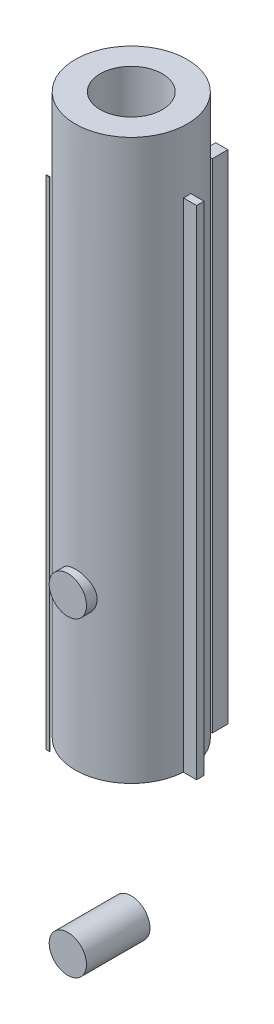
ISO-10303-21;
HEADER;
FILE_DESCRIPTION(('STEP AP214'),'2;1');
FILE_NAME('part.step','',(''),(''),'','','');
FILE_SCHEMA(('AUTOMOTIVE_DESIGN { 1 0 10303 214 1 1 1 1 }'));
ENDSEC;
DATA;
#1=APPLICATION_CONTEXT('core data for automotive mechanical design processes');
#2=APPLICATION_PROTOCOL_DEFINITION('international standard','automotive_design',2000,#1);
#3=PRODUCT_CONTEXT('',#1,'mechanical');
#4=PRODUCT('Part','Part','',(#3));
#5=PRODUCT_RELATED_PRODUCT_CATEGORY('part','',(#4));
#6=PRODUCT_DEFINITION_FORMATION('','',#4);
#7=PRODUCT_DEFINITION_CONTEXT('part definition',#1,'design');
#8=PRODUCT_DEFINITION('design','',#6,#7);
#9=PRODUCT_DEFINITION_SHAPE('','',#8);
#10=(LENGTH_UNIT() NAMED_UNIT(*) SI_UNIT(.MILLI.,.METRE.));
#11=(NAMED_UNIT(*) PLANE_ANGLE_UNIT() SI_UNIT($,.RADIAN.));
#12=(NAMED_UNIT(*) SI_UNIT($,.STERADIAN.) SOLID_ANGLE_UNIT());
#13=UNCERTAINTY_MEASURE_WITH_UNIT(LENGTH_MEASURE(1.E-05),#10,'distance_accuracy_value','');
#14=(GEOMETRIC_REPRESENTATION_CONTEXT(3) GLOBAL_UNCERTAINTY_ASSIGNED_CONTEXT((#13)) GLOBAL_UNIT_ASSIGNED_CONTEXT((#10,
#11,#12)) REPRESENTATION_CONTEXT('',''));
#15=CARTESIAN_POINT('',(0.,0.,0.));
#16=DIRECTION('',(0.,0.,1.));
#17=DIRECTION('',(1.,0.,0.));
#18=AXIS2_PLACEMENT_3D('',#15,#16,#17);
#19=CARTESIAN_POINT('',(0.,-25000.,10200.));
#20=DIRECTION('',(0.,0.,-1.));
#21=DIRECTION('',(-1.,0.,0.));
#22=AXIS2_PLACEMENT_3D('',#19,#20,#21);
#23=CYLINDRICAL_SURFACE('',#22,3000.);
#24=CARTESIAN_POINT('',(0.,-25000.,10200.));
#25=DIRECTION('',(0.,0.,1.));
#26=DIRECTION('',(1.,0.,0.));
#27=AXIS2_PLACEMENT_3D('',#24,#25,#26);
#28=CIRCLE('',#27,3000.);
#29=CARTESIAN_POINT('',(3000.,-25000.,10200.));
#30=VERTEX_POINT('',#29);
#31=EDGE_CURVE('E55',#30,#30,#28,.T.);
#32=ORIENTED_EDGE('',*,*,#31,.F.);
#33=EDGE_LOOP('',(#32));
#34=FACE_BOUND('',#33,.T.);
#35=CARTESIAN_POINT('',(0.,-25000.,0.));
#36=DIRECTION('',(0.,0.,1.));
#37=DIRECTION('',(1.,0.,0.));
#38=AXIS2_PLACEMENT_3D('',#35,#36,#37);
#39=CIRCLE('',#38,3000.);
#40=CARTESIAN_POINT('',(3000.,-25000.,0.));
#41=VERTEX_POINT('',#40);
#42=EDGE_CURVE('E11',#41,#41,#39,.T.);
#43=ORIENTED_EDGE('',*,*,#42,.T.);
#44=EDGE_LOOP('',(#43));
#45=FACE_BOUND('',#44,.T.);
#46=ADVANCED_FACE('F48',(#34,#45),#23,.T.);
#47=CARTESIAN_POINT('',(0.,-25000.,10200.));
#48=DIRECTION('',(0.,0.,1.));
#49=DIRECTION('',(1.,0.,0.));
#50=AXIS2_PLACEMENT_3D('',#47,#48,#49);
#51=PLANE('',#50);
#52=ORIENTED_EDGE('',*,*,#31,.T.);
#53=EDGE_LOOP('',(#52));
#54=FACE_BOUND('',#53,.T.);
#55=ADVANCED_FACE('F49',(#54),#51,.T.);
#56=CARTESIAN_POINT('',(0.,-25000.,0.));
#57=DIRECTION('',(0.,0.,1.));
#58=DIRECTION('',(1.,0.,0.));
#59=AXIS2_PLACEMENT_3D('',#56,#57,#58);
#60=PLANE('',#59);
#61=ORIENTED_EDGE('',*,*,#42,.F.);
#62=EDGE_LOOP('',(#61));
#63=FACE_BOUND('',#62,.T.);
#64=ADVANCED_FACE('F70',(#63),#60,.F.);
#65=CLOSED_SHELL('',(#46,#55,#64));
#66=MANIFOLD_SOLID_BREP('B2',#65);
#67=CARTESIAN_POINT('',(-5204.93392170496,80000.,8394.22863405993));
#68=DIRECTION('',(1.,0.,0.));
#69=DIRECTION('',(0.,0.,-1.));
#70=AXIS2_PLACEMENT_3D('',#67,#68,#69);
#71=PLANE('',#70);
#72=DIRECTION('',(0.,0.,1.));
#73=VECTOR('',#72,1.);
#74=CARTESIAN_POINT('',(-5204.93392170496,0.,8394.22863405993));
#75=LINE('',#74,#73);
#76=CARTESIAN_POINT('',(-5204.93392170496,0.,8394.22863405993));
#77=VERTEX_POINT('',#76);
#78=CARTESIAN_POINT('',(-5204.93392170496,0.,8493.26673973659));
#79=VERTEX_POINT('',#78);
#80=EDGE_CURVE('E46',#77,#79,#75,.T.);
#81=ORIENTED_EDGE('',*,*,#80,.T.);
#82=DIRECTION('',(0.,-1.,0.));
#83=VECTOR('',#82,1.);
#84=CARTESIAN_POINT('',(-5204.93392170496,80000.,8493.26673973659));
#85=LINE('',#84,#83);
#86=CARTESIAN_POINT('',(-5204.93392170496,80000.,8493.26673973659));
#87=VERTEX_POINT('',#86);
#88=EDGE_CURVE('E168',#87,#79,#85,.T.);
#89=ORIENTED_EDGE('',*,*,#88,.F.);
#90=DIRECTION('',(0.,0.,1.));
#91=VECTOR('',#90,1.);
#92=CARTESIAN_POINT('',(-5204.93392170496,80000.,8394.22863405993));
#93=LINE('',#92,#91);
#94=CARTESIAN_POINT('',(-5204.93392170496,80000.,8394.22863405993));
#95=VERTEX_POINT('',#94);
#96=EDGE_CURVE('E103',#95,#87,#93,.T.);
#97=ORIENTED_EDGE('',*,*,#96,.F.);
#98=DIRECTION('',(0.,-1.,0.));
#99=VECTOR('',#98,1.);
#100=CARTESIAN_POINT('',(-5204.93392170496,80000.,8394.22863405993));
#101=LINE('',#100,#99);
#102=EDGE_CURVE('E158',#95,#77,#101,.T.);
#103=ORIENTED_EDGE('',*,*,#102,.T.);
#104=EDGE_LOOP('',(#81,#89,#97,#103));
#105=FACE_BOUND('',#104,.T.);
#106=ADVANCED_FACE('F97',(#105),#71,.F.);
#107=CARTESIAN_POINT('',(-5204.93392170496,80000.,8493.26673973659));
#108=DIRECTION('',(0.,0.,-1.));
#109=DIRECTION('',(-1.,0.,0.));
#110=AXIS2_PLACEMENT_3D('',#107,#108,#109);
#111=PLANE('',#110);
#112=DIRECTION('',(1.,0.,0.));
#113=VECTOR('',#112,1.);
#114=CARTESIAN_POINT('',(-5204.93392170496,0.,8493.26673973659));
#115=LINE('',#114,#113);
#116=CARTESIAN_POINT('',(-4649.99999999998,0.,8493.26673973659));
#117=VERTEX_POINT('',#116);
#118=EDGE_CURVE('E108',#79,#117,#115,.T.);
#119=ORIENTED_EDGE('',*,*,#118,.T.);
#120=DIRECTION('',(0.,-1.,0.));
#121=VECTOR('',#120,1.);
#122=CARTESIAN_POINT('',(-4649.99999999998,80000.,8493.26673973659));
#123=LINE('',#122,#121);
#124=CARTESIAN_POINT('',(-4649.99999999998,80000.,8493.26673973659));
#125=VERTEX_POINT('',#124);
#126=EDGE_CURVE('E152',#125,#117,#123,.T.);
#127=ORIENTED_EDGE('',*,*,#126,.F.);
#128=DIRECTION('',(1.,0.,0.));
#129=VECTOR('',#128,1.);
#130=CARTESIAN_POINT('',(-5204.93392170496,80000.,8493.26673973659));
#131=LINE('',#130,#129);
#132=EDGE_CURVE('E132',#87,#125,#131,.T.);
#133=ORIENTED_EDGE('',*,*,#132,.F.);
#134=ORIENTED_EDGE('',*,*,#88,.T.);
#135=EDGE_LOOP('',(#119,#127,#133,#134));
#136=FACE_BOUND('',#135,.T.);
#137=ADVANCED_FACE('F172',(#136),#111,.F.);
#138=CARTESIAN_POINT('',(-4649.99999999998,80000.,8394.22863405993));
#139=DIRECTION('',(-1.,0.,0.));
#140=DIRECTION('',(0.,0.,1.));
#141=AXIS2_PLACEMENT_3D('',#138,#139,#140);
#142=PLANE('',#141);
#143=DIRECTION('',(0.,0.,-1.));
#144=VECTOR('',#143,1.);
#145=CARTESIAN_POINT('',(-4649.99999999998,0.,8394.22863405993));
#146=LINE('',#145,#144);
#147=CARTESIAN_POINT('',(-4649.99999999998,0.,8394.22863405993));
#148=VERTEX_POINT('',#147);
#149=EDGE_CURVE('E149',#117,#148,#146,.T.);
#150=ORIENTED_EDGE('',*,*,#149,.T.);
#151=DIRECTION('',(0.,-1.,0.));
#152=VECTOR('',#151,1.);
#153=CARTESIAN_POINT('',(-4649.99999999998,80000.,8394.22863405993));
#154=LINE('',#153,#152);
#155=CARTESIAN_POINT('',(-4649.99999999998,80000.,8394.22863405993));
#156=VERTEX_POINT('',#155);
#157=EDGE_CURVE('E155',#156,#148,#154,.T.);
#158=ORIENTED_EDGE('',*,*,#157,.F.);
#159=DIRECTION('',(0.,0.,-1.));
#160=VECTOR('',#159,1.);
#161=CARTESIAN_POINT('',(-4649.99999999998,80000.,8394.22863405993));
#162=LINE('',#161,#160);
#163=EDGE_CURVE('E167',#125,#156,#162,.T.);
#164=ORIENTED_EDGE('',*,*,#163,.F.);
#165=ORIENTED_EDGE('',*,*,#126,.T.);
#166=EDGE_LOOP('',(#150,#158,#164,#165));
#167=FACE_BOUND('',#166,.T.);
#168=ADVANCED_FACE('F147',(#167),#142,.F.);
#169=CARTESIAN_POINT('',(-5204.93392170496,80000.,8394.22863405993));
#170=DIRECTION('',(0.,0.,1.));
#171=DIRECTION('',(1.,0.,0.));
#172=AXIS2_PLACEMENT_3D('',#169,#170,#171);
#173=PLANE('',#172);
#174=DIRECTION('',(-1.,0.,0.));
#175=VECTOR('',#174,1.);
#176=CARTESIAN_POINT('',(-5204.93392170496,0.,8394.22863405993));
#177=LINE('',#176,#175);
#178=EDGE_CURVE('E141',#148,#77,#177,.T.);
#179=ORIENTED_EDGE('',*,*,#178,.T.);
#180=ORIENTED_EDGE('',*,*,#102,.F.);
#181=DIRECTION('',(-1.,0.,0.));
#182=VECTOR('',#181,1.);
#183=CARTESIAN_POINT('',(-5204.93392170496,80000.,8394.22863405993));
#184=LINE('',#183,#182);
#185=EDGE_CURVE('E160',#156,#95,#184,.T.);
#186=ORIENTED_EDGE('',*,*,#185,.F.);
#187=ORIENTED_EDGE('',*,*,#157,.T.);
#188=EDGE_LOOP('',(#179,#180,#186,#187));
#189=FACE_BOUND('',#188,.T.);
#190=ADVANCED_FACE('F156',(#189),#173,.F.);
#191=CARTESIAN_POINT('',(0.,80000.,0.));
#192=DIRECTION('',(0.,1.,0.));
#193=DIRECTION('',(0.,0.,1.));
#194=AXIS2_PLACEMENT_3D('',#191,#192,#193);
#195=PLANE('',#194);
#196=ORIENTED_EDGE('',*,*,#96,.T.);
#197=ORIENTED_EDGE('',*,*,#132,.T.);
#198=ORIENTED_EDGE('',*,*,#163,.T.);
#199=ORIENTED_EDGE('',*,*,#185,.T.);
#200=EDGE_LOOP('',(#196,#197,#198,#199));
#201=FACE_BOUND('',#200,.T.);
#202=ADVANCED_FACE('F101',(#201),#195,.T.);
#203=CARTESIAN_POINT('',(0.,0.,0.));
#204=DIRECTION('',(0.,1.,0.));
#205=DIRECTION('',(0.,0.,1.));
#206=AXIS2_PLACEMENT_3D('',#203,#204,#205);
#207=PLANE('',#206);
#208=ORIENTED_EDGE('',*,*,#80,.F.);
#209=ORIENTED_EDGE('',*,*,#178,.F.);
#210=ORIENTED_EDGE('',*,*,#149,.F.);
#211=ORIENTED_EDGE('',*,*,#118,.F.);
#212=EDGE_LOOP('',(#208,#209,#210,#211));
#213=FACE_BOUND('',#212,.T.);
#214=ADVANCED_FACE('F159',(#213),#207,.F.);
#215=CLOSED_SHELL('',(#106,#137,#168,#190,#202,#214));
#216=MANIFOLD_SOLID_BREP('B6',#215);
#217=CARTESIAN_POINT('',(-9600.,80000.,600.));
#218=DIRECTION('',(-1.,0.,0.));
#219=DIRECTION('',(0.,0.,1.));
#220=AXIS2_PLACEMENT_3D('',#217,#218,#219);
#221=PLANE('',#220);
#222=DIRECTION('',(0.,0.,-1.));
#223=VECTOR('',#222,1.);
#224=CARTESIAN_POINT('',(-9600.,0.,600.));
#225=LINE('',#224,#223);
#226=CARTESIAN_POINT('',(-9600.,0.,600.));
#227=VERTEX_POINT('',#226);
#228=CARTESIAN_POINT('',(-9600.,0.,-600.));
#229=VERTEX_POINT('',#228);
#230=EDGE_CURVE('E100',#227,#229,#225,.T.);
#231=ORIENTED_EDGE('',*,*,#230,.T.);
#232=DIRECTION('',(0.,-1.,0.));
#233=VECTOR('',#232,1.);
#234=CARTESIAN_POINT('',(-9600.,80000.,-600.));
#235=LINE('',#234,#233);
#236=CARTESIAN_POINT('',(-9600.,80000.,-600.));
#237=VERTEX_POINT('',#236);
#238=EDGE_CURVE('E302',#237,#229,#235,.T.);
#239=ORIENTED_EDGE('',*,*,#238,.F.);
#240=DIRECTION('',(0.,0.,-1.));
#241=VECTOR('',#240,1.);
#242=CARTESIAN_POINT('',(-9600.,80000.,600.));
#243=LINE('',#242,#241);
#244=CARTESIAN_POINT('',(-9600.,80000.,600.));
#245=VERTEX_POINT('',#244);
#246=EDGE_CURVE('E237',#245,#237,#243,.T.);
#247=ORIENTED_EDGE('',*,*,#246,.F.);
#248=DIRECTION('',(0.,-1.,0.));
#249=VECTOR('',#248,1.);
#250=CARTESIAN_POINT('',(-9600.,80000.,600.));
#251=LINE('',#250,#249);
#252=EDGE_CURVE('E292',#245,#227,#251,.T.);
#253=ORIENTED_EDGE('',*,*,#252,.T.);
#254=EDGE_LOOP('',(#231,#239,#247,#253));
#255=FACE_BOUND('',#254,.T.);
#256=ADVANCED_FACE('F235',(#255),#221,.F.);
#257=CARTESIAN_POINT('',(-9600.,80000.,-600.));
#258=DIRECTION('',(0.,0.,1.));
#259=DIRECTION('',(1.,0.,0.));
#260=AXIS2_PLACEMENT_3D('',#257,#258,#259);
#261=PLANE('',#260);
#262=DIRECTION('',(-1.,0.,0.));
#263=VECTOR('',#262,1.);
#264=CARTESIAN_POINT('',(-9600.,0.,-600.));
#265=LINE('',#264,#263);
#266=CARTESIAN_POINT('',(-9900.,0.,-600.));
#267=VERTEX_POINT('',#266);
#268=EDGE_CURVE('E245',#229,#267,#265,.T.);
#269=ORIENTED_EDGE('',*,*,#268,.T.);
#270=DIRECTION('',(0.,-1.,0.));
#271=VECTOR('',#270,1.);
#272=CARTESIAN_POINT('',(-9900.,80000.,-600.));
#273=LINE('',#272,#271);
#274=CARTESIAN_POINT('',(-9900.,80000.,-600.));
#275=VERTEX_POINT('',#274);
#276=EDGE_CURVE('E290',#275,#267,#273,.T.);
#277=ORIENTED_EDGE('',*,*,#276,.F.);
#278=DIRECTION('',(-1.,0.,0.));
#279=VECTOR('',#278,1.);
#280=CARTESIAN_POINT('',(-9600.,80000.,-600.));
#281=LINE('',#280,#279);
#282=EDGE_CURVE('E266',#237,#275,#281,.T.);
#283=ORIENTED_EDGE('',*,*,#282,.F.);
#284=ORIENTED_EDGE('',*,*,#238,.T.);
#285=EDGE_LOOP('',(#269,#277,#283,#284));
#286=FACE_BOUND('',#285,.T.);
#287=ADVANCED_FACE('F308',(#286),#261,.F.);
#288=CARTESIAN_POINT('',(-9900.,80000.,600.));
#289=DIRECTION('',(1.,0.,0.));
#290=DIRECTION('',(0.,0.,-1.));
#291=AXIS2_PLACEMENT_3D('',#288,#289,#290);
#292=PLANE('',#291);
#293=DIRECTION('',(0.,0.,1.));
#294=VECTOR('',#293,1.);
#295=CARTESIAN_POINT('',(-9900.,0.,600.));
#296=LINE('',#295,#294);
#297=CARTESIAN_POINT('',(-9900.,0.,600.));
#298=VERTEX_POINT('',#297);
#299=EDGE_CURVE('E285',#267,#298,#296,.T.);
#300=ORIENTED_EDGE('',*,*,#299,.T.);
#301=DIRECTION('',(0.,-1.,0.));
#302=VECTOR('',#301,1.);
#303=CARTESIAN_POINT('',(-9900.,80000.,600.));
#304=LINE('',#303,#302);
#305=CARTESIAN_POINT('',(-9900.,80000.,600.));
#306=VERTEX_POINT('',#305);
#307=EDGE_CURVE('E284',#306,#298,#304,.T.);
#308=ORIENTED_EDGE('',*,*,#307,.F.);
#309=DIRECTION('',(0.,0.,1.));
#310=VECTOR('',#309,1.);
#311=CARTESIAN_POINT('',(-9900.,80000.,600.));
#312=LINE('',#311,#310);
#313=EDGE_CURVE('E298',#275,#306,#312,.T.);
#314=ORIENTED_EDGE('',*,*,#313,.F.);
#315=ORIENTED_EDGE('',*,*,#276,.T.);
#316=EDGE_LOOP('',(#300,#308,#314,#315));
#317=FACE_BOUND('',#316,.T.);
#318=ADVANCED_FACE('F282',(#317),#292,.F.);
#319=CARTESIAN_POINT('',(-9600.,80000.,600.));
#320=DIRECTION('',(0.,0.,-1.));
#321=DIRECTION('',(-1.,0.,0.));
#322=AXIS2_PLACEMENT_3D('',#319,#320,#321);
#323=PLANE('',#322);
#324=DIRECTION('',(1.,0.,0.));
#325=VECTOR('',#324,1.);
#326=CARTESIAN_POINT('',(-9600.,0.,600.));
#327=LINE('',#326,#325);
#328=EDGE_CURVE('E277',#298,#227,#327,.T.);
#329=ORIENTED_EDGE('',*,*,#328,.T.);
#330=ORIENTED_EDGE('',*,*,#252,.F.);
#331=DIRECTION('',(1.,0.,0.));
#332=VECTOR('',#331,1.);
#333=CARTESIAN_POINT('',(-9600.,80000.,600.));
#334=LINE('',#333,#332);
#335=EDGE_CURVE('E289',#306,#245,#334,.T.);
#336=ORIENTED_EDGE('',*,*,#335,.F.);
#337=ORIENTED_EDGE('',*,*,#307,.T.);
#338=EDGE_LOOP('',(#329,#330,#336,#337));
#339=FACE_BOUND('',#338,.T.);
#340=ADVANCED_FACE('F288',(#339),#323,.F.);
#341=CARTESIAN_POINT('',(0.,80000.,0.));
#342=DIRECTION('',(0.,1.,0.));
#343=DIRECTION('',(0.,0.,1.));
#344=AXIS2_PLACEMENT_3D('',#341,#342,#343);
#345=PLANE('',#344);
#346=ORIENTED_EDGE('',*,*,#246,.T.);
#347=ORIENTED_EDGE('',*,*,#282,.T.);
#348=ORIENTED_EDGE('',*,*,#313,.T.);
#349=ORIENTED_EDGE('',*,*,#335,.T.);
#350=EDGE_LOOP('',(#346,#347,#348,#349));
#351=FACE_BOUND('',#350,.T.);
#352=ADVANCED_FACE('F233',(#351),#345,.T.);
#353=CARTESIAN_POINT('',(0.,0.,0.));
#354=DIRECTION('',(0.,1.,0.));
#355=DIRECTION('',(0.,0.,1.));
#356=AXIS2_PLACEMENT_3D('',#353,#354,#355);
#357=PLANE('',#356);
#358=ORIENTED_EDGE('',*,*,#230,.F.);
#359=ORIENTED_EDGE('',*,*,#328,.F.);
#360=ORIENTED_EDGE('',*,*,#299,.F.);
#361=ORIENTED_EDGE('',*,*,#268,.F.);
#362=EDGE_LOOP('',(#358,#359,#360,#361));
#363=FACE_BOUND('',#362,.T.);
#364=ADVANCED_FACE('F291',(#363),#357,.F.);
#365=CLOSED_SHELL('',(#256,#287,#318,#340,#352,#364));
#366=MANIFOLD_SOLID_BREP('B37',#365);
#367=CARTESIAN_POINT('',(0.,90000.,0.));
#368=DIRECTION('',(0.,-1.,0.));
#369=DIRECTION('',(0.,0.,-1.));
#370=AXIS2_PLACEMENT_3D('',#367,#368,#369);
#371=CYLINDRICAL_SURFACE('',#370,9000.);
#372=CARTESIAN_POINT('',(0.,90000.,0.));
#373=DIRECTION('',(0.,1.,0.));
#374=DIRECTION('',(0.,0.,1.));
#375=AXIS2_PLACEMENT_3D('',#372,#373,#374);
#376=CIRCLE('',#375,9000.);
#377=CARTESIAN_POINT('',(0.,90000.,9000.));
#378=VERTEX_POINT('',#377);
#379=EDGE_CURVE('E549',#378,#378,#376,.T.);
#380=ORIENTED_EDGE('',*,*,#379,.F.);
#381=EDGE_LOOP('',(#380));
#382=FACE_BOUND('',#381,.T.);
#383=DIRECTION('',(0.,-1.,0.));
#384=VECTOR('',#383,1.);
#385=CARTESIAN_POINT('',(-5204.93392170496,80000.,-7342.25189370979));
#386=LINE('',#385,#384);
#387=CARTESIAN_POINT('',(-5204.93392170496,80000.,-7342.25189370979));
#388=VERTEX_POINT('',#387);
#389=CARTESIAN_POINT('',(-5204.93392170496,0.,-7342.25189370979));
#390=VERTEX_POINT('',#389);
#391=EDGE_CURVE('E385',#388,#390,#386,.T.);
#392=ORIENTED_EDGE('',*,*,#391,.T.);
#393=CARTESIAN_POINT('',(0.,0.,0.));
#394=DIRECTION('',(0.,1.,0.));
#395=DIRECTION('',(0.,0.,1.));
#396=AXIS2_PLACEMENT_3D('',#393,#394,#395);
#397=CIRCLE('',#396,9000.);
#398=CARTESIAN_POINT('',(8979.97772825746,0.,600.));
#399=VERTEX_POINT('',#398);
#400=EDGE_CURVE('E477',#390,#399,#397,.T.);
#401=ORIENTED_EDGE('',*,*,#400,.T.);
#402=DIRECTION('',(0.,-1.,0.));
#403=VECTOR('',#402,1.);
#404=CARTESIAN_POINT('',(8979.97772825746,90000.,600.));
#405=LINE('',#404,#403);
#406=CARTESIAN_POINT('',(8979.97772825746,80000.,600.));
#407=VERTEX_POINT('',#406);
#408=EDGE_CURVE('E565',#407,#399,#405,.T.);
#409=ORIENTED_EDGE('',*,*,#408,.F.);
#410=CARTESIAN_POINT('',(0.,80000.,0.));
#411=DIRECTION('',(0.,-1.,0.));
#412=DIRECTION('',(0.,0.,-1.));
#413=AXIS2_PLACEMENT_3D('',#410,#411,#412);
#414=CIRCLE('',#413,9000.);
#415=CARTESIAN_POINT('',(8979.97772825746,80000.,-600.));
#416=VERTEX_POINT('',#415);
#417=EDGE_CURVE('E554',#416,#407,#414,.T.);
#418=ORIENTED_EDGE('',*,*,#417,.F.);
#419=DIRECTION('',(0.,-1.,0.));
#420=VECTOR('',#419,1.);
#421=CARTESIAN_POINT('',(8979.97772825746,90000.,-600.));
#422=LINE('',#421,#420);
#423=CARTESIAN_POINT('',(8979.97772825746,0.,-600.));
#424=VERTEX_POINT('',#423);
#425=EDGE_CURVE('E558',#424,#416,#422,.F.);
#426=ORIENTED_EDGE('',*,*,#425,.F.);
#427=CARTESIAN_POINT('',(5407.68659972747,0.,-7194.22863405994));
#428=VERTEX_POINT('',#427);
#429=EDGE_CURVE('E551',#424,#428,#397,.T.);
#430=ORIENTED_EDGE('',*,*,#429,.T.);
#431=DIRECTION('',(0.,-1.,0.));
#432=VECTOR('',#431,1.);
#433=CARTESIAN_POINT('',(5407.68659972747,90000.,-7194.22863405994));
#434=LINE('',#433,#432);
#435=CARTESIAN_POINT('',(5407.68659972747,80000.,-7194.22863405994));
#436=VERTEX_POINT('',#435);
#437=EDGE_CURVE('E512',#436,#428,#434,.T.);
#438=ORIENTED_EDGE('',*,*,#437,.F.);
#439=CARTESIAN_POINT('',(0.,80000.,0.));
#440=DIRECTION('',(0.,-1.,0.));
#441=DIRECTION('',(0.,0.,-1.));
#442=AXIS2_PLACEMENT_3D('',#439,#440,#441);
#443=CIRCLE('',#442,9000.);
#444=CARTESIAN_POINT('',(3900.00000000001,80000.,-8111.10350075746));
#445=VERTEX_POINT('',#444);
#446=EDGE_CURVE('E564',#445,#436,#443,.T.);
#447=ORIENTED_EDGE('',*,*,#446,.F.);
#448=DIRECTION('',(0.,-1.,0.));
#449=VECTOR('',#448,1.);
#450=CARTESIAN_POINT('',(3900.00000000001,90000.,-8111.10350075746));
#451=LINE('',#450,#449);
#452=CARTESIAN_POINT('',(3900.00000000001,0.,-8111.10350075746));
#453=VERTEX_POINT('',#452);
#454=EDGE_CURVE('E521',#453,#445,#451,.F.);
#455=ORIENTED_EDGE('',*,*,#454,.F.);
#456=CARTESIAN_POINT('',(-4649.99999999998,0.,-7705.6797234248));
#457=VERTEX_POINT('',#456);
#458=EDGE_CURVE('E556',#453,#457,#397,.T.);
#459=ORIENTED_EDGE('',*,*,#458,.T.);
#460=DIRECTION('',(0.,-1.,0.));
#461=VECTOR('',#460,1.);
#462=CARTESIAN_POINT('',(-4649.99999999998,90000.,-7705.6797234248));
#463=LINE('',#462,#461);
#464=CARTESIAN_POINT('',(-4649.99999999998,80000.,-7705.6797234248));
#465=VERTEX_POINT('',#464);
#466=EDGE_CURVE('E481',#465,#457,#463,.T.);
#467=ORIENTED_EDGE('',*,*,#466,.F.);
#468=CARTESIAN_POINT('',(0.,80000.,0.));
#469=DIRECTION('',(0.,-1.,0.));
#470=DIRECTION('',(0.,0.,-1.));
#471=AXIS2_PLACEMENT_3D('',#468,#469,#470);
#472=CIRCLE('',#471,9000.);
#473=EDGE_CURVE('E367',#388,#465,#472,.T.);
#474=ORIENTED_EDGE('',*,*,#473,.F.);
#475=EDGE_LOOP('',(#392,#401,#409,#418,#426,#430,#438,#447,#455,#459,#467,#474));
#476=FACE_BOUND('',#475,.T.);
#477=CARTESIAN_POINT('',(-3000.,25000.,8485.28137423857));
#478=CARTESIAN_POINT('',(-3000.0000001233,24979.574383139,8485.28137413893));
#479=CARTESIAN_POINT('',(-2999.7913863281,24959.148773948,8485.35513894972));
#480=CARTESIAN_POINT('',(-2998.95706222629,24918.3071484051,8485.65004786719));
#481=CARTESIAN_POINT('',(-2998.33135214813,24897.8911320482,8485.87119189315));
#482=CARTESIAN_POINT('',(-2996.66322834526,24857.0782987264,8486.46040927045));
#483=CARTESIAN_POINT('',(-2995.62081550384,24836.681481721,8486.82848231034));
#484=CARTESIAN_POINT('',(-2993.11993554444,24795.9165357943,8487.71081089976));
#485=CARTESIAN_POINT('',(-2991.66146836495,24775.5484068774,8488.22506647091));
#486=CARTESIAN_POINT('',(-2988.32939974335,24734.8505133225,8489.39871359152));
#487=CARTESIAN_POINT('',(-2986.45580207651,24714.5207483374,8490.0581038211));
#488=CARTESIAN_POINT('',(-2982.29462059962,24673.9088208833,8491.52069179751));
#489=CARTESIAN_POINT('',(-2980.00703680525,24653.6266584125,8492.3238895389));
#490=CARTESIAN_POINT('',(-2975.01928321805,24613.1192738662,8494.07247719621));
#491=CARTESIAN_POINT('',(-2972.31911330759,24592.8940518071,8495.01786715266));
#492=CARTESIAN_POINT('',(-2966.50782744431,24552.5098050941,8497.04894556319));
#493=CARTESIAN_POINT('',(-2963.39671148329,24532.3507804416,8498.13463402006));
#494=CARTESIAN_POINT('',(-2956.76498549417,24492.1055344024,8500.44429133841));
#495=CARTESIAN_POINT('',(-2953.24432382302,24472.0193225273,8501.66827763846));
#496=CARTESIAN_POINT('',(-2945.79591552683,24431.931292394,8504.25199309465));
#497=CARTESIAN_POINT('',(-2941.86816889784,24411.9294741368,8505.6117222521));
#498=CARTESIAN_POINT('',(-2933.60790007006,24372.0191441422,8508.46424334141));
#499=CARTESIAN_POINT('',(-2929.2753780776,24352.1106323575,8509.95703520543));
#500=CARTESIAN_POINT('',(-2920.20806765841,24312.3956693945,8513.07276028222));
#501=CARTESIAN_POINT('',(-2915.47327923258,24292.589218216,8514.69569349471));
#502=CARTESIAN_POINT('',(-2905.60412863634,24253.086948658,8518.06855108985));
#503=CARTESIAN_POINT('',(-2900.46976554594,24233.3911305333,8519.81847576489));
#504=CARTESIAN_POINT('',(-2889.80436160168,24194.1186365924,8523.44193803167));
#505=CARTESIAN_POINT('',(-2884.27332073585,24174.5419607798,8525.31547562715));
#506=CARTESIAN_POINT('',(-2872.81762461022,24135.5160736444,8529.18257758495));
#507=CARTESIAN_POINT('',(-2866.89296968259,24116.0668622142,8531.17614184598));
#508=CARTESIAN_POINT('',(-2854.65326050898,24077.3040292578,8535.2795164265));
#509=CARTESIAN_POINT('',(-2848.33820629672,24057.99040772,8537.38932673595));
#510=CARTESIAN_POINT('',(-2835.33419126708,24019.5455278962,8541.71685823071));
#511=CARTESIAN_POINT('',(-2828.64601003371,24000.4139804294,8543.93435325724));
#512=CARTESIAN_POINT('',(-2814.88766297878,23962.3016305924,8548.47705302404));
#513=CARTESIAN_POINT('',(-2807.81749719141,23943.3208282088,8550.80225775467));
#514=CARTESIAN_POINT('',(-2793.29880267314,23905.517579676,8555.55609799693));
#515=CARTESIAN_POINT('',(-2785.85027435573,23886.6951333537,8557.98473339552));
#516=CARTESIAN_POINT('',(-2770.57857884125,23849.2159992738,8562.94101258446));
#517=CARTESIAN_POINT('',(-2762.75541163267,23830.5593115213,8565.46865637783));
#518=CARTESIAN_POINT('',(-2746.73844892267,23793.4193500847,8570.61833571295));
#519=CARTESIAN_POINT('',(-2738.54466133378,23774.9360727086,8573.24036923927));
#520=CARTESIAN_POINT('',(-2721.79005174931,23738.1492079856,8578.57425257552));
#521=CARTESIAN_POINT('',(-2713.22922146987,23719.8456247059,8581.28610441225));
#522=CARTESIAN_POINT('',(-2695.74483412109,23683.4257283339,8586.79473375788));
#523=CARTESIAN_POINT('',(-2686.82128144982,23665.3094129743,8589.59151023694));
#524=CARTESIAN_POINT('',(-2668.61544982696,23629.2705794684,8595.26512045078));
#525=CARTESIAN_POINT('',(-2659.33317031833,23611.348061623,8598.14195430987));
#526=CARTESIAN_POINT('',(-2640.41257766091,23575.7006400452,8603.97114282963));
#527=CARTESIAN_POINT('',(-2630.77420798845,23557.9757682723,8606.92350945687));
#528=CARTESIAN_POINT('',(-2611.14707411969,23522.7330040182,8612.89824549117));
#529=CARTESIAN_POINT('',(-2601.15830936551,23505.2151118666,8615.92061500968));
#530=CARTESIAN_POINT('',(-2580.83485587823,23470.3929103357,8622.03015749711));
#531=CARTESIAN_POINT('',(-2570.50017163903,23453.0885981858,8625.11732962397));
#532=CARTESIAN_POINT('',(-2549.48892700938,23418.6991919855,8631.35135981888));
#533=CARTESIAN_POINT('',(-2538.81235969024,23401.6141023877,8634.49821909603));
#534=CARTESIAN_POINT('',(-2517.12199079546,23367.6695925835,8640.84628813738));
#535=CARTESIAN_POINT('',(-2506.10818930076,23350.8101723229,8644.04749788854));
#536=CARTESIAN_POINT('',(-2483.74760817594,23317.3226153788,8650.49901598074));
#537=CARTESIAN_POINT('',(-2472.40082153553,23300.6944835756,8653.74932535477));
#538=CARTESIAN_POINT('',(-2449.37910410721,23267.675821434,8660.29359833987));
#539=CARTESIAN_POINT('',(-2437.70417530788,23251.2852896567,8663.58756168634));
#540=CARTESIAN_POINT('',(-2414.03068666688,23218.7474542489,8670.21377642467));
#541=CARTESIAN_POINT('',(-2402.03212615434,23202.6001511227,8673.54602789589));
#542=CARTESIAN_POINT('',(-2377.28393399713,23169.9849969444,8680.36241366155));
#543=CARTESIAN_POINT('',(-2364.5227643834,23153.5261476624,8683.84773708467));
#544=CARTESIAN_POINT('',(-2338.66355961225,23120.8814965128,8690.84760993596));
#545=CARTESIAN_POINT('',(-2325.56552339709,23104.6956955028,8694.36215945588));
#546=CARTESIAN_POINT('',(-2299.03797062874,23072.6033584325,8701.41441197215));
#547=CARTESIAN_POINT('',(-2285.60845616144,23056.696820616,8704.9521148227));
#548=CARTESIAN_POINT('',(-2258.42291249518,23025.1685568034,8712.04472506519));
#549=CARTESIAN_POINT('',(-2244.6668763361,23009.5468368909,8715.59963282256));
#550=CARTESIAN_POINT('',(-2216.83405930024,22978.5945662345,8722.72050993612));
#551=CARTESIAN_POINT('',(-2202.75728068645,22963.2640134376,8726.28647921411));
#552=CARTESIAN_POINT('',(-2174.28795617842,22932.899367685,8733.42356976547));
#553=CARTESIAN_POINT('',(-2159.89540158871,22917.8652829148,8736.99469117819));
#554=CARTESIAN_POINT('',(-2130.80045425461,22888.0997777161,8744.13596655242));
#555=CARTESIAN_POINT('',(-2116.09806190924,22873.368356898,8747.70612051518));
#556=CARTESIAN_POINT('',(-2086.38944265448,22844.2142447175,8754.83937361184));
#557=CARTESIAN_POINT('',(-2071.38322413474,22829.7915448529,8758.40247293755));
#558=CARTESIAN_POINT('',(-2041.06950449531,22801.2574878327,8765.516396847));
#559=CARTESIAN_POINT('',(-2025.76194923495,22787.1461876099,8769.06721908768));
#560=CARTESIAN_POINT('',(-1994.85433253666,22759.2435112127,8776.14992732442));
#561=CARTESIAN_POINT('',(-1979.25427776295,22745.4521277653,8779.68181374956));
#562=CARTESIAN_POINT('',(-1947.76685518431,22718.194157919,8786.72092048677));
#563=CARTESIAN_POINT('',(-1931.87948105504,22704.7275786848,8790.22814025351));
#564=CARTESIAN_POINT('',(-1899.82409604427,22678.1252829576,8797.2119150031));
#565=CARTESIAN_POINT('',(-1883.65609150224,22664.989559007,8800.68847067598));
#566=CARTESIAN_POINT('',(-1851.04463869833,22639.053620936,8807.60532673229));
#567=CARTESIAN_POINT('',(-1834.60118123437,22626.2534180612,8811.04562589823));
#568=CARTESIAN_POINT('',(-1801.44593159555,22600.9946092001,8817.88404646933));
#569=CARTESIAN_POINT('',(-1784.73414552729,22588.5359954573,8821.28216883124));
#570=CARTESIAN_POINT('',(-1751.04774550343,22563.9650185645,8828.03074751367));
#571=CARTESIAN_POINT('',(-1734.07312450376,22551.8526647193,8831.38120255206));
#572=CARTESIAN_POINT('',(-1699.86831409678,22527.9800417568,8838.02869693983));
#573=CARTESIAN_POINT('',(-1682.63812999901,22516.21976534,8841.32573739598));
#574=CARTESIAN_POINT('',(-1647.47397625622,22492.7529197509,8847.94653631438));
#575=CARTESIAN_POINT('',(-1629.5333918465,22481.0558200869,8851.26873382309));
#576=CARTESIAN_POINT('',(-1593.3969349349,22458.0430636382,8857.84530693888));
#577=CARTESIAN_POINT('',(-1575.20106212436,22446.7274073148,8861.09968246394));
#578=CARTESIAN_POINT('',(-1538.56138449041,22424.4829278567,8867.53487934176));
#579=CARTESIAN_POINT('',(-1520.11757825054,22413.5541069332,8870.715700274));
#580=CARTESIAN_POINT('',(-1482.9897923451,22392.0887508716,8876.99812772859));
#581=CARTESIAN_POINT('',(-1464.30581306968,22381.5522150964,8880.09973437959));
#582=CARTESIAN_POINT('',(-1426.70491714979,22360.8763914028,8886.21831291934));
#583=CARTESIAN_POINT('',(-1407.78799384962,22350.7371148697,8889.23528238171));
#584=CARTESIAN_POINT('',(-1369.72972549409,22330.861309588,8895.17911109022));
#585=CARTESIAN_POINT('',(-1350.58838041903,22321.1247808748,8898.10597032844));
#586=CARTESIAN_POINT('',(-1312.08947716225,22302.0595605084,8903.86433148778));
#587=CARTESIAN_POINT('',(-1292.73191924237,22292.7308683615,8906.69583352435));
#588=CARTESIAN_POINT('',(-1253.80894810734,22274.4862709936,8912.25838974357));
#589=CARTESIAN_POINT('',(-1234.24353490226,22265.5703657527,8914.98944393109));
#590=CARTESIAN_POINT('',(-1194.91739318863,22248.1579324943,8920.3456296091));
#591=CARTESIAN_POINT('',(-1175.15670482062,22239.6613203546,8922.97078232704));
#592=CARTESIAN_POINT('',(-1135.44490578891,22223.090247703,8928.11098313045));
#593=CARTESIAN_POINT('',(-1115.49379512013,22215.0157872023,8930.62603121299));
#594=CARTESIAN_POINT('',(-1075.41007002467,22199.293543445,8935.54144403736));
#595=CARTESIAN_POINT('',(-1055.27745505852,22191.6457614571,8937.9418084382));
#596=CARTESIAN_POINT('',(-1014.83996226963,22176.7812896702,8942.62344768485));
#597=CARTESIAN_POINT('',(-994.535084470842,22169.5645998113,8944.90472254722));
#598=CARTESIAN_POINT('',(-953.763116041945,22155.5667566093,8949.34390995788));
#599=CARTESIAN_POINT('',(-933.296030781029,22148.7855889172,8951.50182657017));
#600=CARTESIAN_POINT('',(-892.208551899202,22135.6625550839,8955.69038825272));
#601=CARTESIAN_POINT('',(-871.588158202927,22129.3206891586,8957.7210332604));
#602=CARTESIAN_POINT('',(-830.203979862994,22117.0801313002,8961.65126374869));
#603=CARTESIAN_POINT('',(-809.44019613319,22111.1814365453,8963.55085006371));
#604=CARTESIAN_POINT('',(-767.77908710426,22099.8307993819,8967.21542839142));
#605=CARTESIAN_POINT('',(-746.881762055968,22094.3788561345,8968.98042065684));
#606=CARTESIAN_POINT('',(-705.693019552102,22084.1069878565,8972.31348582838));
#607=CARTESIAN_POINT('',(-685.405820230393,22079.2716722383,8973.88627372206));
#608=CARTESIAN_POINT('',(-644.725728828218,22070.0232367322,8976.90061884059));
#609=CARTESIAN_POINT('',(-624.332836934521,22065.6101160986,8978.34217629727));
#610=CARTESIAN_POINT('',(-583.450867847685,22057.208712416,8981.09151528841));
#611=CARTESIAN_POINT('',(-562.961791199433,22053.2204269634,8982.39929757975));
#612=CARTESIAN_POINT('',(-521.896866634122,22045.671059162,8984.87878488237));
#613=CARTESIAN_POINT('',(-501.321018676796,22042.1099770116,8986.05048983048));
#614=CARTESIAN_POINT('',(-460.092522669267,22035.4172284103,8988.25572772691));
#615=CARTESIAN_POINT('',(-439.439875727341,22032.2855557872,8989.28926266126));
#616=CARTESIAN_POINT('',(-398.067263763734,22026.4534845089,8991.21634177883));
#617=CARTESIAN_POINT('',(-377.347298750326,22023.7530858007,8992.10988597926));
#618=CARTESIAN_POINT('',(-335.849887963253,22018.7852254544,8993.75539131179));
#619=CARTESIAN_POINT('',(-315.072442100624,22016.5177644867,8994.50735222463));
#620=CARTESIAN_POINT('',(-273.470057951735,22012.4171943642,8995.86834495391));
#621=CARTESIAN_POINT('',(-252.645119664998,22010.5840852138,8996.47737676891));
#622=CARTESIAN_POINT('',(-210.962388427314,22007.3537219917,8997.55130161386));
#623=CARTESIAN_POINT('',(-190.104603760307,22005.9563716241,8998.01622648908));
#624=CARTESIAN_POINT('',(-148.361663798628,22003.5978531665,8998.80128621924));
#625=CARTESIAN_POINT('',(-127.476508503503,22002.6366850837,8999.12142107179));
#626=CARTESIAN_POINT('',(-85.6889118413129,22001.1511352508,8999.6163264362));
#627=CARTESIAN_POINT('',(-64.7864704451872,22000.6267542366,8999.79109670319));
#628=CARTESIAN_POINT('',(-22.9744851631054,22000.0151122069,8999.99495798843));
#629=CARTESIAN_POINT('',(-2.06494127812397,21999.9278511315,9000.02404902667));
#630=CARTESIAN_POINT('',(39.7506671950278,22000.1905011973,8999.93650054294));
#631=CARTESIAN_POINT('',(60.656731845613,22000.5404033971,8999.81986400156));
#632=CARTESIAN_POINT('',(102.455670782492,22001.677144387,8999.44107482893));
#633=CARTESIAN_POINT('',(123.348545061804,22002.4639834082,8999.17892212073));
#634=CARTESIAN_POINT('',(165.110807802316,22004.4740945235,8998.50957395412));
#635=CARTESIAN_POINT('',(185.980196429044,22005.697363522,8998.10237952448));
#636=CARTESIAN_POINT('',(227.685518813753,22008.5795660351,8997.14367814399));
#637=CARTESIAN_POINT('',(248.521452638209,22010.2384986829,8996.59217148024));
#638=CARTESIAN_POINT('',(289.331869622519,22013.9172531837,8995.37032494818));
#639=CARTESIAN_POINT('',(309.308029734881,22015.9203316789,8994.70550642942));
#640=CARTESIAN_POINT('',(349.211353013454,22020.3264689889,8993.24468870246));
#641=CARTESIAN_POINT('',(369.138516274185,22022.7295270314,8992.44868974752));
#642=CARTESIAN_POINT('',(408.934938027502,22027.9342327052,8990.72682793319));
#643=CARTESIAN_POINT('',(428.804196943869,22030.7358774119,8989.80096602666));
#644=CARTESIAN_POINT('',(468.476267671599,22036.7361818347,8987.82089471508));
#645=CARTESIAN_POINT('',(488.279079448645,22039.9348417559,8986.76668524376));
#646=CARTESIAN_POINT('',(527.808992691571,22046.7272658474,8984.53168270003));
#647=CARTESIAN_POINT('',(547.536096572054,22050.3210173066,8983.35089370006));
#648=CARTESIAN_POINT('',(586.906715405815,22057.9017036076,8980.86463346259));
#649=CARTESIAN_POINT('',(606.550230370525,22061.8886383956,8979.55916224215));
#650=CARTESIAN_POINT('',(645.745300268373,22070.2534983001,8976.82566054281));
#651=CARTESIAN_POINT('',(665.296855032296,22074.6314241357,8975.39762983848));
#652=CARTESIAN_POINT('',(704.299674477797,22083.7758695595,8972.42132808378));
#653=CARTESIAN_POINT('',(723.750939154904,22088.5423891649,8970.87305702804));
#654=CARTESIAN_POINT('',(762.545616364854,22098.4616062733,8967.65872651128));
#655=CARTESIAN_POINT('',(781.889025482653,22103.6143159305,8965.99266334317));
#656=CARTESIAN_POINT('',(820.459330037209,22114.3030361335,8962.54547415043));
#657=CARTESIAN_POINT('',(839.68622547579,22119.8390466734,8960.7643481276));
#658=CARTESIAN_POINT('',(878.015563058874,22131.2914500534,8957.08989186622));
#659=CARTESIAN_POINT('',(897.118005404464,22137.2078422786,8955.19656180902));
#660=CARTESIAN_POINT('',(935.19069945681,22149.417952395,8951.30071739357));
#661=CARTESIAN_POINT('',(954.160951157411,22155.7116703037,8949.29820303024));
#662=CARTESIAN_POINT('',(991.96193441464,22168.6733221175,8945.18714062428));
#663=CARTESIAN_POINT('',(1010.79266376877,22175.3412619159,8943.07859091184));
#664=CARTESIAN_POINT('',(1048.30681629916,22189.047916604,8938.75882393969));
#665=CARTESIAN_POINT('',(1066.99023949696,22196.0866314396,8936.54760669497));
#666=CARTESIAN_POINT('',(1104.20246974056,22210.5313666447,8932.02598549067));
#667=CARTESIAN_POINT('',(1122.73127663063,22217.9373873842,8929.71558143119));
#668=CARTESIAN_POINT('',(1159.62710052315,22233.1131410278,8924.99920873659));
#669=CARTESIAN_POINT('',(1177.99411722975,22240.8828745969,8922.59323992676));
#670=CARTESIAN_POINT('',(1214.79895067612,22256.8865411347,8917.65735788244));
#671=CARTESIAN_POINT('',(1233.23453981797,22265.1252237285,8915.12623340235));
#672=CARTESIAN_POINT('',(1269.92525558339,22281.968116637,8909.97379545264));
#673=CARTESIAN_POINT('',(1288.18038210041,22290.5723271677,8907.35248192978));
#674=CARTESIAN_POINT('',(1324.50299971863,22308.1421271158,8902.02385600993));
#675=CARTESIAN_POINT('',(1342.57049251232,22317.10771327,8899.31654438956));
#676=CARTESIAN_POINT('',(1378.51153236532,22335.3963667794,8893.82012720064));
#677=CARTESIAN_POINT('',(1396.38507539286,22344.7194415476,8891.03101993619));
#678=CARTESIAN_POINT('',(1431.93088334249,22363.7185170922,8885.37550212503));
#679=CARTESIAN_POINT('',(1449.60315112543,22373.3945128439,8882.50909267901));
#680=CARTESIAN_POINT('',(1484.74014178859,22393.0952464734,8876.70343038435));
#681=CARTESIAN_POINT('',(1502.20486436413,22403.119984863,8873.7641774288));
#682=CARTESIAN_POINT('',(1536.92029556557,22423.5137742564,8867.81743927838));
#683=CARTESIAN_POINT('',(1554.1710046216,22433.8828245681,8864.80995422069));
#684=CARTESIAN_POINT('',(1588.45220139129,22454.9608106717,8858.73143527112));
#685=CARTESIAN_POINT('',(1605.48268877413,22465.6697469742,8855.66040128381));
#686=CARTESIAN_POINT('',(1639.3208958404,22487.4252908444,8849.45890634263));
#687=CARTESIAN_POINT('',(1656.12856714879,22498.4719700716,8846.32843283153));
#688=CARTESIAN_POINT('',(1689.51175353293,22520.8964590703,8840.01349659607));
#689=CARTESIAN_POINT('',(1706.08726397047,22532.2742754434,8836.82903279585));
#690=CARTESIAN_POINT('',(1738.99952310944,22555.3559268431,8830.41118828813));
#691=CARTESIAN_POINT('',(1755.33627726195,22567.0597544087,8827.17780870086));
#692=CARTESIAN_POINT('',(1787.7659881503,22590.7892424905,8820.66699843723));
#693=CARTESIAN_POINT('',(1803.85893967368,22602.8149098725,8817.38956682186));
#694=CARTESIAN_POINT('',(1835.79509869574,22627.1831529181,8810.79577600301));
#695=CARTESIAN_POINT('',(1851.63830513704,22639.525729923,8807.47941663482));
#696=CARTESIAN_POINT('',(1883.06967278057,22664.5232141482,8800.81284353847));
#697=CARTESIAN_POINT('',(1898.65782875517,22677.1781277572,8797.46262911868));
#698=CARTESIAN_POINT('',(1929.57325103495,22702.7951623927,8790.73360584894));
#699=CARTESIAN_POINT('',(1944.90051839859,22715.7572821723,8787.35479711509));
#700=CARTESIAN_POINT('',(1975.28889502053,22741.9839225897,8780.5737934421));
#701=CARTESIAN_POINT('',(1990.35000358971,22755.2484440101,8777.17159844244));
#702=CARTESIAN_POINT('',(2020.9042108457,22782.7071230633,8770.18832114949));
#703=CARTESIAN_POINT('',(2036.38421645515,22796.9156312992,8766.60636476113));
#704=CARTESIAN_POINT('',(2067.04063836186,22825.6531058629,8759.42868201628));
#705=CARTESIAN_POINT('',(2082.21705405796,22840.1820728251,8755.83295563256));
#706=CARTESIAN_POINT('',(2112.26053277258,22869.5547914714,8748.63383926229));
#707=CARTESIAN_POINT('',(2127.12759337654,22884.3985456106,8745.03044921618));
#708=CARTESIAN_POINT('',(2156.54643820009,22914.3948668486,8737.82220105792));
#709=CARTESIAN_POINT('',(2171.09822282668,22929.5474335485,8734.21734294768));
#710=CARTESIAN_POINT('',(2199.88142563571,22960.1561157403,8727.01219316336));
#711=CARTESIAN_POINT('',(2214.11283071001,22975.6122436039,8723.4119016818));
#712=CARTESIAN_POINT('',(2242.24871861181,23006.8211120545,8716.22231872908));
#713=CARTESIAN_POINT('',(2256.15320878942,23022.5738459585,8712.6330270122));
#714=CARTESIAN_POINT('',(2283.63033108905,23054.3705323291,8705.47150278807));
#715=CARTESIAN_POINT('',(2297.20295626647,23070.4144908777,8701.89927063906));
#716=CARTESIAN_POINT('',(2324.01025160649,23102.7867833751,8694.77824224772));
#717=CARTESIAN_POINT('',(2337.24492950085,23119.1151108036,8691.22944547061));
#718=CARTESIAN_POINT('',(2363.37364720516,23152.0533032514,8684.16076586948));
#719=CARTESIAN_POINT('',(2376.26762346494,23168.6632198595,8680.64088852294));
#720=CARTESIAN_POINT('',(2401.70675021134,23202.1549323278,8673.63699574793));
#721=CARTESIAN_POINT('',(2414.2519081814,23219.0367223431,8670.15297955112));
#722=CARTESIAN_POINT('',(2438.98852495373,23253.0662697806,8663.22687834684));
#723=CARTESIAN_POINT('',(2451.17997957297,23270.2140303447,8659.78479383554));
#724=CARTESIAN_POINT('',(2475.20376591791,23304.7687153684,8652.94876248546));
#725=CARTESIAN_POINT('',(2487.03609824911,23322.175639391,8649.55481556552));
#726=CARTESIAN_POINT('',(2510.33650984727,23357.2420297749,8642.82116391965));
#727=CARTESIAN_POINT('',(2521.80458794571,23374.901496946,8639.48145936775));
#728=CARTESIAN_POINT('',(2544.37130625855,23410.4660498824,8632.86238300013));
#729=CARTESIAN_POINT('',(2555.46994703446,23428.3711352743,8629.5830110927));
#730=CARTESIAN_POINT('',(2577.29291720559,23464.4202493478,8623.0905608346));
#731=CARTESIAN_POINT('',(2588.01724073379,23482.5642817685,8619.87748352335));
#732=CARTESIAN_POINT('',(2609.08614652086,23519.0834403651,8613.52370086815));
#733=CARTESIAN_POINT('',(2619.43073772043,23537.4585610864,8610.3829938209));
#734=CARTESIAN_POINT('',(2639.88120881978,23574.6983094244,8604.13523563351));
#735=CARTESIAN_POINT('',(2649.98153365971,23593.5661776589,8601.02931405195));
#736=CARTESIAN_POINT('',(2669.7816261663,23631.5248286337,8594.90392387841));
#737=CARTESIAN_POINT('',(2679.48139356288,23650.6156115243,8591.88445534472));
#738=CARTESIAN_POINT('',(2698.47543524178,23689.0121687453,8585.93788474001));
#739=CARTESIAN_POINT('',(2707.7697081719,23708.3179437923,8583.01078297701));
#740=CARTESIAN_POINT('',(2725.94785977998,23747.1362437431,8577.25475668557));
#741=CARTESIAN_POINT('',(2734.83173853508,23766.6487686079,8574.42583213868));
#742=CARTESIAN_POINT('',(2752.18454655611,23805.8726450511,8568.87175867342));
#743=CARTESIAN_POINT('',(2760.6534663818,23825.5840011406,8566.1466121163));
#744=CARTESIAN_POINT('',(2777.17150601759,23865.1965257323,8560.80567295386));
#745=CARTESIAN_POINT('',(2785.22062580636,23885.0976942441,8558.18988035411));
#746=CARTESIAN_POINT('',(2800.89455635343,23925.0810409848,8553.07299447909));
#747=CARTESIAN_POINT('',(2808.51936742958,23945.163219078,8550.5719011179));
#748=CARTESIAN_POINT('',(2823.34032860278,23985.4996010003,8545.68957220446));
#749=CARTESIAN_POINT('',(2830.53647872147,24005.7538048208,8543.30833664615));
#750=CARTESIAN_POINT('',(2844.49356911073,24046.4181852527,8538.67146536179));
#751=CARTESIAN_POINT('',(2851.25465502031,24066.8283070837,8536.41578763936));
#752=CARTESIAN_POINT('',(2864.34023278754,24107.8018458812,8532.03390993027));
#753=CARTESIAN_POINT('',(2870.66472463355,24128.3652628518,8529.90770994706));
#754=CARTESIAN_POINT('',(2882.87329613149,24169.6358406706,8525.78929262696));
#755=CARTESIAN_POINT('',(2888.75737425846,24190.3430020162,8523.79707575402));
#756=CARTESIAN_POINT('',(2900.08145420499,24231.8911667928,8519.95089874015));
#757=CARTESIAN_POINT('',(2905.52145610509,24252.7321701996,8518.09693857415));
#758=CARTESIAN_POINT('',(2915.95374893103,24294.537146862,8514.53135059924));
#759=CARTESIAN_POINT('',(2920.94605800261,24315.501115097,8512.8197170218));
#760=CARTESIAN_POINT('',(2930.48002161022,24357.5426554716,8509.54242325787));
#761=CARTESIAN_POINT('',(2935.0216758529,24378.6202276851,8507.9767631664));
#762=CARTESIAN_POINT('',(2943.65133680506,24420.8783727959,8504.99486469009));
#763=CARTESIAN_POINT('',(2947.73934739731,24442.0589448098,8503.57862502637));
#764=CARTESIAN_POINT('',(2955.4590648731,24484.5126666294,8500.89868259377));
#765=CARTESIAN_POINT('',(2959.09077289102,24505.7858162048,8499.63497944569));
#766=CARTESIAN_POINT('',(2965.74187779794,24547.4518005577,8497.31645568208));
#767=CARTESIAN_POINT('',(2968.78151442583,24567.8410259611,8496.25478103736));
#768=CARTESIAN_POINT('',(2974.44067619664,24608.6846314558,8494.27522814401));
#769=CARTESIAN_POINT('',(2977.06020231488,24629.1390113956,8493.35734956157));
#770=CARTESIAN_POINT('',(2981.87750056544,24670.103217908,8491.66727371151));
#771=CARTESIAN_POINT('',(2984.07527598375,24690.6130440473,8490.89507530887));
#772=CARTESIAN_POINT('',(2988.04772321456,24731.6786537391,8489.49793788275));
#773=CARTESIAN_POINT('',(2989.82239476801,24752.2344373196,8488.87299894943));
#774=CARTESIAN_POINT('',(2992.94747458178,24793.3817046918,8487.77168397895));
#775=CARTESIAN_POINT('',(2994.29789312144,24813.9731876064,8487.2953043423));
#776=CARTESIAN_POINT('',(2996.57366854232,24855.1825414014,8486.49207301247));
#777=CARTESIAN_POINT('',(2997.49902549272,24875.8004122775,8486.16522129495));
#778=CARTESIAN_POINT('',(2998.92409013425,24917.052735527,8485.66172274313));
#779=CARTESIAN_POINT('',(2999.42379695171,24937.6871879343,8485.48507621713));
#780=CARTESIAN_POINT('',(2999.99723906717,24978.9627516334,8485.28235582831));
#781=CARTESIAN_POINT('',(3000.07097435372,24999.6038629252,8485.25628196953));
#782=CARTESIAN_POINT('',(2999.79244912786,25040.8794617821,8485.3547529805));
#783=CARTESIAN_POINT('',(2999.44025856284,25061.5139498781,8485.47927311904));
#784=CARTESIAN_POINT('',(2998.31022357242,25102.7698108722,8485.87863230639));
#785=CARTESIAN_POINT('',(2997.53237914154,25123.39118377,8486.15347135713));
#786=CARTESIAN_POINT('',(2995.55153119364,25164.6109753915,8486.85289886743));
#787=CARTESIAN_POINT('',(2994.34852725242,25185.2093940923,8487.27748747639));
#788=CARTESIAN_POINT('',(2991.51812466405,25226.3734353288,8488.27553519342));
#789=CARTESIAN_POINT('',(2989.89072606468,25246.9390578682,8488.84899428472));
#790=CARTESIAN_POINT('',(2986.21258621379,25288.0274840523,8490.14359070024));
#791=CARTESIAN_POINT('',(2984.16185036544,25308.55028824,8490.86472613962));
#792=CARTESIAN_POINT('',(2979.63831000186,25349.543661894,8492.45319608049));
#793=CARTESIAN_POINT('',(2977.16550529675,25370.0142313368,8493.32053064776));
#794=CARTESIAN_POINT('',(2971.79938607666,25410.893395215,8495.19961447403));
#795=CARTESIAN_POINT('',(2968.90607413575,25431.301990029,8496.21136284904));
#796=CARTESIAN_POINT('',(2962.70071773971,25472.0478129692,8498.37721312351));
#797=CARTESIAN_POINT('',(2959.3886739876,25492.3850412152,8499.53131478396));
#798=CARTESIAN_POINT('',(2952.46912990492,25532.2796891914,8501.93736657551));
#799=CARTESIAN_POINT('',(2948.87573381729,25551.8398429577,8503.18457782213));
#800=CARTESIAN_POINT('',(2941.3024709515,25590.8765330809,8505.80718289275));
#801=CARTESIAN_POINT('',(2937.32260481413,25610.3530695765,8507.18257650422));
#802=CARTESIAN_POINT('',(2928.97864011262,25649.2141988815,8510.05896564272));
#803=CARTESIAN_POINT('',(2924.6145441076,25668.5987923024,8511.5599603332));
#804=CARTESIAN_POINT('',(2915.5044884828,25707.2680926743,8514.68477199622));
#805=CARTESIAN_POINT('',(2910.75852869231,25726.5527995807,8516.30858902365));
#806=CARTESIAN_POINT('',(2900.88747224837,25765.0137459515,8519.67599537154));
#807=CARTESIAN_POINT('',(2895.76238782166,25784.1899888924,8521.41958082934));
#808=CARTESIAN_POINT('',(2885.13567570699,25822.4268226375,8525.02337889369));
#809=CARTESIAN_POINT('',(2879.63404806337,25841.4874134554,8526.8835914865));
#810=CARTESIAN_POINT('',(2868.25711993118,25879.4853117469,8530.71726915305));
#811=CARTESIAN_POINT('',(2862.38181883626,25898.4226190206,8532.69073441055));
#812=CARTESIAN_POINT('',(2850.26057453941,25936.1664045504,8536.74736077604));
#813=CARTESIAN_POINT('',(2844.01463131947,25954.9728828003,8538.83052188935));
#814=CARTESIAN_POINT('',(2831.15446895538,25992.4499483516,8543.10308304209));
#815=CARTESIAN_POINT('',(2824.54020464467,26011.1205186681,8545.29249610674));
#816=CARTESIAN_POINT('',(2810.9473813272,26048.3162170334,8549.77344902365));
#817=CARTESIAN_POINT('',(2803.96882232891,26066.8413450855,8552.06498887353));
#818=CARTESIAN_POINT('',(2789.65090069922,26103.7388525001,8556.74614440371));
#819=CARTESIAN_POINT('',(2782.31154288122,26122.1112338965,8559.13575877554));
#820=CARTESIAN_POINT('',(2767.27527408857,26158.6969914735,8564.00899214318));
#821=CARTESIAN_POINT('',(2759.57835526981,26176.9103641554,8566.49261320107));
#822=CARTESIAN_POINT('',(2743.83068656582,26213.1709981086,8571.54954213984));
#823=CARTESIAN_POINT('',(2735.77993551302,26231.2182588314,8574.12285031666));
#824=CARTESIAN_POINT('',(2719.32813986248,26267.1403795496,8579.3548112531));
#825=CARTESIAN_POINT('',(2710.9270878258,26285.0152358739,8582.01346582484));
#826=CARTESIAN_POINT('',(2693.77867917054,26320.5855724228,8587.41155577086));
#827=CARTESIAN_POINT('',(2685.03132498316,26338.2810539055,8590.15099057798));
#828=CARTESIAN_POINT('',(2667.19408844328,26373.4864737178,8595.70607632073));
#829=CARTESIAN_POINT('',(2658.10420533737,26390.996411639,8598.52172742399));
#830=CARTESIAN_POINT('',(2639.29226313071,26426.3766639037,8604.31497906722));
#831=CARTESIAN_POINT('',(2629.55929812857,26444.2408031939,8607.29488390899));
#832=CARTESIAN_POINT('',(2609.73730138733,26479.7583661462,8613.32563749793));
#833=CARTESIAN_POINT('',(2599.6482685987,26497.411789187,8616.37648645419));
#834=CARTESIAN_POINT('',(2579.11866399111,26532.5012554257,8622.54381204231));
#835=CARTESIAN_POINT('',(2568.67809459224,26549.9373001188,8625.66028822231));
#836=CARTESIAN_POINT('',(2547.44963267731,26584.5861211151,8631.95359893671));
#837=CARTESIAN_POINT('',(2536.66173300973,26601.7988928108,8635.13043471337));
#838=CARTESIAN_POINT('',(2514.74350309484,26635.994358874,8641.53895324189));
#839=CARTESIAN_POINT('',(2503.61317713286,26652.9770561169,8644.77063530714));
#840=CARTESIAN_POINT('',(2481.01434680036,26686.7068282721,8651.28349410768));
#841=CARTESIAN_POINT('',(2469.54583506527,26703.4538980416,8654.56467192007));
#842=CARTESIAN_POINT('',(2446.27573598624,26736.705732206,8661.17089667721));
#843=CARTESIAN_POINT('',(2434.47415633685,26753.2105021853,8664.49594260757));
#844=CARTESIAN_POINT('',(2410.542348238,26785.972323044,8671.18446141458));
#845=CARTESIAN_POINT('',(2398.4121125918,26802.2293684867,8674.54793513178));
#846=CARTESIAN_POINT('',(2361.52999850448,26850.6274042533,8684.68919469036));
#847=CARTESIAN_POINT('',(2336.29114772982,26882.3889574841,8691.51655671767));
#848=CARTESIAN_POINT('',(2284.55623842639,26944.8514888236,8705.2581280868));
#849=CARTESIAN_POINT('',(2258.06018203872,26975.5524687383,8712.17233728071));
#850=CARTESIAN_POINT('',(2217.40403371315,27020.7746873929,8722.57502617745));
#851=CARTESIAN_POINT('',(2203.69937962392,27035.711160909,8726.04796467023));
#852=CARTESIAN_POINT('',(2175.9908517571,27065.3025524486,8732.99878700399));
#853=CARTESIAN_POINT('',(2161.98698438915,27079.9574764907,8736.47667073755));
#854=CARTESIAN_POINT('',(2133.68467837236,27108.9809290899,8743.43193788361));
#855=CARTESIAN_POINT('',(2119.38623124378,27123.3494493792,8746.90932127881));
#856=CARTESIAN_POINT('',(2090.50057890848,27151.7941792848,8753.85789178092));
#857=CARTESIAN_POINT('',(2075.91337952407,27165.8703947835,8757.32907901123));
#858=CARTESIAN_POINT('',(2045.74505213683,27194.397111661,8764.42689191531));
#859=CARTESIAN_POINT('',(2030.14991094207,27208.8329402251,8768.0529433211));
#860=CARTESIAN_POINT('',(1998.65430938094,27237.3717957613,8775.28586530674));
#861=CARTESIAN_POINT('',(1982.75385551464,27251.4748298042,8778.89273629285));
#862=CARTESIAN_POINT('',(1950.65304600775,27279.342993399,8786.08122175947));
#863=CARTESIAN_POINT('',(1934.45268121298,27293.1081126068,8789.66283546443));
#864=CARTESIAN_POINT('',(1901.7592459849,27320.2938912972,8796.79439871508));
#865=CARTESIAN_POINT('',(1885.26618211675,27333.7145584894,8800.3443489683));
#866=CARTESIAN_POINT('',(1851.99268883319,27360.2066308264,8807.40667526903));
#867=CARTESIAN_POINT('',(1835.21224604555,27373.2780196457,8810.91904955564));
#868=CARTESIAN_POINT('',(1801.37136792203,27399.0651803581,8817.89995849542));
#869=CARTESIAN_POINT('',(1784.31093302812,27411.7809528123,8821.36849321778));
#870=CARTESIAN_POINT('',(1749.91678120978,27436.8512732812,8828.2557085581));
#871=CARTESIAN_POINT('',(1732.58306439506,27449.205821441,8831.67438919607));
#872=CARTESIAN_POINT('',(1697.64923889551,27473.5481177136,8838.45595399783));
#873=CARTESIAN_POINT('',(1680.04913061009,27485.5358663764,8841.81883824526));
#874=CARTESIAN_POINT('',(1644.58926506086,27509.1392519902,8848.48301158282));
#875=CARTESIAN_POINT('',(1626.72950412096,27520.7548836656,8851.78429979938));
#876=CARTESIAN_POINT('',(1590.75818982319,27543.6081502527,8858.31939665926));
#877=CARTESIAN_POINT('',(1572.64664258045,27554.8457943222,8861.55320693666));
#878=CARTESIAN_POINT('',(1536.1784231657,27576.9381752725,8867.9478213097));
#879=CARTESIAN_POINT('',(1517.82174765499,27587.7929069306,8871.10862440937));
#880=CARTESIAN_POINT('',(1480.87102538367,27609.1140244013,8877.3516370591));
#881=CARTESIAN_POINT('',(1462.27697863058,27619.5804102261,8880.43384661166));
#882=CARTESIAN_POINT('',(1424.85947219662,27640.1194970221,8886.51420628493));
#883=CARTESIAN_POINT('',(1406.03601583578,27650.1922036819,8889.51235762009));
#884=CARTESIAN_POINT('',(1368.16729552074,27669.9389965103,8895.41935400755));
#885=CARTESIAN_POINT('',(1349.12203154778,27679.6130826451,8898.32819905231));
#886=CARTESIAN_POINT('',(1310.81777273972,27698.5576321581,8904.05142383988));
#887=CARTESIAN_POINT('',(1291.55877807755,27707.8280958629,8906.86580365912));
#888=CARTESIAN_POINT('',(1252.83529706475,27725.9605263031,8912.39508983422));
#889=CARTESIAN_POINT('',(1233.37081078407,27734.8224931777,8915.10999622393));
#890=CARTESIAN_POINT('',(1194.37374380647,27752.0761205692,8920.41792964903));
#891=CARTESIAN_POINT('',(1174.8424575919,27760.4704960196,8923.01164208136));
#892=CARTESIAN_POINT('',(1135.59390162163,27776.8468896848,8928.0915123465));
#893=CARTESIAN_POINT('',(1115.87663192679,27784.8289080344,8930.5776702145));
#894=CARTESIAN_POINT('',(1076.26477681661,27800.3761950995,8935.43800323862));
#895=CARTESIAN_POINT('',(1056.37019145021,27807.94146393,8937.81217842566));
#896=CARTESIAN_POINT('',(1016.41255588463,27822.6510166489,8942.44429854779));
#897=CARTESIAN_POINT('',(996.349505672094,27829.7953005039,8944.70224347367));
#898=CARTESIAN_POINT('',(956.063812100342,27843.658871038,8949.09786261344));
#899=CARTESIAN_POINT('',(935.841167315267,27850.3781539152,8951.23553575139));
#900=CARTESIAN_POINT('',(895.245701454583,27863.3877564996,8955.38672750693));
#901=CARTESIAN_POINT('',(874.872880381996,27869.6780762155,8957.40024612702));
#902=CARTESIAN_POINT('',(833.986482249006,27881.8260469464,8961.29947452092));
#903=CARTESIAN_POINT('',(813.472905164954,27887.6836978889,8963.18518427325));
#904=CARTESIAN_POINT('',(772.314602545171,27898.9628249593,8966.82535616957));
#905=CARTESIAN_POINT('',(751.669877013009,27904.3843010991,8968.57981831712));
#906=CARTESIAN_POINT('',(710.26514368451,27914.7862579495,8971.9537856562));
#907=CARTESIAN_POINT('',(689.505171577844,27919.7668678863,8973.5733303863));
#908=CARTESIAN_POINT('',(647.873859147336,27929.2858185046,8976.67506143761));
#909=CARTESIAN_POINT('',(627.002518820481,27933.8241591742,8978.1572477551));
#910=CARTESIAN_POINT('',(585.158496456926,27942.4557586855,8980.98153095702));
#911=CARTESIAN_POINT('',(564.185814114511,27946.5490161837,8982.32362741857));
#912=CARTESIAN_POINT('',(522.149408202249,27954.2878553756,8984.86523964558));
#913=CARTESIAN_POINT('',(501.085684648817,27957.9334371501,8986.06475543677));
#914=CARTESIAN_POINT('',(458.878301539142,27964.7744861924,8988.31893762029));
#915=CARTESIAN_POINT('',(437.734644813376,27967.9699692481,8989.3736090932));
#916=CARTESIAN_POINT('',(395.37713234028,27973.9089227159,8991.33618687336));
#917=CARTESIAN_POINT('',(374.16327654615,27976.6523928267,8992.24409308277));
#918=CARTESIAN_POINT('',(331.676169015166,27981.6855194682,8993.91143490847));
#919=CARTESIAN_POINT('',(310.402917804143,27983.9751800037,8994.67087183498));
#920=CARTESIAN_POINT('',(267.807548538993,27988.0992214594,8996.0398605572));
#921=CARTESIAN_POINT('',(246.485430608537,27989.9336035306,8996.64941273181));
#922=CARTESIAN_POINT('',(204.807285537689,27993.0703157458,8997.69236163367));
#923=CARTESIAN_POINT('',(184.453007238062,27994.3936190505,8998.13269740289));
#924=CARTESIAN_POINT('',(143.719214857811,27996.6249080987,8998.87547041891));
#925=CARTESIAN_POINT('',(123.339700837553,27997.5328948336,8999.17790799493));
#926=CARTESIAN_POINT('',(82.5649848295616,27998.9330027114,8999.64436626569));
#927=CARTESIAN_POINT('',(62.169782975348,27999.4251273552,8999.80838812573));
#928=CARTESIAN_POINT('',(21.3729258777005,27999.9932291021,8999.9977390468));
#929=CARTESIAN_POINT('',(0.97127063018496,28000.0692059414,9000.02306801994));
#930=CARTESIAN_POINT('',(-39.8284273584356,27999.8049695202,8999.93499085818));
#931=CARTESIAN_POINT('',(-60.2264701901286,27999.4647688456,8999.82158891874));
#932=CARTESIAN_POINT('',(-101.010128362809,27998.3684031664,8999.45625101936));
#933=CARTESIAN_POINT('',(-121.395743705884,27997.6122382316,8999.20431508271));
#934=CARTESIAN_POINT('',(-162.145184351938,27995.684395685,8998.56233920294));
#935=CARTESIAN_POINT('',(-182.509009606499,27994.5127171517,8998.17229895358));
#936=CARTESIAN_POINT('',(-223.20544628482,27991.7545488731,8997.25478073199));
#937=CARTESIAN_POINT('',(-243.538057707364,27990.1680591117,8996.7273027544));
#938=CARTESIAN_POINT('',(-284.161013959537,27986.5813659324,8995.53585922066));
#939=CARTESIAN_POINT('',(-304.451362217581,27984.5811975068,8994.87190520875));
#940=CARTESIAN_POINT('',(-344.982242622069,27980.1682517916,8993.40861275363));
#941=CARTESIAN_POINT('',(-365.222774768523,27977.755474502,8992.60927431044));
#942=CARTESIAN_POINT('',(-405.644816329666,27972.5187340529,8990.8765712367));
#943=CARTESIAN_POINT('',(-425.826325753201,27969.694770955,8989.94320662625));
#944=CARTESIAN_POINT('',(-466.121202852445,27963.6373119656,8987.94403315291));
#945=CARTESIAN_POINT('',(-486.234570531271,27960.4038160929,8986.87822429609));
#946=CARTESIAN_POINT('',(-526.384132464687,27953.5291698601,8984.61596406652));
#947=CARTESIAN_POINT('',(-546.420326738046,27949.8880195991,8983.41951272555));
#948=CARTESIAN_POINT('',(-586.406627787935,27942.2001578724,8980.89798310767));
#949=CARTESIAN_POINT('',(-606.356734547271,27938.1534463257,8979.57290480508));
#950=CARTESIAN_POINT('',(-646.16198835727,27929.6567797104,8976.79635094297));
#951=CARTESIAN_POINT('',(-666.017135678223,27925.2068257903,8975.34487574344));
#952=CARTESIAN_POINT('',(-705.623833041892,27915.9061719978,8972.31795407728));
#953=CARTESIAN_POINT('',(-725.375383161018,27911.0554724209,8970.7425077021));
#954=CARTESIAN_POINT('',(-764.452169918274,27901.0365749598,8967.49636798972));
#955=CARTESIAN_POINT('',(-783.779181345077,27895.8746753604,8965.82759468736));
#956=CARTESIAN_POINT('',(-822.31657692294,27885.1681730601,8962.37522699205));
#957=CARTESIAN_POINT('',(-841.526961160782,27879.6235706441,8960.59163268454));
#958=CARTESIAN_POINT('',(-879.823156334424,27868.154589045,8956.91248404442));
#959=CARTESIAN_POINT('',(-898.908967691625,27862.2302111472,8955.01693009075));
#960=CARTESIAN_POINT('',(-936.948338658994,27850.0047236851,8951.11687792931));
#961=CARTESIAN_POINT('',(-955.901898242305,27843.7036140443,8949.11237969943));
#962=CARTESIAN_POINT('',(-993.668756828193,27830.7280104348,8944.99766413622));
#963=CARTESIAN_POINT('',(-1012.48205877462,27824.053524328,8942.887449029));
#964=CARTESIAN_POINT('',(-1049.96134383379,27810.3343937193,8938.56459522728));
#965=CARTESIAN_POINT('',(-1068.62732695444,27803.2897492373,8936.35195653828));
#966=CARTESIAN_POINT('',(-1105.80446946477,27788.8338512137,8931.82775944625));
#967=CARTESIAN_POINT('',(-1124.31563045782,27781.4226014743,8929.51620206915));
#968=CARTESIAN_POINT('',(-1161.17656967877,27766.2368512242,8924.79771370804));
#969=CARTESIAN_POINT('',(-1179.52634431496,27758.4623426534,8922.39078060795));
#970=CARTESIAN_POINT('',(-1216.05917630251,27742.5530193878,8917.48506014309));
#971=CARTESIAN_POINT('',(-1234.24221426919,27734.4181634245,8914.98626226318));
#972=CARTESIAN_POINT('',(-1270.43259449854,27717.7927736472,8909.90094922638));
#973=CARTESIAN_POINT('',(-1288.43993649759,27709.3022392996,8907.31443393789));
#974=CARTESIAN_POINT('',(-1324.27210542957,27691.969442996,8902.05769946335));
#975=CARTESIAN_POINT('',(-1342.09693307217,27683.1271824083,8899.38748060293));
#976=CARTESIAN_POINT('',(-1377.5575977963,27665.0948803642,8893.96743725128));
#977=CARTESIAN_POINT('',(-1395.19343455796,27655.9048383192,8891.21761262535));
#978=CARTESIAN_POINT('',(-1430.26988751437,27637.1809361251,8885.64254364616));
#979=CARTESIAN_POINT('',(-1447.71050109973,27627.6470713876,8882.81729828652));
#980=CARTESIAN_POINT('',(-1482.39031205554,27608.2395989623,8877.09568643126));
#981=CARTESIAN_POINT('',(-1499.62950548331,27598.365984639,8874.19931854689));
#982=CARTESIAN_POINT('',(-1533.89988304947,27578.2834577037,8868.33994303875));
#983=CARTESIAN_POINT('',(-1550.931068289,27568.0745468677,8865.37693576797));
#984=CARTESIAN_POINT('',(-1584.7795216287,27547.325642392,8859.38876356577));
#985=CARTESIAN_POINT('',(-1601.59678925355,27536.7856480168,8856.36359849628));
#986=CARTESIAN_POINT('',(-1635.62890913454,27514.9833802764,8850.14283759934));
#987=CARTESIAN_POINT('',(-1652.83548848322,27503.7088091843,8846.94507480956));
#988=CARTESIAN_POINT('',(-1687.00585410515,27480.8132146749,8840.49283480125));
#989=CARTESIAN_POINT('',(-1703.96963963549,27469.1921901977,8837.23835740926));
#990=CARTESIAN_POINT('',(-1737.64797251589,27445.6087428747,8830.67799432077));
#991=CARTESIAN_POINT('',(-1754.3625213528,27433.6463220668,8827.37210893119));
#992=CARTESIAN_POINT('',(-1787.53665063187,27409.3847799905,8820.71419682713));
#993=CARTESIAN_POINT('',(-1803.99622576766,27397.0856517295,8817.36216915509));
#994=CARTESIAN_POINT('',(-1836.65390351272,27372.1560737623,8810.6174835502));
#995=CARTESIAN_POINT('',(-1852.85200766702,27359.5256260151,8807.22482585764));
#996=CARTESIAN_POINT('',(-1884.98125717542,27333.9381784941,8800.40427303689));
#997=CARTESIAN_POINT('',(-1900.91239667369,27320.9811715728,8796.97637713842));
#998=CARTESIAN_POINT('',(-1932.50131632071,27294.7462147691,8790.09101071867));
#999=CARTESIAN_POINT('',(-1948.15910006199,27281.4682691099,8786.63354058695));
#1000=CARTESIAN_POINT('',(-1979.19582022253,27254.5964714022,8779.69457117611));
#1001=CARTESIAN_POINT('',(-1994.57475620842,27241.0026188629,8776.21307185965));
#1002=CARTESIAN_POINT('',(-2025.05249466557,27213.5003572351,8769.23068895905));
#1003=CARTESIAN_POINT('',(-2040.15121552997,27199.5918590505,8765.72980010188));
#1004=CARTESIAN_POINT('',(-2070.05844404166,27171.4694027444,8758.71531391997));
#1005=CARTESIAN_POINT('',(-2084.86695167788,27157.2554446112,8755.20171659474));
#1006=CARTESIAN_POINT('',(-2114.18827938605,27128.5274671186,8748.16753525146));
#1007=CARTESIAN_POINT('',(-2128.70109966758,27114.0134479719,8744.64695123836));
#1008=CARTESIAN_POINT('',(-2157.42565842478,27084.690806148,8737.60454602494));
#1009=CARTESIAN_POINT('',(-2171.63739730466,27069.8821838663,8734.08272482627));
#1010=CARTESIAN_POINT('',(-2199.75490422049,27039.9753983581,8727.04350878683));
#1011=CARTESIAN_POINT('',(-2213.66066345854,27024.8772268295,8723.52611407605));
#1012=CARTESIAN_POINT('',(-2241.16024702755,26994.397664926,8716.50171432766));
#1013=CARTESIAN_POINT('',(-2254.75407807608,26979.016280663,8712.99470906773));
#1014=CARTESIAN_POINT('',(-2281.62531453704,26947.9751894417,8705.99670852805));
#1015=CARTESIAN_POINT('',(-2294.90271103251,26932.3154746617,8702.50571370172));
#1016=CARTESIAN_POINT('',(-2321.13527589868,26900.7242203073,8695.5457088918));
#1017=CARTESIAN_POINT('',(-2334.09045101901,26884.7926864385,8692.07669844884));
#1018=CARTESIAN_POINT('',(-2360.17583253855,26852.0327989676,8685.03078034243));
#1019=CARTESIAN_POINT('',(-2373.2929556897,26835.1937866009,8681.45498095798));
#1020=CARTESIAN_POINT('',(-2399.1681432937,26801.2351015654,8674.33987432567));
#1021=CARTESIAN_POINT('',(-2411.92621507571,26784.1154346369,8670.80056633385));
#1022=CARTESIAN_POINT('',(-2437.07827167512,26749.6015160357,8663.76477253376));
#1023=CARTESIAN_POINT('',(-2449.47224959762,26732.2072591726,8660.26828753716));
#1024=CARTESIAN_POINT('',(-2473.89034250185,26697.1513961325,8653.32466097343));
#1025=CARTESIAN_POINT('',(-2485.91445830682,26679.4897905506,8649.87751929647));
#1026=CARTESIAN_POINT('',(-2509.58790425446,26643.9054832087,8643.03883815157));
#1027=CARTESIAN_POINT('',(-2521.23721923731,26625.98277093,8639.6473009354));
#1028=CARTESIAN_POINT('',(-2544.15517020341,26589.8841325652,8632.92633303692));
#1029=CARTESIAN_POINT('',(-2555.42380680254,26571.7082068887,8629.59690225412));
#1030=CARTESIAN_POINT('',(-2577.57524642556,26535.1102170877,8623.00640042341));
#1031=CARTESIAN_POINT('',(-2588.45804514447,26516.6881502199,8619.7453301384));
#1032=CARTESIAN_POINT('',(-2609.83218718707,26479.6060043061,8613.29789096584));
#1033=CARTESIAN_POINT('',(-2620.32354016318,26460.9459311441,8610.11152023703));
#1034=CARTESIAN_POINT('',(-2640.90802184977,26423.3984399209,8603.82011814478));
#1035=CARTESIAN_POINT('',(-2651.00122384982,26404.5110645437,8600.71507184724));
#1036=CARTESIAN_POINT('',(-2670.78639299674,26366.5133960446,8594.59174603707));
#1037=CARTESIAN_POINT('',(-2680.47836012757,26347.4031029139,8591.57346652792));
#1038=CARTESIAN_POINT('',(-2699.45612449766,26308.9675303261,8585.62959279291));
#1039=CARTESIAN_POINT('',(-2708.74192022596,26289.6422500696,8582.70399891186));
#1040=CARTESIAN_POINT('',(-2726.90243229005,26250.7849724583,8576.95131443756));
#1041=CARTESIAN_POINT('',(-2735.77714869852,26231.2529751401,8574.12422382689));
#1042=CARTESIAN_POINT('',(-2753.11037889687,26191.9914841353,8568.57433005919));
#1043=CARTESIAN_POINT('',(-2761.56891021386,26172.2619988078,8565.85152251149));
#1044=CARTESIAN_POINT('',(-2778.06553836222,26132.6133071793,8560.51558134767));
#1045=CARTESIAN_POINT('',(-2786.1036349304,26112.6941007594,8557.9024478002));
#1046=CARTESIAN_POINT('',(-2801.7548168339,26072.6749580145,8552.79122379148));
#1047=CARTESIAN_POINT('',(-2809.36790564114,26052.5750231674,8550.29313239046));
#1048=CARTESIAN_POINT('',(-2824.16477263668,26012.2033094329,8545.41713547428));
#1049=CARTESIAN_POINT('',(-2831.34855185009,25991.931530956,8543.03922967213));
#1050=CARTESIAN_POINT('',(-2844.96769600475,25952.145319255,8538.51321630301));
#1051=CARTESIAN_POINT('',(-2851.42221233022,25932.6380679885,8536.35958004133));
#1052=CARTESIAN_POINT('',(-2863.93253285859,25893.4835425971,8532.1705305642));
#1053=CARTESIAN_POINT('',(-2869.98833793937,25873.8362687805,8530.13511708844));
#1054=CARTESIAN_POINT('',(-2881.69784746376,25834.4102077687,8526.18646831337));
#1055=CARTESIAN_POINT('',(-2887.35155475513,25814.631421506,8524.27323214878));
#1056=CARTESIAN_POINT('',(-2898.25373212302,25774.9507451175,8520.57265933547));
#1057=CARTESIAN_POINT('',(-2903.50220196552,25755.0488549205,8518.78532275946));
#1058=CARTESIAN_POINT('',(-2913.59076310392,25715.1312142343,8515.34011518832));
#1059=CARTESIAN_POINT('',(-2918.43086461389,25695.1154666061,8513.68224095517));
#1060=CARTESIAN_POINT('',(-2927.70001381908,25654.9785124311,8510.49920051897));
#1061=CARTESIAN_POINT('',(-2932.12906157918,25634.8573059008,8508.97403429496));
#1062=CARTESIAN_POINT('',(-2940.57349444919,25594.5184252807,8506.0594563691));
#1063=CARTESIAN_POINT('',(-2944.58887848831,25574.3007509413,8504.67004501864));
#1064=CARTESIAN_POINT('',(-2952.2035620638,25533.7781781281,8502.02977925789));
#1065=CARTESIAN_POINT('',(-2955.80286159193,25513.4732796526,8500.77892485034));
#1066=CARTESIAN_POINT('',(-2962.58221220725,25472.7914506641,8498.41864792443));
#1067=CARTESIAN_POINT('',(-2965.76238382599,25452.4145425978,8497.30918474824));
#1068=CARTESIAN_POINT('',(-2971.70274376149,25411.5923200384,8495.23352841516));
#1069=CARTESIAN_POINT('',(-2974.46293208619,25391.1470055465,8494.26733525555));
#1070=CARTESIAN_POINT('',(-2979.56161392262,25350.1975199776,8492.48019643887));
#1071=CARTESIAN_POINT('',(-2981.9001073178,25329.6933488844,8491.65925082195));
#1072=CARTESIAN_POINT('',(-2986.15393492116,25288.6358101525,8490.16429522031));
#1073=CARTESIAN_POINT('',(-2988.06926914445,25268.0824425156,8489.49028523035));
#1074=CARTESIAN_POINT('',(-2991.47557074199,25226.9362518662,8488.29059178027));
#1075=CARTESIAN_POINT('',(-2992.96653821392,25206.3434288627,8487.764908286));
#1076=CARTESIAN_POINT('',(-2995.5231616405,25165.1281242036,8486.86295552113));
#1077=CARTESIAN_POINT('',(-2996.58881753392,25144.5056425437,8486.48668627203));
#1078=CARTESIAN_POINT('',(-2998.29413732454,25103.2409165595,8485.88434306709));
#1079=CARTESIAN_POINT('',(-2998.93380195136,25082.598672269,8485.65826885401));
#1080=CARTESIAN_POINT('',(-2999.78673310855,25041.3042827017,8485.35678453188));
#1081=CARTESIAN_POINT('',(-2999.99999987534,25020.6521374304,8485.28137433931));
#1082=CARTESIAN_POINT('',(-3000.,25000.,8485.28137423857));
#1083=B_SPLINE_CURVE_WITH_KNOTS('',3,(#477,#478,#479,#480,#481,#482,#483,#484,#485,#486,#487,
#488,#489,#490,#491,#492,#493,#494,#495,#496,#497,#498,#499,#500,#501,#502,#503,#504,#505,#506,
#507,#508,#509,#510,#511,#512,#513,#514,#515,#516,#517,#518,#519,#520,#521,#522,#523,#524,#525,
#526,#527,#528,#529,#530,#531,#532,#533,#534,#535,#536,#537,#538,#539,#540,#541,#542,#543,#544,
#545,#546,#547,#548,#549,#550,#551,#552,#553,#554,#555,#556,#557,#558,#559,#560,#561,#562,#563,
#564,#565,#566,#567,#568,#569,#570,#571,#572,#573,#574,#575,#576,#577,#578,#579,#580,#581,#582,
#583,#584,#585,#586,#587,#588,#589,#590,#591,#592,#593,#594,#595,#596,#597,#598,#599,#600,#601,
#602,#603,#604,#605,#606,#607,#608,#609,#610,#611,#612,#613,#614,#615,#616,#617,#618,#619,#620,
#621,#622,#623,#624,#625,#626,#627,#628,#629,#630,#631,#632,#633,#634,#635,#636,#637,#638,#639,
#640,#641,#642,#643,#644,#645,#646,#647,#648,#649,#650,#651,#652,#653,#654,#655,#656,#657,#658,
#659,#660,#661,#662,#663,#664,#665,#666,#667,#668,#669,#670,#671,#672,#673,#674,#675,#676,#677,
#678,#679,#680,#681,#682,#683,#684,#685,#686,#687,#688,#689,#690,#691,#692,#693,#694,#695,#696,
#697,#698,#699,#700,#701,#702,#703,#704,#705,#706,#707,#708,#709,#710,#711,#712,#713,#714,#715,
#716,#717,#718,#719,#720,#721,#722,#723,#724,#725,#726,#727,#728,#729,#730,#731,#732,#733,#734,
#735,#736,#737,#738,#739,#740,#741,#742,#743,#744,#745,#746,#747,#748,#749,#750,#751,#752,#753,
#754,#755,#756,#757,#758,#759,#760,#761,#762,#763,#764,#765,#766,#767,#768,#769,#770,#771,#772,
#773,#774,#775,#776,#777,#778,#779,#780,#781,#782,#783,#784,#785,#786,#787,#788,#789,#790,#791,
#792,#793,#794,#795,#796,#797,#798,#799,#800,#801,#802,#803,#804,#805,#806,#807,#808,#809,#810,
#811,#812,#813,#814,#815,#816,#817,#818,#819,#820,#821,#822,#823,#824,#825,#826,#827,#828,#829,
#830,#831,#832,#833,#834,#835,#836,#837,#838,#839,#840,#841,#842,#843,#844,#845,#846,#847,#848,
#849,#850,#851,#852,#853,#854,#855,#856,#857,#858,#859,#860,#861,#862,#863,#864,#865,#866,#867,
#868,#869,#870,#871,#872,#873,#874,#875,#876,#877,#878,#879,#880,#881,#882,#883,#884,#885,#886,
#887,#888,#889,#890,#891,#892,#893,#894,#895,#896,#897,#898,#899,#900,#901,#902,#903,#904,#905,
#906,#907,#908,#909,#910,#911,#912,#913,#914,#915,#916,#917,#918,#919,#920,#921,#922,#923,#924,
#925,#926,#927,#928,#929,#930,#931,#932,#933,#934,#935,#936,#937,#938,#939,#940,#941,#942,#943,
#944,#945,#946,#947,#948,#949,#950,#951,#952,#953,#954,#955,#956,#957,#958,#959,#960,#961,#962,
#963,#964,#965,#966,#967,#968,#969,#970,#971,#972,#973,#974,#975,#976,#977,#978,#979,#980,#981,
#982,#983,#984,#985,#986,#987,#988,#989,#990,#991,#992,#993,#994,#995,#996,#997,#998,#999,#1000,
#1001,#1002,#1003,#1004,#1005,#1006,#1007,#1008,#1009,#1010,#1011,#1012,#1013,#1014,#1015,#1016,
#1017,#1018,#1019,#1020,#1021,#1022,#1023,#1024,#1025,#1026,#1027,#1028,#1029,#1030,#1031,#1032,
#1033,#1034,#1035,#1036,#1037,#1038,#1039,#1040,#1041,#1042,#1043,#1044,#1045,#1046,#1047,#1048,
#1049,#1050,#1051,#1052,#1053,#1054,#1055,#1056,#1057,#1058,#1059,#1060,#1061,#1062,#1063,#1064,
#1065,#1066,#1067,#1068,#1069,#1070,#1071,#1072,#1073,#1074,#1075,#1076,#1077,#1078,#1079,#1080,
#1081,#1082),.UNSPECIFIED.,.T.,.F.,(4,2,2,2,2,2,2,2,2,2,2,2,2,2,2,2,2,2,2,2,2,2,2,2,2,2,2,2,2,2,
2,2,2,2,2,2,2,2,2,2,2,2,2,2,2,2,2,2,2,2,2,2,2,2,2,2,2,2,2,2,2,2,2,2,2,2,2,2,2,2,2,2,2,2,2,2,2,2,
2,2,2,2,2,2,2,2,2,2,2,2,2,2,2,2,2,2,2,2,2,2,2,2,2,2,2,2,2,2,2,2,2,2,2,2,2,2,2,2,2,2,2,2,2,2,2,2,
2,2,2,2,2,2,2,2,2,2,2,2,2,2,2,2,2,2,2,2,2,2,2,2,2,2,2,2,2,2,2,2,2,2,2,2,2,2,2,2,2,2,2,2,2,2,2,2,
2,2,2,2,2,2,2,2,2,2,2,2,2,2,2,2,2,2,2,2,2,2,2,2,2,2,2,2,2,2,2,2,2,2,2,2,2,2,2,2,2,2,2,2,2,2,2,2,
2,2,2,2,2,2,2,2,2,2,2,2,2,2,2,2,2,2,2,2,2,2,2,2,2,2,2,2,2,2,2,2,2,2,2,2,2,2,2,2,2,2,2,2,2,2,2,2,
2,2,2,2,2,2,2,2,2,2,2,2,2,2,2,2,2,2,2,2,2,2,2,2,2,2,2,2,2,2,2,2,4),(0.,61.2756392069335,
122.551244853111,183.826720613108,245.102205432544,306.377133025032,367.652058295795,
428.927001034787,490.20194499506,551.484624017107,612.767303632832,674.049952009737,
735.332600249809,796.61538959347,857.898180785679,919.180920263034,980.463654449,
1041.62282387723,1102.78198783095,1163.94108495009,1225.10018394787,1286.25797784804,
1347.41715275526,1408.57558631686,1469.73411485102,1530.90239340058,1592.07076934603,
1653.23835095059,1714.40717297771,1775.57598032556,1836.74607637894,1897.91580181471,
1959.08565406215,2022.4293734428,2085.77329174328,2149.11681154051,2212.4616827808,
2275.8061072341,2339.15227818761,2402.49836756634,2465.84271013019,2529.19853945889,
2592.55292705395,2655.90871088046,2719.26306535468,2782.61954055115,2845.97457592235,
2909.3313121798,2972.68673398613,3037.70108921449,3102.71552305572,3167.73032848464,
3232.74502831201,3297.76159008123,3362.77815756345,3427.79464631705,3492.81113191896,
3557.81451986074,3622.81790953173,3687.82149246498,3752.82506636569,3817.82649751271,
3882.82796061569,3947.82900983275,4012.82993699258,4075.56912135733,4138.30819489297,
4201.04691343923,4263.78566110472,4326.5235068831,4389.26134495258,4451.99928017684,
4514.73721603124,4577.46127792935,4640.18534086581,4702.90950946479,4765.63366945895,
4828.35654656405,4891.07945683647,4953.80192223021,5016.52426283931,5076.78184438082,
5137.03930958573,5197.29633267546,5257.55338688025,5317.80850302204,5378.06361092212,
5438.31882965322,5498.57405107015,5558.83116964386,5619.08828727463,5679.3453075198,
5739.60233057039,5799.86030282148,5860.11826627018,5920.37629041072,5980.63442471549,
6041.68239771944,6102.73040676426,6163.77786466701,6224.82658918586,6285.87444489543,
6346.92239020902,6407.97021280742,6469.01812710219,6530.07908516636,6591.14126140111,
6652.20204133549,6713.26412490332,6774.32646692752,6835.39005895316,6896.45340317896,
6957.51690548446,7021.45823676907,7085.39969465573,7149.34165142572,7213.28352564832,
7277.22801127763,7341.17105784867,7405.11544134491,7469.05836056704,7533.01312387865,
7596.96651406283,7660.9206602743,7724.8746986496,7788.82894216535,7852.78308847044,
7916.73823673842,7980.69187823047,8045.5631790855,8110.43452367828,8175.3060845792,
8240.17763328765,8305.05065712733,8369.92368426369,8434.79666280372,8499.66963806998,
8564.52078271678,8629.37192909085,8694.22330000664,8759.07465916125,8823.92338859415,
8888.77216023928,8953.6203767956,9018.46843213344,9080.38923394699,9142.30989200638,
9204.23006760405,9266.15028111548,9328.06899423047,9389.98769726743,9451.90652739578,
9513.82535918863,9575.73402378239,9637.64268917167,9699.5514163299,9761.4601365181,
9823.36806659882,9885.27602453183,9947.18360352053,10009.091078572,10068.8664296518,
10128.6416816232,10188.4165354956,10248.1914160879,10307.9643697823,10367.7373164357,
10427.5103600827,10487.2834066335,10547.0637992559,10606.8441904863,10666.6237844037,
10726.4046903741,10786.1857936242,10845.9681670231,10905.750120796,10965.5322060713,
11027.2096564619,11088.8872886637,11150.5644963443,11212.2429747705,11273.9206816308,
11335.599732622,11397.2773598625,11458.9563387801,11582.3377892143,11705.7190295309,
11767.4148260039,11829.109302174,11890.8055567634,11952.5005685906,12017.1699684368,
12081.837993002,12146.5079946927,12211.1765476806,12275.8481180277,12340.5195863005,
12405.1910286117,12469.8623739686,12534.5346358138,12599.2053297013,12663.8769053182,
12728.5484788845,12793.2191176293,12857.8897618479,12922.5603537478,12987.2309236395,
13051.4752279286,13115.7195111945,13179.963776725,13244.2080473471,13308.4528925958,
13372.6977365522,13436.9425913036,13501.1874443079,13565.413403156,13629.6393637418,
13693.8655181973,13758.0916610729,13822.3155505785,13886.5394829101,13950.7628484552,
14014.9860516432,14076.1873934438,14137.3885891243,14198.5892695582,14259.7899887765,
14320.9888572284,14382.1877153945,14443.3867092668,14504.5857055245,14565.7795272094,
14626.9733488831,14688.1671613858,14749.3609710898,14810.5547659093,14871.7485729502,
14932.9422057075,14994.1357933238,15054.3533229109,15114.570807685,15174.7880886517,
15235.0053818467,15295.221407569,15355.4374300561,15415.6528281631,15475.869563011,
15536.0932120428,15596.3169514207,15656.5404565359,15716.7640635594,15776.9884745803,
15837.2140624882,15897.4393314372,15957.6647341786,16020.1156794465,16082.5668157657,
16145.0175793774,16207.4696409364,16269.9213333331,16332.3743938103,16394.8266328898,
16457.2789690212,16519.7492163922,16582.2194661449,16644.6896716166,16707.1597932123,
16769.6317086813,16832.1022775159,16894.5746046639,16957.0456220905,17021.9682536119,
17086.8895589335,17151.8120928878,17216.7344823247,17281.6594944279,17346.5844014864,
17411.5100327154,17476.4340619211,17541.3460839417,17606.2581085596,17671.1703746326,
17736.0826292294,17800.9921477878,17865.90170698,17930.8107358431,17995.7196097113,
18057.6947287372,18119.6697113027,18181.6442549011,18243.618834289,18305.5918631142,
18367.5648821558,18429.5380616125,18491.511242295,18553.4665618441,18615.4218802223,
18677.3772157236,18739.332549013,18801.2878680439,18863.2431959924,18925.1984178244,
18987.1536053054),.UNSPECIFIED.);
#1084=CARTESIAN_POINT('',(-3000.,25000.,8485.28137423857));
#1085=VERTEX_POINT('',#1084);
#1086=EDGE_CURVE('E229',#1085,#1085,#1083,.T.);
#1087=ORIENTED_EDGE('',*,*,#1086,.F.);
#1088=EDGE_LOOP('',(#1087));
#1089=FACE_BOUND('',#1088,.T.);
#1090=ADVANCED_FACE('F356',(#382,#476,#1089),#371,.T.);
#1091=CARTESIAN_POINT('',(0.,90000.,0.));
#1092=DIRECTION('',(0.,-1.,0.));
#1093=DIRECTION('',(0.,0.,-1.));
#1094=AXIS2_PLACEMENT_3D('',#1091,#1092,#1093);
#1095=CYLINDRICAL_SURFACE('',#1094,5000.);
#1096=CARTESIAN_POINT('',(0.,0.,0.));
#1097=DIRECTION('',(0.,1.,0.));
#1098=DIRECTION('',(0.,0.,1.));
#1099=AXIS2_PLACEMENT_3D('',#1096,#1097,#1098);
#1100=CIRCLE('',#1099,5000.);
#1101=CARTESIAN_POINT('',(0.,0.,5000.));
#1102=VERTEX_POINT('',#1101);
#1103=EDGE_CURVE('E542',#1102,#1102,#1100,.T.);
#1104=ORIENTED_EDGE('',*,*,#1103,.F.);
#1105=EDGE_LOOP('',(#1104));
#1106=FACE_BOUND('',#1105,.T.);
#1107=CARTESIAN_POINT('',(0.,90000.,0.));
#1108=DIRECTION('',(0.,1.,0.));
#1109=DIRECTION('',(0.,0.,1.));
#1110=AXIS2_PLACEMENT_3D('',#1107,#1108,#1109);
#1111=CIRCLE('',#1110,5000.);
#1112=CARTESIAN_POINT('',(0.,90000.,5000.));
#1113=VERTEX_POINT('',#1112);
#1114=EDGE_CURVE('E544',#1113,#1113,#1111,.T.);
#1115=ORIENTED_EDGE('',*,*,#1114,.T.);
#1116=EDGE_LOOP('',(#1115));
#1117=FACE_BOUND('',#1116,.T.);
#1118=CARTESIAN_POINT('',(-3000.,25000.,4000.));
#1119=CARTESIAN_POINT('',(-3000.00000183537,24981.1310971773,3999.99999728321));
#1120=CARTESIAN_POINT('',(-2999.82196648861,24962.2622793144,4000.13354334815));
#1121=CARTESIAN_POINT('',(-2999.11003784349,24924.5352145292,4000.66734202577));
#1122=CARTESIAN_POINT('',(-2998.57614687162,24905.6769675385,4001.06759289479));
#1123=CARTESIAN_POINT('',(-2997.15313927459,24867.9818580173,4002.13366205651));
#1124=CARTESIAN_POINT('',(-2996.26403098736,24849.1449949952,4002.79947411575));
#1125=CARTESIAN_POINT('',(-2994.1316043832,24811.5024866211,4004.39479926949));
#1126=CARTESIAN_POINT('',(-2992.88828544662,24792.6968413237,4005.3243128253));
#1127=CARTESIAN_POINT('',(-2990.0489428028,24755.1282778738,4007.44437988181));
#1128=CARTESIAN_POINT('',(-2988.45294371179,24736.3653568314,4008.63491516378));
#1129=CARTESIAN_POINT('',(-2984.90996849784,24698.890879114,4011.27378251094));
#1130=CARTESIAN_POINT('',(-2982.96299253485,24680.1793224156,4012.72211445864));
#1131=CARTESIAN_POINT('',(-2978.72017733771,24642.8171457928,4015.87264316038));
#1132=CARTESIAN_POINT('',(-2976.42433609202,24624.1665262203,4017.57484137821));
#1133=CARTESIAN_POINT('',(-2971.48624945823,24586.9357197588,4021.22853140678));
#1134=CARTESIAN_POINT('',(-2968.8440040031,24568.3555328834,4023.18002326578));
#1135=CARTESIAN_POINT('',(-2963.21334760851,24531.258118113,4027.32900270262));
#1136=CARTESIAN_POINT('',(-2960.22463006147,24512.7409611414,4029.52670810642));
#1137=CARTESIAN_POINT('',(-2953.90594896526,24475.7950037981,4034.16100250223));
#1138=CARTESIAN_POINT('',(-2950.57598539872,24457.366203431,4036.59759150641));
#1139=CARTESIAN_POINT('',(-2943.5780813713,24420.6053489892,4041.70345742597));
#1140=CARTESIAN_POINT('',(-2939.91014188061,24402.2732946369,4044.3727336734));
#1141=CARTESIAN_POINT('',(-2932.23974018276,24365.7138147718,4049.93735197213));
#1142=CARTESIAN_POINT('',(-2928.23727797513,24347.4863892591,4052.83269402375));
#1143=CARTESIAN_POINT('',(-2919.90134873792,24311.1431910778,4058.84250920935));
#1144=CARTESIAN_POINT('',(-2915.56787258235,24293.0274215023,4061.95698838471));
#1145=CARTESIAN_POINT('',(-2906.57378300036,24256.9151512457,4068.39764978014));
#1146=CARTESIAN_POINT('',(-2901.91316953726,24238.9186505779,4071.72383202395));
#1147=CARTESIAN_POINT('',(-2892.26869733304,24203.0516662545,4078.58024166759));
#1148=CARTESIAN_POINT('',(-2887.28483946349,24185.1811822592,4082.11046851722));
#1149=CARTESIAN_POINT('',(-2876.99782319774,24149.5724741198,4089.36708361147));
#1150=CARTESIAN_POINT('',(-2871.69466489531,24131.8342499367,4093.09347179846));
#1151=CARTESIAN_POINT('',(-2860.81332940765,24096.626274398,4100.70614118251));
#1152=CARTESIAN_POINT('',(-2855.23746907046,24079.1555078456,4104.59104040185));
#1153=CARTESIAN_POINT('',(-2843.77889226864,24044.3550801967,4112.53817320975));
#1154=CARTESIAN_POINT('',(-2837.89616876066,24027.0254223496,4116.60041086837));
#1155=CARTESIAN_POINT('',(-2825.82807952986,23992.5131063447,4124.89384923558));
#1156=CARTESIAN_POINT('',(-2819.64272182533,23975.3304443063,4129.1250454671));
#1157=CARTESIAN_POINT('',(-2806.97300713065,23941.1159953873,4137.74833197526));
#1158=CARTESIAN_POINT('',(-2800.48864357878,23924.0842118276,4142.14042578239));
#1159=CARTESIAN_POINT('',(-2787.22528291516,23890.1772229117,4151.07686762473));
#1160=CARTESIAN_POINT('',(-2780.44630342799,23873.3020082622,4155.62120654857));
#1161=CARTESIAN_POINT('',(-2766.5971558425,23839.7111397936,4164.8540720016));
#1162=CARTESIAN_POINT('',(-2759.52698168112,23822.9954893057,4169.54260153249));
#1163=CARTESIAN_POINT('',(-2737.88558650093,23773.0944357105,4183.81179682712));
#1164=CARTESIAN_POINT('',(-2722.882758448,23740.1530544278,4193.59656534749));
#1165=CARTESIAN_POINT('',(-2691.7550607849,23674.9490198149,4213.64420000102));
#1166=CARTESIAN_POINT('',(-2675.63004446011,23642.6864559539,4223.90712859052));
#1167=CARTESIAN_POINT('',(-2642.28678251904,23578.8678236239,4244.8448822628));
#1168=CARTESIAN_POINT('',(-2625.06854116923,23547.3117523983,4255.51970573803));
#1169=CARTESIAN_POINT('',(-2589.56410207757,23484.9270719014,4277.21762738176));
#1170=CARTESIAN_POINT('',(-2571.27785323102,23454.0984975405,4288.24074220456));
#1171=CARTESIAN_POINT('',(-2533.66156969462,23393.1894178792,4310.57275084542));
#1172=CARTESIAN_POINT('',(-2514.33151959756,23363.1089236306,4321.88164888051));
#1173=CARTESIAN_POINT('',(-2483.35829698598,23316.7492021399,4339.71158500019));
#1174=CARTESIAN_POINT('',(-2472.06416137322,23300.206011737,4346.15598963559));
#1175=CARTESIAN_POINT('',(-2449.1583437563,23267.364956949,4359.10500903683));
#1176=CARTESIAN_POINT('',(-2437.54666648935,23251.0670889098,4365.6096229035));
#1177=CARTESIAN_POINT('',(-2414.00916791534,23218.7196051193,4378.66884851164));
#1178=CARTESIAN_POINT('',(-2402.08333948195,23202.6699950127,4385.22346138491));
#1179=CARTESIAN_POINT('',(-2377.9212470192,23170.8225731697,4398.37239413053));
#1180=CARTESIAN_POINT('',(-2365.68498178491,23155.0247624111,4404.96671415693));
#1181=CARTESIAN_POINT('',(-2340.90485576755,23123.6835127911,4418.18533604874));
#1182=CARTESIAN_POINT('',(-2328.36097877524,23108.1400874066,4424.80963947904));
#1183=CARTESIAN_POINT('',(-2302.96983026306,23077.3121101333,4438.0778661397));
#1184=CARTESIAN_POINT('',(-2290.1225644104,23062.0275534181,4444.72178900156));
#1185=CARTESIAN_POINT('',(-2264.12764201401,23031.7203992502,4458.01964593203));
#1186=CARTESIAN_POINT('',(-2250.97998457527,23016.6978025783,4464.67358003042));
#1187=CARTESIAN_POINT('',(-2224.38745471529,22986.9180462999,4477.98185800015));
#1188=CARTESIAN_POINT('',(-2210.94258078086,22972.1608880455,4484.63620187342));
#1189=CARTESIAN_POINT('',(-2183.74904659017,22942.905146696,4497.94057210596));
#1190=CARTESIAN_POINT('',(-2170.00017431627,22928.4067576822,4504.59059189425));
#1191=CARTESIAN_POINT('',(-2142.21143085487,22899.6834791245,4517.87199169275));
#1192=CARTESIAN_POINT('',(-2128.17156526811,22885.4585843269,4524.50337205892));
#1193=CARTESIAN_POINT('',(-2099.80366480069,22857.2857909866,4537.73837344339));
#1194=CARTESIAN_POINT('',(-2085.47562884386,22843.3378934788,4544.34199435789));
#1195=CARTESIAN_POINT('',(-2056.53451426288,22815.7230405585,4557.51232080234));
#1196=CARTESIAN_POINT('',(-2041.92143412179,22802.056086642,4564.07902613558));
#1197=CARTESIAN_POINT('',(-2012.41263390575,22775.0065110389,4577.16680060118));
#1198=CARTESIAN_POINT('',(-1997.51689745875,22761.6239059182,4583.68786705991));
#1199=CARTESIAN_POINT('',(-1967.44715372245,22735.1483546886,4596.67487483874));
#1200=CARTESIAN_POINT('',(-1952.27315199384,22722.055402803,4603.14081725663));
#1201=CARTESIAN_POINT('',(-1921.64930705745,22696.1627624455,4616.00907746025));
#1202=CARTESIAN_POINT('',(-1906.1994532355,22683.3630853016,4622.41139278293));
#1203=CARTESIAN_POINT('',(-1875.02820999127,22658.0623087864,4635.14321730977));
#1204=CARTESIAN_POINT('',(-1859.30682558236,22645.5612039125,4641.47272785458));
#1205=CARTESIAN_POINT('',(-1825.87862266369,22619.5245467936,4654.73142344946));
#1206=CARTESIAN_POINT('',(-1808.1411645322,22606.0235744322,4661.65132136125));
#1207=CARTESIAN_POINT('',(-1772.34164236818,22579.4003414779,4675.37940952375));
#1208=CARTESIAN_POINT('',(-1754.27957680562,22566.2780826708,4682.18759924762));
#1209=CARTESIAN_POINT('',(-1717.8358008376,22540.4188606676,4695.68075152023));
#1210=CARTESIAN_POINT('',(-1699.4540843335,22527.6819048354,4702.36571171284));
#1211=CARTESIAN_POINT('',(-1662.37693093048,22502.6005755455,4715.60074739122));
#1212=CARTESIAN_POINT('',(-1643.68149443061,22490.2562015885,4722.15082304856));
#1213=CARTESIAN_POINT('',(-1605.98071958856,22465.9658993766,4735.10541196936));
#1214=CARTESIAN_POINT('',(-1586.97534800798,22454.0200142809,4741.50990944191));
#1215=CARTESIAN_POINT('',(-1548.66290810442,22430.5354569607,4754.16135312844));
#1216=CARTESIAN_POINT('',(-1529.35583967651,22418.9967848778,4760.40829928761));
#1217=CARTESIAN_POINT('',(-1490.44674373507,22396.3342423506,4772.73348908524));
#1218=CARTESIAN_POINT('',(-1470.84471761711,22385.2103699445,4778.81173352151));
#1219=CARTESIAN_POINT('',(-1431.35269094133,22363.3850368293,4790.78858215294));
#1220=CARTESIAN_POINT('',(-1411.4626904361,22352.6835760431,4796.6871863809));
#1221=CARTESIAN_POINT('',(-1371.41575875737,22331.7179122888,4808.29004093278));
#1222=CARTESIAN_POINT('',(-1351.25901668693,22321.4534192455,4813.99441967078));
#1223=CARTESIAN_POINT('',(-1310.6734793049,22301.361872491,4825.20240303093));
#1224=CARTESIAN_POINT('',(-1290.24468396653,22291.5348188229,4830.70600763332));
#1225=CARTESIAN_POINT('',(-1249.12335062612,22272.3259275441,4841.50211589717));
#1226=CARTESIAN_POINT('',(-1228.43080970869,22262.9440948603,4846.79461722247));
#1227=CARTESIAN_POINT('',(-1186.79130019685,22244.633656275,4857.15829691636));
#1228=CARTESIAN_POINT('',(-1165.84433173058,22235.7050501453,4862.22947539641));
#1229=CARTESIAN_POINT('',(-1123.70827402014,22218.3100178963,4872.13998880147));
#1230=CARTESIAN_POINT('',(-1102.51921571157,22209.8435335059,4876.97935294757));
#1231=CARTESIAN_POINT('',(-1059.9065699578,22193.379293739,4886.4173265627));
#1232=CARTESIAN_POINT('',(-1038.4829820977,22185.3815391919,4891.01593560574));
#1233=CARTESIAN_POINT('',(-995.41267269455,22169.8626232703,4899.96299734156));
#1234=CARTESIAN_POINT('',(-973.765956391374,22162.3414507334,4904.31145589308));
#1235=CARTESIAN_POINT('',(-930.260417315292,22147.7830173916,4912.74938573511));
#1236=CARTESIAN_POINT('',(-908.401595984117,22140.7457533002,4916.83885878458));
#1237=CARTESIAN_POINT('',(-866.579583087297,22127.8105695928,4924.3727711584));
#1238=CARTESIAN_POINT('',(-846.63456197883,22121.8680103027,4927.84152341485));
#1239=CARTESIAN_POINT('',(-806.590182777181,22110.3899754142,4934.55412588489));
#1240=CARTESIAN_POINT('',(-786.490825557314,22104.8544975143,4937.79797737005));
#1241=CARTESIAN_POINT('',(-746.147804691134,22094.1956812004,4944.05502847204));
#1242=CARTESIAN_POINT('',(-725.904143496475,22089.0723358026,4947.06823199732));
#1243=CARTESIAN_POINT('',(-685.282270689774,22079.2424099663,4952.85868209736));
#1244=CARTESIAN_POINT('',(-664.90405887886,22074.535830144,4955.63592832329));
#1245=CARTESIAN_POINT('',(-624.024302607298,22065.544061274,4960.94935487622));
#1246=CARTESIAN_POINT('',(-603.522762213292,22061.2588584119,4963.48554310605));
#1247=CARTESIAN_POINT('',(-562.40656574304,22053.1138341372,4968.31232043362));
#1248=CARTESIAN_POINT('',(-541.791909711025,22049.2540125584,4970.60290962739));
#1249=CARTESIAN_POINT('',(-500.460589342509,22041.9635639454,4974.93426682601));
#1250=CARTESIAN_POINT('',(-479.743924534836,22038.5329388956,4976.97503367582));
#1251=CARTESIAN_POINT('',(-438.220204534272,22032.1043754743,4980.80292416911));
#1252=CARTESIAN_POINT('',(-417.413149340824,22029.1064371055,4982.59004781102));
#1253=CARTESIAN_POINT('',(-375.736679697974,22023.5484956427,4985.90599467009));
#1254=CARTESIAN_POINT('',(-354.867326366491,22020.9881536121,4987.4350177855));
#1255=CARTESIAN_POINT('',(-313.062193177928,22016.3052330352,4990.23355542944));
#1256=CARTESIAN_POINT('',(-292.126413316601,22014.1826545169,4991.50306994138));
#1257=CARTESIAN_POINT('',(-250.200528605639,22010.3774881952,4993.78017531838));
#1258=CARTESIAN_POINT('',(-229.210423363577,22008.6949035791,4994.78776428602));
#1259=CARTESIAN_POINT('',(-187.188481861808,22005.7715402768,4996.53907211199));
#1260=CARTESIAN_POINT('',(-166.156645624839,22004.53076135,4997.28279111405));
#1261=CARTESIAN_POINT('',(-124.06561851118,22002.4924293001,4998.50487356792));
#1262=CARTESIAN_POINT('',(-103.006430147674,22001.6948379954,4998.98325987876));
#1263=CARTESIAN_POINT('',(-60.8715093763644,22000.543577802,4999.67385100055));
#1264=CARTESIAN_POINT('',(-39.7957769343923,22000.1899098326,4999.88605526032));
#1265=CARTESIAN_POINT('',(2.3588662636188,21999.9268848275,5000.04386838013));
#1266=CARTESIAN_POINT('',(23.4377769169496,22000.0175156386,4999.9894845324));
#1267=CARTESIAN_POINT('',(65.586528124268,22000.6429646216,4999.61424127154));
#1268=CARTESIAN_POINT('',(86.656368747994,22001.1777793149,4999.29338394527));
#1269=CARTESIAN_POINT('',(126.158379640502,22002.5970138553,4998.44219586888));
#1270=CARTESIAN_POINT('',(144.593100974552,22003.429756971,4997.94283469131));
#1271=CARTESIAN_POINT('',(181.437353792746,22005.4347794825,4996.7409593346));
#1272=CARTESIAN_POINT('',(199.846885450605,22006.6070565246,4996.03844656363));
#1273=CARTESIAN_POINT('',(236.631936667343,22009.2901504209,4994.4313240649));
#1274=CARTESIAN_POINT('',(255.007457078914,22010.8009586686,4993.52671947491));
#1275=CARTESIAN_POINT('',(291.716668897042,22014.1599008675,4991.51673211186));
#1276=CARTESIAN_POINT('',(310.050360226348,22016.0080354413,4990.41134896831));
#1277=CARTESIAN_POINT('',(346.665812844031,22020.0399302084,4988.00154427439));
#1278=CARTESIAN_POINT('',(364.947579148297,22022.2236567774,4986.69714266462));
#1279=CARTESIAN_POINT('',(401.45291644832,22026.9251200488,4983.89111883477));
#1280=CARTESIAN_POINT('',(419.676487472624,22029.4428565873,4982.38949671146));
#1281=CARTESIAN_POINT('',(456.057608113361,22034.8103669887,4979.19119080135));
#1282=CARTESIAN_POINT('',(474.215157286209,22037.6601430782,4977.49450570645));
#1283=CARTESIAN_POINT('',(510.456317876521,22043.6894967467,4973.90851527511));
#1284=CARTESIAN_POINT('',(528.539929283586,22046.869074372,4972.01920991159));
#1285=CARTESIAN_POINT('',(564.626009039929,22053.5556670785,4968.05062039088));
#1286=CARTESIAN_POINT('',(582.628475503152,22057.0626897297,4965.97133184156));
#1287=CARTESIAN_POINT('',(618.544413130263,22064.4014643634,4961.62574356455));
#1288=CARTESIAN_POINT('',(636.457884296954,22068.2332163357,4959.35944384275));
#1289=CARTESIAN_POINT('',(672.188547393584,22076.2186012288,4954.64300304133));
#1290=CARTESIAN_POINT('',(690.005739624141,22080.372233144,4952.19286253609));
#1291=CARTESIAN_POINT('',(725.536885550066,22088.9983774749,4947.11211692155));
#1292=CARTESIAN_POINT('',(743.250839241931,22093.4708899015,4944.48151180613));
#1293=CARTESIAN_POINT('',(778.569223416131,22102.7317586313,4939.04335015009));
#1294=CARTESIAN_POINT('',(796.173650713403,22107.5201240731,4936.2357884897));
#1295=CARTESIAN_POINT('',(831.265895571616,22117.4092682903,4930.4475713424));
#1296=CARTESIAN_POINT('',(848.753713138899,22122.5100470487,4927.46691586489));
#1297=CARTESIAN_POINT('',(883.606407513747,22133.0205769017,4921.33648416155));
#1298=CARTESIAN_POINT('',(900.971284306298,22138.430328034,4918.18670791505));
#1299=CARTESIAN_POINT('',(935.57199945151,22149.5552491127,4911.72218112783));
#1300=CARTESIAN_POINT('',(952.807837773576,22155.2704191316,4908.40743054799));
#1301=CARTESIAN_POINT('',(987.242241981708,22167.035885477,4901.59795670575));
#1302=CARTESIAN_POINT('',(1004.44003865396,22173.0879026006,4898.10231726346));
#1303=CARTESIAN_POINT('',(1038.69348043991,22185.4933553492,4890.95307246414));
#1304=CARTESIAN_POINT('',(1055.74912551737,22191.8467910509,4887.29946706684));
#1305=CARTESIAN_POINT('',(1089.71277584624,22204.8512154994,4879.83896902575));
#1306=CARTESIAN_POINT('',(1106.62078121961,22211.5022040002,4876.0320765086));
#1307=CARTESIAN_POINT('',(1140.28393432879,22225.0978284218,4868.26980711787));
#1308=CARTESIAN_POINT('',(1157.03908207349,22232.0424643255,4864.31443025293));
#1309=CARTESIAN_POINT('',(1190.39095034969,22246.221192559,4856.26025661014));
#1310=CARTESIAN_POINT('',(1206.98767634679,22253.4552748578,4852.16146480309));
#1311=CARTESIAN_POINT('',(1240.01886327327,22268.2093032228,4843.82528204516));
#1312=CARTESIAN_POINT('',(1256.45332091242,22275.7292550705,4839.5878882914));
#1313=CARTESIAN_POINT('',(1289.15476185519,22291.0507522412,4830.97980388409));
#1314=CARTESIAN_POINT('',(1305.42174857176,22298.8522918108,4826.60911595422));
#1315=CARTESIAN_POINT('',(1337.78458852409,22314.733292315,4817.73950173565));
#1316=CARTESIAN_POINT('',(1353.88043841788,22322.8127586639,4813.24057294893));
#1317=CARTESIAN_POINT('',(1385.8982945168,22339.2463935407,4804.11938155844));
#1318=CARTESIAN_POINT('',(1401.82028189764,22347.6005914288,4799.49710578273));
#1319=CARTESIAN_POINT('',(1433.48505842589,22364.5790989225,4790.13498450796));
#1320=CARTESIAN_POINT('',(1449.22784413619,22373.203413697,4785.3951367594));
#1321=CARTESIAN_POINT('',(1480.52983172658,22390.7179046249,4775.8035308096));
#1322=CARTESIAN_POINT('',(1496.08903787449,22399.6080745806,4770.95177521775));
#1323=CARTESIAN_POINT('',(1527.02097957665,22417.6507759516,4761.14168961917));
#1324=CARTESIAN_POINT('',(1542.39371189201,22426.8033119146,4756.18335776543));
#1325=CARTESIAN_POINT('',(1572.94962594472,22445.3671387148,4746.16560906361));
#1326=CARTESIAN_POINT('',(1588.13280083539,22454.7784388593,4741.10618858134));
#1327=CARTESIAN_POINT('',(1618.30585663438,22473.8557553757,4730.89207661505));
#1328=CARTESIAN_POINT('',(1633.29573731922,22483.5217720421,4725.73738502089));
#1329=CARTESIAN_POINT('',(1663.07943674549,22503.1050409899,4715.3383329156));
#1330=CARTESIAN_POINT('',(1677.8732516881,22513.0222981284,4710.09397067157));
#1331=CARTESIAN_POINT('',(1707.2614024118,22533.1041292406,4699.52150359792));
#1332=CARTESIAN_POINT('',(1721.85574076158,22543.2687000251,4694.19339984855));
#1333=CARTESIAN_POINT('',(1752.57418554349,22565.0709278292,4682.81785622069));
#1334=CARTESIAN_POINT('',(1768.6727179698,22576.7394804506,4676.76053397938));
#1335=CARTESIAN_POINT('',(1800.61288268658,22600.3775331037,4664.55630578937));
#1336=CARTESIAN_POINT('',(1816.45451381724,22612.3470344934,4658.40939943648));
#1337=CARTESIAN_POINT('',(1847.87734807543,22636.5823486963,4646.03427044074));
#1338=CARTESIAN_POINT('',(1863.45854984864,22648.8481630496,4639.80604737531));
#1339=CARTESIAN_POINT('',(1894.3573015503,22673.6717432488,4627.27655865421));
#1340=CARTESIAN_POINT('',(1909.67484636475,22686.2295147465,4620.97529158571));
#1341=CARTESIAN_POINT('',(1940.04315794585,22711.6327985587,4608.3080656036));
#1342=CARTESIAN_POINT('',(1955.09391604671,22724.4783201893,4601.94210459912));
#1343=CARTESIAN_POINT('',(1984.9252218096,22750.4527086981,4589.15408646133));
#1344=CARTESIAN_POINT('',(1999.70576418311,22763.581581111,4582.73202823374));
#1345=CARTESIAN_POINT('',(2028.99285600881,22790.1179985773,4569.84069355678));
#1346=CARTESIAN_POINT('',(2043.49941189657,22803.5255370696,4563.37141822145));
#1347=CARTESIAN_POINT('',(2072.23608588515,22830.6158632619,4550.39406659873));
#1348=CARTESIAN_POINT('',(2086.46619866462,22844.2986562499,4543.88598956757));
#1349=CARTESIAN_POINT('',(2114.66453999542,22871.9529247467,4530.83166538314));
#1350=CARTESIAN_POINT('',(2128.63241332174,22885.9247445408,4524.2853802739));
#1351=CARTESIAN_POINT('',(2156.28458075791,22914.1364042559,4511.17179431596));
#1352=CARTESIAN_POINT('',(2169.96887633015,22928.376242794,4504.60449357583));
#1353=CARTESIAN_POINT('',(2197.05079136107,22957.1202364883,4491.45793517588));
#1354=CARTESIAN_POINT('',(2210.44841376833,22971.6243889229,4484.8786776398));
#1355=CARTESIAN_POINT('',(2236.95432720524,23000.8939091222,4471.71715222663));
#1356=CARTESIAN_POINT('',(2250.06261278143,23015.6592818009,4465.13488429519));
#1357=CARTESIAN_POINT('',(2275.98693898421,23045.4480495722,4451.97650084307));
#1358=CARTESIAN_POINT('',(2288.80296985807,23060.4714532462,4445.40038553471));
#1359=CARTESIAN_POINT('',(2314.13912270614,23090.7723720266,4432.26395214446));
#1360=CARTESIAN_POINT('',(2326.65924637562,23106.0498856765,4425.70363397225));
#1361=CARTESIAN_POINT('',(2351.40071384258,23136.8561564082,4412.60813969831));
#1362=CARTESIAN_POINT('',(2363.6220515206,23152.3849186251,4406.07296411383));
#1363=CARTESIAN_POINT('',(2387.76238788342,23183.6901491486,4393.03755394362));
#1364=CARTESIAN_POINT('',(2399.68138604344,23199.466617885,4386.53731941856));
#1365=CARTESIAN_POINT('',(2424.57966877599,23233.1098654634,4372.82953586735));
#1366=CARTESIAN_POINT('',(2437.52140931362,23251.0066891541,4365.62747842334));
#1367=CARTESIAN_POINT('',(2463.0192988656,23287.1006540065,4351.29289332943));
#1368=CARTESIAN_POINT('',(2475.57544356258,23305.2977985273,4344.16036645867));
#1369=CARTESIAN_POINT('',(2500.29732559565,23341.9883477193,4329.97879458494));
#1370=CARTESIAN_POINT('',(2512.46305110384,23360.4817613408,4322.92975211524));
#1371=CARTESIAN_POINT('',(2536.39808861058,23397.7592729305,4308.9299079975));
#1372=CARTESIAN_POINT('',(2548.16741120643,23416.5433631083,4301.97910372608));
#1373=CARTESIAN_POINT('',(2571.3066811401,23454.4016648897,4288.18882349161));
#1374=CARTESIAN_POINT('',(2582.67655210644,23473.4759309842,4281.3493689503));
#1375=CARTESIAN_POINT('',(2605.00890914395,23511.9064224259,4267.79793093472));
#1376=CARTESIAN_POINT('',(2615.97139196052,23531.2626500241,4261.08594847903));
#1377=CARTESIAN_POINT('',(2637.48291476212,23570.2519097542,4247.80456951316));
#1378=CARTESIAN_POINT('',(2648.03195370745,23589.884942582,4241.23517336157));
#1379=CARTESIAN_POINT('',(2668.7100278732,23629.4218522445,4228.25446305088));
#1380=CARTESIAN_POINT('',(2678.83907513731,23649.3257212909,4221.84314436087));
#1381=CARTESIAN_POINT('',(2698.65637285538,23689.3695783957,4209.20321460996));
#1382=CARTESIAN_POINT('',(2708.34525181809,23709.5091746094,4202.97434785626));
#1383=CARTESIAN_POINT('',(2727.29150637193,23750.0473536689,4190.70500228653));
#1384=CARTESIAN_POINT('',(2736.54887826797,23770.4459387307,4184.66452508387));
#1385=CARTESIAN_POINT('',(2754.62546298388,23811.4960896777,4172.78750014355));
#1386=CARTESIAN_POINT('',(2763.44465975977,23832.1476647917,4166.95095987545));
#1387=CARTESIAN_POINT('',(2780.63716243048,23873.6952462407,4155.4980035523));
#1388=CARTESIAN_POINT('',(2789.01048273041,23894.5912446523,4149.8815803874));
#1389=CARTESIAN_POINT('',(2805.3019265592,23936.6144665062,4138.88604015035));
#1390=CARTESIAN_POINT('',(2813.22018114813,23957.7416212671,4133.50685485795));
#1391=CARTESIAN_POINT('',(2828.59649311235,24000.2239485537,4122.99994971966));
#1392=CARTESIAN_POINT('',(2836.05456570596,24021.5791135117,4117.87222155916));
#1393=CARTESIAN_POINT('',(2850.50299150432,24064.5078402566,4107.8838621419));
#1394=CARTESIAN_POINT('',(2857.49336727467,24086.0813914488,4103.0232180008));
#1395=CARTESIAN_POINT('',(2870.99925398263,24129.4376509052,4093.58414652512));
#1396=CARTESIAN_POINT('',(2877.51477370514,24151.2203552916,4089.00571396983));
#1397=CARTESIAN_POINT('',(2888.50893823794,24189.5622528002,4081.2436200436));
#1398=CARTESIAN_POINT('',(2893.09228057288,24206.0784759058,4077.99543975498));
#1399=CARTESIAN_POINT('',(2901.98299274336,24239.2181515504,4071.6734232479));
#1400=CARTESIAN_POINT('',(2906.29036529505,24255.8416030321,4068.59958531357));
#1401=CARTESIAN_POINT('',(2914.6259350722,24289.189866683,4062.63238924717));
#1402=CARTESIAN_POINT('',(2918.65414329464,24305.9146748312,4059.73902400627));
#1403=CARTESIAN_POINT('',(2926.42861107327,24339.4608035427,4054.13844577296));
#1404=CARTESIAN_POINT('',(2930.17486972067,24356.2821244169,4051.43123338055));
#1405=CARTESIAN_POINT('',(2937.38208928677,24390.0132322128,4046.20887549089));
#1406=CARTESIAN_POINT('',(2940.8430857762,24406.9230078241,4043.69370604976));
#1407=CARTESIAN_POINT('',(2947.47753802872,24440.8269189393,4038.86036004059));
#1408=CARTESIAN_POINT('',(2950.65099404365,24457.8210543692,4036.54218330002));
#1409=CARTESIAN_POINT('',(2956.70778801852,24491.8874527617,4032.1077793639));
#1410=CARTESIAN_POINT('',(2959.59112215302,24508.9597167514,4029.9915548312));
#1411=CARTESIAN_POINT('',(2965.06516815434,24543.1753974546,4025.96573413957));
#1412=CARTESIAN_POINT('',(2967.65587997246,24560.31881418,4024.05613801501));
#1413=CARTESIAN_POINT('',(2972.54000887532,24594.6529008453,4020.44961449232));
#1414=CARTESIAN_POINT('',(2974.83371544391,24611.84350784,4018.7524800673));
#1415=CARTESIAN_POINT('',(2979.12475215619,24646.2814581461,4015.5725423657));
#1416=CARTESIAN_POINT('',(2981.12208233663,24663.5288014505,4014.08973906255));
#1417=CARTESIAN_POINT('',(2984.81852669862,24698.0726948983,4011.34187858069));
#1418=CARTESIAN_POINT('',(2986.51764158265,24715.3692449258,4010.07682088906));
#1419=CARTESIAN_POINT('',(2989.61606848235,24750.0038950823,4007.76739557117));
#1420=CARTESIAN_POINT('',(2991.01538049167,24767.3419952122,4006.72302794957));
#1421=CARTESIAN_POINT('',(2993.51290687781,24802.0524106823,4004.85741399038));
#1422=CARTESIAN_POINT('',(2994.6111118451,24819.4247270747,4004.03617462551));
#1423=CARTESIAN_POINT('',(2996.50530522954,24854.1950084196,4002.61881213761));
#1424=CARTESIAN_POINT('',(2997.30129365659,24871.5929733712,4002.02268900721));
#1425=CARTESIAN_POINT('',(2998.5902779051,24906.4064363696,4001.05698459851));
#1426=CARTESIAN_POINT('',(2999.08327330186,24923.8219344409,4000.68740363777));
#1427=CARTESIAN_POINT('',(2999.76578514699,24958.6622200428,4000.1756731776));
#1428=CARTESIAN_POINT('',(2999.95530157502,24976.0870075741,4000.03352369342));
#1429=CARTESIAN_POINT('',(3000.03072021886,25010.961588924,3999.9769599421));
#1430=CARTESIAN_POINT('',(2999.9162042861,25028.4113841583,4000.06285932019));
#1431=CARTESIAN_POINT('',(2999.38278331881,25063.3037036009,4000.4628519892));
#1432=CARTESIAN_POINT('',(2998.96387826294,25080.7462278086,4000.77694529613));
#1433=CARTESIAN_POINT('',(2997.82209263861,25115.6157318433,4001.63256804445));
#1434=CARTESIAN_POINT('',(2997.09921215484,25133.0427116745,4002.17409742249));
#1435=CARTESIAN_POINT('',(2995.35018470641,25167.872934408,4003.48329132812));
#1436=CARTESIAN_POINT('',(2994.32403774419,25185.2761773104,4004.2509558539));
#1437=CARTESIAN_POINT('',(2991.9694782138,25220.0507781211,4006.01058424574));
#1438=CARTESIAN_POINT('',(2990.64106665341,25237.4221361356,4007.00254736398));
#1439=CARTESIAN_POINT('',(2987.68325025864,25272.1250764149,4009.20842552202));
#1440=CARTESIAN_POINT('',(2986.05384542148,25289.4566586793,4010.42234056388));
#1441=CARTESIAN_POINT('',(2982.49558208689,25324.0722578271,4013.06927664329));
#1442=CARTESIAN_POINT('',(2980.56672382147,25341.3562747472,4014.50229751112));
#1443=CARTESIAN_POINT('',(2976.4113391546,25375.8691829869,4017.58412864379));
#1444=CARTESIAN_POINT('',(2974.1848127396,25393.0980743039,4019.23293891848));
#1445=CARTESIAN_POINT('',(2969.43454834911,25427.5046862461,4022.74373914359));
#1446=CARTESIAN_POINT('',(2966.91061602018,25444.6823658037,4024.60586847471));
#1447=CARTESIAN_POINT('',(2961.56894390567,25478.9680591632,4028.53824469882));
#1448=CARTESIAN_POINT('',(2958.75120410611,25496.0760729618,4030.60849160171));
#1449=CARTESIAN_POINT('',(2952.82434403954,25530.2155710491,4034.9525266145));
#1450=CARTESIAN_POINT('',(2949.71522412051,25547.2470554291,4037.22631448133));
#1451=CARTESIAN_POINT('',(2943.20819354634,25581.2269555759,4041.97250678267));
#1452=CARTESIAN_POINT('',(2939.81028288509,25598.1753713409,4044.4449112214));
#1453=CARTESIAN_POINT('',(2932.72838066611,25631.9830107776,4049.58311227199));
#1454=CARTESIAN_POINT('',(2929.04438667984,25648.8422336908,4052.24891052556));
#1455=CARTESIAN_POINT('',(2921.39320808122,25682.4653753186,4057.76834900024));
#1456=CARTESIAN_POINT('',(2917.42602347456,25699.2292940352,4060.62198921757));
#1457=CARTESIAN_POINT('',(2909.21148113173,25732.6559632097,4066.51129318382));
#1458=CARTESIAN_POINT('',(2904.96412675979,25749.3187148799,4069.54695474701));
#1459=CARTESIAN_POINT('',(2896.19216261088,25782.538232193,4075.79439514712));
#1460=CARTESIAN_POINT('',(2891.66754717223,25799.094995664,4079.0061775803));
#1461=CARTESIAN_POINT('',(2882.35091542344,25832.0735407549,4085.59490230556));
#1462=CARTESIAN_POINT('',(2877.5592906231,25848.4954815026,4088.97160192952));
#1463=CARTESIAN_POINT('',(2867.70588994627,25881.2235722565,4095.88807951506));
#1464=CARTESIAN_POINT('',(2862.64411357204,25897.5297220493,4099.4278577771));
#1465=CARTESIAN_POINT('',(2852.25355715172,25930.0218129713,4106.66406305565));
#1466=CARTESIAN_POINT('',(2846.92477582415,25946.207753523,4110.36049082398));
#1467=CARTESIAN_POINT('',(2836.00349266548,25978.4548909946,4117.90337801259));
#1468=CARTESIAN_POINT('',(2830.41099511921,25994.5160899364,4121.74983499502));
#1469=CARTESIAN_POINT('',(2818.96546026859,26026.5098043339,4129.58615775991));
#1470=CARTESIAN_POINT('',(2813.11242747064,26042.4423220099,4133.57602106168));
#1471=CARTESIAN_POINT('',(2801.14894685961,26074.1750786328,4141.69250755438));
#1472=CARTESIAN_POINT('',(2795.03850187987,26089.9753190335,4145.81912923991));
#1473=CARTESIAN_POINT('',(2782.56331658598,26121.4400545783,4154.202434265));
#1474=CARTESIAN_POINT('',(2776.19858019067,26137.1045518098,4158.4591156));
#1475=CARTESIAN_POINT('',(2763.21761402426,26168.2952458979,4167.09601467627));
#1476=CARTESIAN_POINT('',(2756.6013738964,26183.8214370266,4171.47623750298));
#1477=CARTESIAN_POINT('',(2736.37779662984,26230.1927032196,4184.79356492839));
#1478=CARTESIAN_POINT('',(2722.39744059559,26260.8258379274,4193.90609059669));
#1479=CARTESIAN_POINT('',(2693.46641443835,26321.5023177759,4212.54492655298));
#1480=CARTESIAN_POINT('',(2678.51573328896,26351.5456562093,4222.0712415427));
#1481=CARTESIAN_POINT('',(2655.3787660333,26396.1533705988,4236.63152337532));
#1482=CARTESIAN_POINT('',(2647.54749275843,26410.9472114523,4241.53036836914));
#1483=CARTESIAN_POINT('',(2631.65088761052,26440.3795780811,4251.41166962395));
#1484=CARTESIAN_POINT('',(2623.58556707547,26455.0181113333,4256.39412182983));
#1485=CARTESIAN_POINT('',(2607.22286689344,26484.1387621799,4266.43657736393));
#1486=CARTESIAN_POINT('',(2598.92547955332,26498.6208745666,4271.49658326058));
#1487=CARTESIAN_POINT('',(2582.10144479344,26527.4260532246,4281.68761966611));
#1488=CARTESIAN_POINT('',(2573.57479330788,26541.7491166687,4286.81865143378));
#1489=CARTESIAN_POINT('',(2544.53784359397,26589.6142760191,4304.17142374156));
#1490=CARTESIAN_POINT('',(2523.50751690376,26622.7902785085,4316.54198434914));
#1491=CARTESIAN_POINT('',(2491.03841481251,26671.8589565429,4335.30667381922));
#1492=CARTESIAN_POINT('',(2480.06102567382,26688.0998781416,4341.59661304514));
#1493=CARTESIAN_POINT('',(2457.8012074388,26720.3479455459,4354.23667461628));
#1494=CARTESIAN_POINT('',(2446.51878023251,26736.355092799,4360.58679658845));
#1495=CARTESIAN_POINT('',(2423.65170944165,26768.1333722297,4373.33783106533));
#1496=CARTESIAN_POINT('',(2412.06704324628,26783.9044866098,4379.73874734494));
#1497=CARTESIAN_POINT('',(2388.59957842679,26815.2065130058,4392.58135554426));
#1498=CARTESIAN_POINT('',(2376.71677966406,26830.7374249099,4399.02304748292));
#1499=CARTESIAN_POINT('',(2352.65637345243,26861.5558433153,4411.93771616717));
#1500=CARTESIAN_POINT('',(2340.47876720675,26876.8433508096,4418.41069278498));
#1501=CARTESIAN_POINT('',(2315.83190668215,26907.171832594,4431.37862155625));
#1502=CARTESIAN_POINT('',(2303.36265365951,26922.2128079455,4437.87357361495));
#1503=CARTESIAN_POINT('',(2278.12441535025,26952.0582508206,4450.88203314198));
#1504=CARTESIAN_POINT('',(2265.35517556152,26966.8624981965,4457.39555191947));
#1505=CARTESIAN_POINT('',(2239.53061678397,26996.2176168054,4470.42635479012));
#1506=CARTESIAN_POINT('',(2226.47529810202,27010.7684883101,4476.94363887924));
#1507=CARTESIAN_POINT('',(2200.08162281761,27039.6134474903,4489.97298980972));
#1508=CARTESIAN_POINT('',(2186.74326772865,27053.9075365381,4496.4850566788));
#1509=CARTESIAN_POINT('',(2159.78634434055,27082.2356345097,4509.49519709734));
#1510=CARTESIAN_POINT('',(2146.16777474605,27096.2696422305,4515.99327058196));
#1511=CARTESIAN_POINT('',(2118.65268057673,27124.0747138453,4528.96701036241));
#1512=CARTESIAN_POINT('',(2104.75614104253,27137.8457635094,4535.44267543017));
#1513=CARTESIAN_POINT('',(2076.68902816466,27165.1202248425,4548.36249073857));
#1514=CARTESIAN_POINT('',(2062.5184598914,27178.6236414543,4554.80664155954));
#1515=CARTESIAN_POINT('',(2033.90545104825,27205.3598372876,4567.6552598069));
#1516=CARTESIAN_POINT('',(2019.46300006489,27218.5926061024,4574.05972570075));
#1517=CARTESIAN_POINT('',(1990.31004201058,27244.7828151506,4586.82015294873));
#1518=CARTESIAN_POINT('',(1975.59953940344,27257.7402599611,4593.17611510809));
#1519=CARTESIAN_POINT('',(1943.97886049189,27285.0465167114,4606.65592613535));
#1520=CARTESIAN_POINT('',(1927.03185145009,27299.3565964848,4613.77190304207));
#1521=CARTESIAN_POINT('',(1892.80344070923,27327.6141556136,4627.91941082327));
#1522=CARTESIAN_POINT('',(1875.52203719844,27341.5616330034,4634.9509412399));
#1523=CARTESIAN_POINT('',(1840.62923395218,27369.0879750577,4648.91784983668));
#1524=CARTESIAN_POINT('',(1823.01782718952,27382.6668318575,4655.85322596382));
#1525=CARTESIAN_POINT('',(1787.4703361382,27409.4491123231,4669.61594306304));
#1526=CARTESIAN_POINT('',(1769.53425232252,27422.6525365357,4676.44328419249));
#1527=CARTESIAN_POINT('',(1733.3404642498,27448.6787722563,4689.97912353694));
#1528=CARTESIAN_POINT('',(1715.08272332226,27461.5015399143,4696.68760802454));
#1529=CARTESIAN_POINT('',(1678.2530567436,27486.7579807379,4709.97345123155));
#1530=CARTESIAN_POINT('',(1659.68113096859,27499.1916537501,4716.55080989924));
#1531=CARTESIAN_POINT('',(1622.2289503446,27523.6627357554,4729.56300574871));
#1532=CARTESIAN_POINT('',(1603.3486971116,27535.7001468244,4735.99784367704));
#1533=CARTESIAN_POINT('',(1565.2858685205,27559.3714905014,4748.71380135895));
#1534=CARTESIAN_POINT('',(1546.10329321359,27571.0054231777,4754.99492113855));
#1535=CARTESIAN_POINT('',(1507.45109882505,27593.8571669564,4767.38952683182));
#1536=CARTESIAN_POINT('',(1487.98161436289,27605.0751650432,4773.50308774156));
#1537=CARTESIAN_POINT('',(1448.75396149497,27627.0930430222,4785.55461464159));
#1538=CARTESIAN_POINT('',(1428.99579306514,27637.8929228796,4791.49258061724));
#1539=CARTESIAN_POINT('',(1389.19793121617,27659.0669724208,4803.18219930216));
#1540=CARTESIAN_POINT('',(1369.15823518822,27669.4411381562,4808.93385028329));
#1541=CARTESIAN_POINT('',(1328.80532802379,27689.7558736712,4820.24018550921));
#1542=CARTESIAN_POINT('',(1308.49211698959,27699.696443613,4825.79486982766));
#1543=CARTESIAN_POINT('',(1267.60259102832,27719.1351698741,4836.69632319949));
#1544=CARTESIAN_POINT('',(1247.02630312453,27728.6333711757,4842.04311338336));
#1545=CARTESIAN_POINT('',(1205.61743098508,27747.1806060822,4852.51921369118));
#1546=CARTESIAN_POINT('',(1184.78484641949,27756.2296391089,4857.64852353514));
#1547=CARTESIAN_POINT('',(1142.87319639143,27773.8705440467,4867.6796475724));
#1548=CARTESIAN_POINT('',(1121.79413504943,27782.462423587,4872.581465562));
#1549=CARTESIAN_POINT('',(1079.39924971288,27799.1813918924,4882.14803775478));
#1550=CARTESIAN_POINT('',(1058.08342689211,27807.3084829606,4886.8127931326));
#1551=CARTESIAN_POINT('',(1016.78171097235,27822.5172166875,4895.56611940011));
#1552=CARTESIAN_POINT('',(996.811638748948,27829.631921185,4899.67193314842));
#1553=CARTESIAN_POINT('',(956.68590051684,27843.4490198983,4907.66447201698));
#1554=CARTESIAN_POINT('',(936.530235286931,27850.1514158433,4911.55119805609));
#1555=CARTESIAN_POINT('',(896.042862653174,27863.1379905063,4919.0986197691));
#1556=CARTESIAN_POINT('',(875.71115728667,27869.422174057,4922.75931805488));
#1557=CARTESIAN_POINT('',(834.8812498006,27881.5667510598,4929.84813463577));
#1558=CARTESIAN_POINT('',(814.383047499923,27887.4271440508,4933.27625267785));
#1559=CARTESIAN_POINT('',(773.230629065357,27898.7186209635,4939.89359362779));
#1560=CARTESIAN_POINT('',(752.576414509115,27904.14970922,4943.08281894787));
#1561=CARTESIAN_POINT('',(711.122455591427,27914.5774383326,4949.21648999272));
#1562=CARTESIAN_POINT('',(690.322711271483,27919.5740793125,4952.1609357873));
#1563=CARTESIAN_POINT('',(648.588725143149,27929.1280130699,4957.79951647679));
#1564=CARTESIAN_POINT('',(627.654482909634,27933.6853044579,4960.49365058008));
#1565=CARTESIAN_POINT('',(585.663072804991,27942.355923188,4965.6264629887));
#1566=CARTESIAN_POINT('',(564.605904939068,27946.4692505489,4968.06514130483));
#1567=CARTESIAN_POINT('',(522.400238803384,27954.2440659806,4972.6801850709));
#1568=CARTESIAN_POINT('',(501.25184412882,27957.9059722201,4974.85679324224));
#1569=CARTESIAN_POINT('',(458.856427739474,27964.7785632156,4978.94610345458));
#1570=CARTESIAN_POINT('',(437.609406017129,27967.9892479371,4980.85880547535));
#1571=CARTESIAN_POINT('',(395.029073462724,27973.955985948,4984.41656264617));
#1572=CARTESIAN_POINT('',(373.695761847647,27976.7120351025,4986.06161536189));
#1573=CARTESIAN_POINT('',(330.955871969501,27981.7664682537,4989.08079339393));
#1574=CARTESIAN_POINT('',(309.549293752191,27984.0648525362,4990.45491887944));
#1575=CARTESIAN_POINT('',(266.67825526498,27988.2012007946,4992.92936761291));
#1576=CARTESIAN_POINT('',(245.213801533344,27990.0392147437,4994.02972057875));
#1577=CARTESIAN_POINT('',(202.237912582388,27993.2531033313,4995.95461191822));
#1578=CARTESIAN_POINT('',(180.726477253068,27994.6289768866,4996.77914964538));
#1579=CARTESIAN_POINT('',(137.670805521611,27996.9169980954,4998.15072356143));
#1580=CARTESIAN_POINT('',(116.126570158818,27997.829160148,4998.69776836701));
#1581=CARTESIAN_POINT('',(73.0182894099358,27999.1887839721,4999.51328272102));
#1582=CARTESIAN_POINT('',(51.4542442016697,27999.636249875,4999.78175474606));
#1583=CARTESIAN_POINT('',(11.1998845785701,28000.0373037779,5000.02238073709));
#1584=CARTESIAN_POINT('',(-7.48967698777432,28000.0488595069,5000.02931431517));
#1585=CARTESIAN_POINT('',(-44.8645639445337,27999.7227222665,4999.83363641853));
#1586=CARTESIAN_POINT('',(-63.5498893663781,27999.3850319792,4999.63102655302));
#1587=CARTESIAN_POINT('',(-100.906999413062,27998.3607055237,4999.01657858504));
#1588=CARTESIAN_POINT('',(-119.578784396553,27997.6740789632,4998.60474624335));
#1589=CARTESIAN_POINT('',(-156.900553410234,27995.9524672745,4997.5724818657));
#1590=CARTESIAN_POINT('',(-175.550537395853,27994.9174814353,4996.95204940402));
#1591=CARTESIAN_POINT('',(-212.817987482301,27992.500149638,4995.50359917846));
#1592=CARTESIAN_POINT('',(-231.43545670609,27991.1178391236,4994.67560259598));
#1593=CARTESIAN_POINT('',(-268.63108666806,27988.0069674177,4992.81324356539));
#1594=CARTESIAN_POINT('',(-287.20924742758,27986.2784064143,4991.77888122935));
#1595=CARTESIAN_POINT('',(-324.317820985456,27982.4764590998,4989.50533697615));
#1596=CARTESIAN_POINT('',(-342.84823343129,27980.4030702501,4988.26615355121));
#1597=CARTESIAN_POINT('',(-379.852714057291,27975.9131856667,4985.58482490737));
#1598=CARTESIAN_POINT('',(-398.326782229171,27973.4966898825,4984.14267965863));
#1599=CARTESIAN_POINT('',(-435.209910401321,27968.3226091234,4981.05759841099));
#1600=CARTESIAN_POINT('',(-453.618971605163,27965.5650304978,4979.41466614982));
#1601=CARTESIAN_POINT('',(-490.364276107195,27959.7109654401,4975.9304121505));
#1602=CARTESIAN_POINT('',(-508.700519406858,27956.6144790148,4974.08909041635));
#1603=CARTESIAN_POINT('',(-545.292171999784,27950.0850568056,4970.21075454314));
#1604=CARTESIAN_POINT('',(-563.547581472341,27946.6521217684,4968.17374083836));
#1605=CARTESIAN_POINT('',(-599.969825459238,27939.4524681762,4963.90696985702));
#1606=CARTESIAN_POINT('',(-618.136659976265,27935.6857496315,4961.6772125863));
#1607=CARTESIAN_POINT('',(-654.374541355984,27927.8213274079,4957.02810829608));
#1608=CARTESIAN_POINT('',(-672.445586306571,27923.7236171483,4954.60875750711));
#1609=CARTESIAN_POINT('',(-708.48417385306,27915.2003417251,4949.58394041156));
#1610=CARTESIAN_POINT('',(-726.451716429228,27910.7747764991,4946.9784740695));
#1611=CARTESIAN_POINT('',(-762.276116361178,27901.5990449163,4941.58509400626));
#1612=CARTESIAN_POINT('',(-780.132974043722,27896.8488795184,4938.79718082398));
#1613=CARTESIAN_POINT('',(-815.729163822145,27887.0273325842,4933.04277112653));
#1614=CARTESIAN_POINT('',(-833.468495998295,27881.9559512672,4930.07627473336));
#1615=CARTESIAN_POINT('',(-868.53753771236,27871.5799658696,4924.01807964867));
#1616=CARTESIAN_POINT('',(-885.869236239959,27866.2804500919,4920.92917616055));
#1617=CARTESIAN_POINT('',(-920.406348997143,27855.3773962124,4914.58649462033));
#1618=CARTESIAN_POINT('',(-937.611763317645,27849.7738583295,4911.33271668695));
#1619=CARTESIAN_POINT('',(-971.89038095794,27838.2663631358,4904.66451034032));
#1620=CARTESIAN_POINT('',(-988.963584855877,27832.3624071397,4901.25008263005));
#1621=CARTESIAN_POINT('',(-1022.97223989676,27820.2577142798,4894.26492358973));
#1622=CARTESIAN_POINT('',(-1039.907691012,27814.0569773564,4890.69419222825));
#1623=CARTESIAN_POINT('',(-1073.63480779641,27801.3626958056,4883.40106542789));
#1624=CARTESIAN_POINT('',(-1090.42647890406,27794.8691623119,4879.67867575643));
#1625=CARTESIAN_POINT('',(-1123.8615320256,27781.5928526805,4872.08673388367));
#1626=CARTESIAN_POINT('',(-1140.50491404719,27774.8100765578,4868.21718169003));
#1627=CARTESIAN_POINT('',(-1173.63830789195,27760.9591697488,4860.33569879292));
#1628=CARTESIAN_POINT('',(-1190.12832116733,27753.8910417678,4856.32376943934));
#1629=CARTESIAN_POINT('',(-1222.95076411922,27739.4730757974,4848.16227198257));
#1630=CARTESIAN_POINT('',(-1239.28319065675,27732.1232322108,4844.01270114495));
#1631=CARTESIAN_POINT('',(-1271.78691294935,27717.1452448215,4835.58062372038));
#1632=CARTESIAN_POINT('',(-1287.95819605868,27709.5170793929,4831.29810680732));
#1633=CARTESIAN_POINT('',(-1320.13436555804,27693.9867088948,4822.60541405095));
#1634=CARTESIAN_POINT('',(-1336.13924891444,27686.0844988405,4818.19523588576));
#1635=CARTESIAN_POINT('',(-1367.97802322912,27670.0101398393,4809.25249331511));
#1636=CARTESIAN_POINT('',(-1383.81191670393,27661.8379948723,4804.71993071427));
#1637=CARTESIAN_POINT('',(-1415.30510555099,27645.2274744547,4795.53756040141));
#1638=CARTESIAN_POINT('',(-1430.9644007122,27636.7890986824,4790.88775254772));
#1639=CARTESIAN_POINT('',(-1462.10551600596,27619.6494729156,4781.47592926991));
#1640=CARTESIAN_POINT('',(-1477.58732677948,27610.9482091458,4776.71390796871));
#1641=CARTESIAN_POINT('',(-1508.36890168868,27593.2871238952,4767.08331335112));
#1642=CARTESIAN_POINT('',(-1523.66866863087,27584.3273064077,4762.21474168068));
#1643=CARTESIAN_POINT('',(-1554.08348583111,27566.1524455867,4752.3762466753));
#1644=CARTESIAN_POINT('',(-1569.19853113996,27556.9373954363,4747.40632063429));
#1645=CARTESIAN_POINT('',(-1599.24009470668,27538.2560919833,4737.37078134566));
#1646=CARTESIAN_POINT('',(-1614.16661550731,27528.7898420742,4732.30516939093));
#1647=CARTESIAN_POINT('',(-1645.43873326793,27508.5682598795,4721.52875502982));
#1648=CARTESIAN_POINT('',(-1661.76243741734,27497.7845617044,4715.80761900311));
#1649=CARTESIAN_POINT('',(-1694.17084888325,27475.9174577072,4704.26200801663));
#1650=CARTESIAN_POINT('',(-1710.2555552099,27464.8340506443,4698.43753262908));
#1651=CARTESIAN_POINT('',(-1742.18226954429,27442.3721877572,4686.69289087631));
#1652=CARTESIAN_POINT('',(-1758.02427664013,27430.9937308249,4680.77272415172));
#1653=CARTESIAN_POINT('',(-1789.46227258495,27407.9461513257,4668.84433661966));
#1654=CARTESIAN_POINT('',(-1805.05825668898,27396.277023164,4662.83611411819));
#1655=CARTESIAN_POINT('',(-1836.00082632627,27372.6524955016,4650.73939446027));
#1656=CARTESIAN_POINT('',(-1851.34740653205,27360.6970898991,4644.65089559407));
#1657=CARTESIAN_POINT('',(-1881.78785665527,27336.5043222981,4632.40149763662));
#1658=CARTESIAN_POINT('',(-1896.88172164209,27324.2669548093,4626.24059713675));
#1659=CARTESIAN_POINT('',(-1926.81293589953,27299.5149567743,4613.8545953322));
#1660=CARTESIAN_POINT('',(-1941.6502911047,27287.000332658,4607.62949551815));
#1661=CARTESIAN_POINT('',(-1971.06606582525,27261.6973612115,4595.12284876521));
#1662=CARTESIAN_POINT('',(-1985.64448044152,27248.9090087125,4588.84130076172));
#1663=CARTESIAN_POINT('',(-2014.55334260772,27223.0500001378,4576.22374956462));
#1664=CARTESIAN_POINT('',(-2028.88353170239,27209.9790783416,4569.88769881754));
#1665=CARTESIAN_POINT('',(-2057.27852888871,27183.5706954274,4557.1753345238));
#1666=CARTESIAN_POINT('',(-2071.3433319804,27170.2332292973,4550.79902022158));
#1667=CARTESIAN_POINT('',(-2099.20409219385,27143.2959734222,4538.01466379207));
#1668=CARTESIAN_POINT('',(-2113.00005523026,27129.6961894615,4531.60662236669));
#1669=CARTESIAN_POINT('',(-2140.32080600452,27102.2373699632,4518.76694182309));
#1670=CARTESIAN_POINT('',(-2153.84558908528,27088.3783299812,4512.33530230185));
#1671=CARTESIAN_POINT('',(-2180.62149260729,27060.4040356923,4499.45670138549));
#1672=CARTESIAN_POINT('',(-2193.87260204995,27046.2887711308,4493.00973938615));
#1673=CARTESIAN_POINT('',(-2220.09744547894,27017.806259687,4480.10947410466));
#1674=CARTESIAN_POINT('',(-2233.07117964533,27003.4390129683,4473.65617082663));
#1675=CARTESIAN_POINT('',(-2271.57295850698,26959.9630391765,4454.29921428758));
#1676=CARTESIAN_POINT('',(-2296.68220678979,26930.4794231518,4441.39821196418));
#1677=CARTESIAN_POINT('',(-2335.04460384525,26883.6249877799,4421.2905903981));
#1678=CARTESIAN_POINT('',(-2348.68907578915,26866.5841640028,4414.05628758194));
#1679=CARTESIAN_POINT('',(-2375.61073496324,26832.1982435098,4399.62576353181));
#1680=CARTESIAN_POINT('',(-2388.88792032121,26814.8531452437,4392.42954249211));
#1681=CARTESIAN_POINT('',(-2415.07034411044,26779.8631152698,4378.08840079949));
#1682=CARTESIAN_POINT('',(-2427.97557499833,26762.2181774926,4370.94348118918));
#1683=CARTESIAN_POINT('',(-2453.409192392,26726.6330306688,4356.71844814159));
#1684=CARTESIAN_POINT('',(-2465.93757940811,26708.6928220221,4349.63833461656));
#1685=CARTESIAN_POINT('',(-2490.61409211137,26672.5193167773,4335.55570625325));
#1686=CARTESIAN_POINT('',(-2502.76217271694,26654.2859858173,4328.5532006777));
#1687=CARTESIAN_POINT('',(-2526.67173874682,26617.5322441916,4314.64033702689));
#1688=CARTESIAN_POINT('',(-2538.43321523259,26599.0118269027,4307.72998108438));
#1689=CARTESIAN_POINT('',(-2561.56383586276,26561.6890572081,4294.01577654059));
#1690=CARTESIAN_POINT('',(-2572.93298537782,26542.886708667,4287.21192648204));
#1691=CARTESIAN_POINT('',(-2595.27355054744,26505.0045626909,4273.72500834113));
#1692=CARTESIAN_POINT('',(-2606.24496846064,26485.9247668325,4267.04193957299));
#1693=CARTESIAN_POINT('',(-2627.78123675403,26447.4980944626,4253.81304588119));
#1694=CARTESIAN_POINT('',(-2638.34620551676,26428.1512979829,4247.26718125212));
#1695=CARTESIAN_POINT('',(-2659.06697514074,26389.190284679,4234.32545182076));
#1696=CARTESIAN_POINT('',(-2669.2227770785,26369.5760685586,4227.92958662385));
#1697=CARTESIAN_POINT('',(-2689.11912306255,26330.0854067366,4215.30273762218));
#1698=CARTESIAN_POINT('',(-2698.85966351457,26310.2089587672,4209.07175524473));
#1699=CARTESIAN_POINT('',(-2717.91903081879,26270.1996477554,4196.78980539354));
#1700=CARTESIAN_POINT('',(-2727.23785455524,26250.0667828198,4190.73883924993));
#1701=CARTESIAN_POINT('',(-2745.44613869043,26209.5530882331,4178.83282900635));
#1702=CARTESIAN_POINT('',(-2754.3356426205,26189.1722839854,4172.97776506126));
#1703=CARTESIAN_POINT('',(-2771.67920646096,26148.1680608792,4161.47841922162));
#1704=CARTESIAN_POINT('',(-2780.1332791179,26127.5446491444,4155.83413115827));
#1705=CARTESIAN_POINT('',(-2796.59921153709,26086.0620746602,4144.77155322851));
#1706=CARTESIAN_POINT('',(-2804.6110732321,26065.2029129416,4139.35326237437));
#1707=CARTESIAN_POINT('',(-2820.18545518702,26023.2568098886,4128.75801009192));
#1708=CARTESIAN_POINT('',(-2827.74797809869,26002.1698698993,4123.58104723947));
#1709=CARTESIAN_POINT('',(-2841.79111759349,25961.584213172,4113.91414358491));
#1710=CARTESIAN_POINT('',(-2848.3090034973,25942.1033712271,4109.40326002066));
#1711=CARTESIAN_POINT('',(-2860.95717436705,25902.9656546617,4100.60768456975));
#1712=CARTESIAN_POINT('',(-2867.08746207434,25883.3087812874,4096.32299108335));
#1713=CARTESIAN_POINT('',(-2878.95485271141,25843.8269159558,4087.99113513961));
#1714=CARTESIAN_POINT('',(-2884.6919598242,25824.0019257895,4083.94397015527));
#1715=CARTESIAN_POINT('',(-2895.76756838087,25784.1919812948,4076.09816471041));
#1716=CARTESIAN_POINT('',(-2901.1060693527,25764.207026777,4072.29952454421));
#1717=CARTESIAN_POINT('',(-2911.37885302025,25724.0869721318,4064.96162569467));
#1718=CARTESIAN_POINT('',(-2916.31315133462,25703.9518778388,4061.42235698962));
#1719=CARTESIAN_POINT('',(-2925.77250141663,25663.5404350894,4054.61332713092));
#1720=CARTESIAN_POINT('',(-2930.29755332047,25643.26408668,4051.34356588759));
#1721=CARTESIAN_POINT('',(-2938.93337559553,25602.5803269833,4045.08331904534));
#1722=CARTESIAN_POINT('',(-2943.04414412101,25582.1729151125,4042.09283469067));
#1723=CARTESIAN_POINT('',(-2950.84657640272,25541.2380402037,4036.40035244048));
#1724=CARTESIAN_POINT('',(-2954.53824021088,25520.7105771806,4033.6983545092));
#1725=CARTESIAN_POINT('',(-2961.4915648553,25479.585052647,4028.59606740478));
#1726=CARTESIAN_POINT('',(-2964.75400526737,25458.9871908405,4026.19523162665));
#1727=CARTESIAN_POINT('',(-2970.85275545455,25417.6954096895,4021.69718701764));
#1728=CARTESIAN_POINT('',(-2973.68906524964,25397.0014903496,4019.59997817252));
#1729=CARTESIAN_POINT('',(-2978.93189416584,25355.5300462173,4015.71605254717));
#1730=CARTESIAN_POINT('',(-2981.33841016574,25334.752520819,4013.92933802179));
#1731=CARTESIAN_POINT('',(-2985.71841518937,25293.1271197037,4010.67238686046));
#1732=CARTESIAN_POINT('',(-2987.6919044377,25272.2792440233,4009.20215006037));
#1733=CARTESIAN_POINT('',(-2991.20299170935,25230.5286923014,4006.58326503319));
#1734=CARTESIAN_POINT('',(-2992.74063215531,25209.6260217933,4005.43458550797));
#1735=CARTESIAN_POINT('',(-2995.37814047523,25167.777694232,4003.46256484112));
#1736=CARTESIAN_POINT('',(-2996.4780075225,25146.8320370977,4002.63922431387));
#1737=CARTESIAN_POINT('',(-2998.23839135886,25104.912470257,4001.32075166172));
#1738=CARTESIAN_POINT('',(-2998.89891900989,25083.938561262,4000.82561142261));
#1739=CARTESIAN_POINT('',(-2999.77972070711,25041.9763997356,4000.16523830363));
#1740=CARTESIAN_POINT('',(-2999.9999979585,25020.9881473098,4000.00000302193));
#1741=CARTESIAN_POINT('',(-3000.,25000.,4000.));
#1742=B_SPLINE_CURVE_WITH_KNOTS('',3,(#1118,#1119,#1120,#1121,#1122,#1123,#1124,#1125,#1126,
#1127,#1128,#1129,#1130,#1131,#1132,#1133,#1134,#1135,#1136,#1137,#1138,#1139,#1140,#1141,#1142,
#1143,#1144,#1145,#1146,#1147,#1148,#1149,#1150,#1151,#1152,#1153,#1154,#1155,#1156,#1157,#1158,
#1159,#1160,#1161,#1162,#1163,#1164,#1165,#1166,#1167,#1168,#1169,#1170,#1171,#1172,#1173,#1174,
#1175,#1176,#1177,#1178,#1179,#1180,#1181,#1182,#1183,#1184,#1185,#1186,#1187,#1188,#1189,#1190,
#1191,#1192,#1193,#1194,#1195,#1196,#1197,#1198,#1199,#1200,#1201,#1202,#1203,#1204,#1205,#1206,
#1207,#1208,#1209,#1210,#1211,#1212,#1213,#1214,#1215,#1216,#1217,#1218,#1219,#1220,#1221,#1222,
#1223,#1224,#1225,#1226,#1227,#1228,#1229,#1230,#1231,#1232,#1233,#1234,#1235,#1236,#1237,#1238,
#1239,#1240,#1241,#1242,#1243,#1244,#1245,#1246,#1247,#1248,#1249,#1250,#1251,#1252,#1253,#1254,
#1255,#1256,#1257,#1258,#1259,#1260,#1261,#1262,#1263,#1264,#1265,#1266,#1267,#1268,#1269,#1270,
#1271,#1272,#1273,#1274,#1275,#1276,#1277,#1278,#1279,#1280,#1281,#1282,#1283,#1284,#1285,#1286,
#1287,#1288,#1289,#1290,#1291,#1292,#1293,#1294,#1295,#1296,#1297,#1298,#1299,#1300,#1301,#1302,
#1303,#1304,#1305,#1306,#1307,#1308,#1309,#1310,#1311,#1312,#1313,#1314,#1315,#1316,#1317,#1318,
#1319,#1320,#1321,#1322,#1323,#1324,#1325,#1326,#1327,#1328,#1329,#1330,#1331,#1332,#1333,#1334,
#1335,#1336,#1337,#1338,#1339,#1340,#1341,#1342,#1343,#1344,#1345,#1346,#1347,#1348,#1349,#1350,
#1351,#1352,#1353,#1354,#1355,#1356,#1357,#1358,#1359,#1360,#1361,#1362,#1363,#1364,#1365,#1366,
#1367,#1368,#1369,#1370,#1371,#1372,#1373,#1374,#1375,#1376,#1377,#1378,#1379,#1380,#1381,#1382,
#1383,#1384,#1385,#1386,#1387,#1388,#1389,#1390,#1391,#1392,#1393,#1394,#1395,#1396,#1397,#1398,
#1399,#1400,#1401,#1402,#1403,#1404,#1405,#1406,#1407,#1408,#1409,#1410,#1411,#1412,#1413,#1414,
#1415,#1416,#1417,#1418,#1419,#1420,#1421,#1422,#1423,#1424,#1425,#1426,#1427,#1428,#1429,#1430,
#1431,#1432,#1433,#1434,#1435,#1436,#1437,#1438,#1439,#1440,#1441,#1442,#1443,#1444,#1445,#1446,
#1447,#1448,#1449,#1450,#1451,#1452,#1453,#1454,#1455,#1456,#1457,#1458,#1459,#1460,#1461,#1462,
#1463,#1464,#1465,#1466,#1467,#1468,#1469,#1470,#1471,#1472,#1473,#1474,#1475,#1476,#1477,#1478,
#1479,#1480,#1481,#1482,#1483,#1484,#1485,#1486,#1487,#1488,#1489,#1490,#1491,#1492,#1493,#1494,
#1495,#1496,#1497,#1498,#1499,#1500,#1501,#1502,#1503,#1504,#1505,#1506,#1507,#1508,#1509,#1510,
#1511,#1512,#1513,#1514,#1515,#1516,#1517,#1518,#1519,#1520,#1521,#1522,#1523,#1524,#1525,#1526,
#1527,#1528,#1529,#1530,#1531,#1532,#1533,#1534,#1535,#1536,#1537,#1538,#1539,#1540,#1541,#1542,
#1543,#1544,#1545,#1546,#1547,#1548,#1549,#1550,#1551,#1552,#1553,#1554,#1555,#1556,#1557,#1558,
#1559,#1560,#1561,#1562,#1563,#1564,#1565,#1566,#1567,#1568,#1569,#1570,#1571,#1572,#1573,#1574,
#1575,#1576,#1577,#1578,#1579,#1580,#1581,#1582,#1583,#1584,#1585,#1586,#1587,#1588,#1589,#1590,
#1591,#1592,#1593,#1594,#1595,#1596,#1597,#1598,#1599,#1600,#1601,#1602,#1603,#1604,#1605,#1606,
#1607,#1608,#1609,#1610,#1611,#1612,#1613,#1614,#1615,#1616,#1617,#1618,#1619,#1620,#1621,#1622,
#1623,#1624,#1625,#1626,#1627,#1628,#1629,#1630,#1631,#1632,#1633,#1634,#1635,#1636,#1637,#1638,
#1639,#1640,#1641,#1642,#1643,#1644,#1645,#1646,#1647,#1648,#1649,#1650,#1651,#1652,#1653,#1654,
#1655,#1656,#1657,#1658,#1659,#1660,#1661,#1662,#1663,#1664,#1665,#1666,#1667,#1668,#1669,#1670,
#1671,#1672,#1673,#1674,#1675,#1676,#1677,#1678,#1679,#1680,#1681,#1682,#1683,#1684,#1685,#1686,
#1687,#1688,#1689,#1690,#1691,#1692,#1693,#1694,#1695,#1696,#1697,#1698,#1699,#1700,#1701,#1702,
#1703,#1704,#1705,#1706,#1707,#1708,#1709,#1710,#1711,#1712,#1713,#1714,#1715,#1716,#1717,#1718,
#1719,#1720,#1721,#1722,#1723,#1724,#1725,#1726,#1727,#1728,#1729,#1730,#1731,#1732,#1733,#1734,
#1735,#1736,#1737,#1738,#1739,#1740,#1741),.UNSPECIFIED.,.T.,.F.,(4,2,2,2,2,2,2,2,2,2,2,2,2,2,2,
2,2,2,2,2,2,2,2,2,2,2,2,2,2,2,2,2,2,2,2,2,2,2,2,2,2,2,2,2,2,2,2,2,2,2,2,2,2,2,2,2,2,2,2,2,2,2,2,
2,2,2,2,2,2,2,2,2,2,2,2,2,2,2,2,2,2,2,2,2,2,2,2,2,2,2,2,2,2,2,2,2,2,2,2,2,2,2,2,2,2,2,2,2,2,2,2,
2,2,2,2,2,2,2,2,2,2,2,2,2,2,2,2,2,2,2,2,2,2,2,2,2,2,2,2,2,2,2,2,2,2,2,2,2,2,2,2,2,2,2,2,2,2,2,2,
2,2,2,2,2,2,2,2,2,2,2,2,2,2,2,2,2,2,2,2,2,2,2,2,2,2,2,2,2,2,2,2,2,2,2,2,2,2,2,2,2,2,2,2,2,2,2,2,
2,2,2,2,2,2,2,2,2,2,2,2,2,2,2,2,2,2,2,2,2,2,2,2,2,2,2,2,2,2,2,2,2,2,2,2,2,2,2,2,2,2,2,2,2,2,2,2,
2,2,2,2,2,2,2,2,2,2,2,2,2,2,2,2,2,2,2,2,2,2,2,2,2,2,2,2,2,2,2,2,2,2,2,2,2,2,2,2,2,2,2,2,2,2,2,2,
2,2,2,2,2,2,2,2,4),(0.,56.6052501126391,113.210130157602,169.813681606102,226.417332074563,
283.017032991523,339.616708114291,396.216709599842,452.816722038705,509.467210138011,
566.117701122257,622.76802949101,679.418357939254,736.070248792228,792.722145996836,
849.373890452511,906.025618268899,962.259516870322,1018.49470676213,1074.72840751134,
1130.96334290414,1187.19491881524,1243.42766613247,1355.88694042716,1468.3609453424,
1580.83451133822,1693.31346366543,1805.7940767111,1868.91667173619,1932.03832558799,
1995.16141255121,2058.28474455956,2121.4114099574,2184.53689710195,2247.66257235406,
2310.78856906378,2373.9600744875,2437.13036517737,2500.30089182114,2563.47175473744,
2626.64628788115,2689.81955995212,2752.99526804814,2816.16981094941,2886.185645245,
2956.20180964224,3026.21931135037,3096.23672400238,3166.26169557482,3236.28669150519,
3306.31135621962,3376.33600814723,3446.3134262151,3516.29085116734,3586.26905030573,
3656.24721420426,3726.21653374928,3796.18597709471,3866.15378102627,3936.12110970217,
3999.4113137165,4062.70115986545,4125.98993330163,4189.27880030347,4252.56559173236,
4315.85235841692,4379.13941769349,4442.42647736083,4505.66429419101,4568.90211506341,
4632.14039402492,4695.37863854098,4758.61143408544,4821.84436056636,4885.07555739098,
4948.30625902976,5003.68293267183,5059.05922247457,5114.43410461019,5169.80908893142,
5225.17852861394,5280.54794112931,5335.91772497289,5391.28751660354,5446.65858862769,
5502.02965890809,5557.40055620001,5612.77145537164,5668.14395729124,5723.51645619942,
5778.88896186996,5834.26148066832,5889.94885658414,5945.63624669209,6001.32359079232,
6057.01093164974,6112.69634428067,6168.38288370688,6224.06828601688,6279.7547737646,
6335.44723213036,6391.14075688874,6446.83298433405,6502.5261777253,6558.22137692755,
6613.91664051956,6669.61298164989,6725.30860489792,6787.65901577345,6850.00970805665,
6912.36072448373,6974.71294893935,7037.0671950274,7099.42266017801,7161.77665885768,
7224.13185662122,7286.5661785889,7349.00017850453,7411.43353594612,7473.86806913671,
7536.3046827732,7598.74093862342,7661.17847216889,7723.61611408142,7793.30220329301,
7862.98907246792,7932.67805084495,8002.36516470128,8072.0655303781,8141.76645276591,
8211.46755042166,8281.16664794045,8350.76287644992,8420.35970081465,8489.95907162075,
8559.55619248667,8629.13316770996,8698.70784077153,8768.27915454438,8837.84918091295,
8890.18234427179,8942.51499247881,8994.84557799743,9047.17633217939,9099.50055107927,
9151.8247241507,9204.14958705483,9256.47445866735,9308.74794032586,9361.02141550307,
9413.29476754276,9465.5681206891,9517.84310718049,9570.1180919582,9622.3931500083,
9674.66821156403,9727.01520645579,9779.36220501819,9831.70918899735,9884.05617255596,
9936.40298158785,9988.74979110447,10041.0965600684,10093.443331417,10145.8245028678,
10198.2056768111,10250.5867882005,10302.9679007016,10355.3494579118,10407.731014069,
10460.1119413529,10512.4939386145,10564.8010531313,10617.1082640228,10669.4157259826,
10721.7223383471,10774.0280463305,10826.3331787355,10878.6375053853,10930.9439882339,
11035.5723525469,11140.2019060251,11192.5225618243,11244.8406872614,11297.1605491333,
11349.4813394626,11472.9903014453,11534.7493151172,11596.5079462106,11658.2712108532,
11720.0345042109,11781.7975455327,11843.5603208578,11905.377535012,11967.1946828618,
12029.0115002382,12090.8286034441,12152.6490424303,12214.4683386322,12276.2900074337,
12338.1106476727,12407.9875958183,12477.8649226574,12547.7437391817,12617.6224539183,
12687.5091874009,12757.395948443,12827.2823433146,12897.1687263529,12967.0233011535,
13036.8778817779,13106.7331101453,13176.5883123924,13246.436395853,13316.284569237,
13386.1315766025,13455.9782378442,13520.7531141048,13585.5277186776,13650.3015746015,
13715.0755009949,13779.8487732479,13844.6220270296,13909.3954856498,13974.1689415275,
14038.8819370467,14103.5949375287,14168.3085265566,14233.0220751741,14297.7285960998,
14362.4352686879,14427.1399318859,14491.844019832,14547.9084048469,14603.9723593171,
14660.0347701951,14716.0972954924,14772.1541020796,14828.2108782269,14884.2680670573,
14940.3252641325,14996.3814178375,15052.4375704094,15108.493598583,15164.5496250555,
15220.6067663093,15276.6639182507,15332.7209046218,15388.7778527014,15443.9296187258,
15499.0813450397,15554.2328300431,15609.3843261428,15664.5337268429,15719.6831246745,
15774.8319997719,15829.981971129,15885.1362368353,15940.2915063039,15995.4459629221,
16050.6004861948,16105.7579045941,16160.914471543,16216.072513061,16271.2298098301,
16332.3760297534,16393.5225028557,16454.6692056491,16515.8170863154,16576.9662714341,
16638.1166482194,16699.265608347,16760.4157241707,16821.6260868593,16882.837601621,
16944.0477681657,17005.2589850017,17066.4726570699,17127.686289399,17250.1106871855,
17319.099965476,17388.0895953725,17457.0806234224,17526.0715580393,17595.0706401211,
17664.0713163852,17733.0710477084,17802.0703871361,17871.0494752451,17940.0283818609,
18009.007885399,18077.987898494,18146.9609025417,18215.9318863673,18284.9025687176,
18353.8728439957,18416.962710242,18480.0521302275,18543.1408789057,18606.2297022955,
18669.3160867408,18732.4024501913,18795.4890946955,18858.5757313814,18921.5461570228,
18984.5165797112,19047.4874596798,19110.4583069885,19173.4230230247,19236.3878579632,
19299.3511361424,19362.3139559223),.UNSPECIFIED.);
#1743=CARTESIAN_POINT('',(-3000.,25000.,4000.));
#1744=VERTEX_POINT('',#1743);
#1745=EDGE_CURVE('E359',#1744,#1744,#1742,.T.);
#1746=ORIENTED_EDGE('',*,*,#1745,.T.);
#1747=EDGE_LOOP('',(#1746));
#1748=FACE_BOUND('',#1747,.T.);
#1749=ADVANCED_FACE('F632',(#1106,#1117,#1748),#1095,.F.);
#1750=CARTESIAN_POINT('',(0.,90000.,0.));
#1751=DIRECTION('',(0.,1.,0.));
#1752=DIRECTION('',(0.,0.,1.));
#1753=AXIS2_PLACEMENT_3D('',#1750,#1751,#1752);
#1754=PLANE('',#1753);
#1755=ORIENTED_EDGE('',*,*,#379,.T.);
#1756=EDGE_LOOP('',(#1755));
#1757=FACE_BOUND('',#1756,.T.);
#1758=ORIENTED_EDGE('',*,*,#1114,.F.);
#1759=EDGE_LOOP('',(#1758));
#1760=FACE_BOUND('',#1759,.T.);
#1761=ADVANCED_FACE('F637',(#1757,#1760),#1754,.T.);
#1762=CARTESIAN_POINT('',(0.,0.,0.));
#1763=DIRECTION('',(0.,1.,0.));
#1764=DIRECTION('',(0.,0.,1.));
#1765=AXIS2_PLACEMENT_3D('',#1762,#1763,#1764);
#1766=PLANE('',#1765);
#1767=ORIENTED_EDGE('',*,*,#400,.F.);
#1768=DIRECTION('',(0.,0.,1.));
#1769=VECTOR('',#1768,1.);
#1770=CARTESIAN_POINT('',(-5204.93392170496,0.,-7342.25189370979));
#1771=LINE('',#1770,#1769);
#1772=CARTESIAN_POINT('',(-5204.93392170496,0.,-9693.2667397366));
#1773=VERTEX_POINT('',#1772);
#1774=EDGE_CURVE('E475',#1773,#390,#1771,.T.);
#1775=ORIENTED_EDGE('',*,*,#1774,.F.);
#1776=DIRECTION('',(-1.,0.,0.));
#1777=VECTOR('',#1776,1.);
#1778=CARTESIAN_POINT('',(-5204.93392170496,0.,-9693.2667397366));
#1779=LINE('',#1778,#1777);
#1780=CARTESIAN_POINT('',(-4649.99999999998,0.,-9693.2667397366));
#1781=VERTEX_POINT('',#1780);
#1782=EDGE_CURVE('E460',#1781,#1773,#1779,.T.);
#1783=ORIENTED_EDGE('',*,*,#1782,.F.);
#1784=DIRECTION('',(0.,0.,-1.));
#1785=VECTOR('',#1784,1.);
#1786=CARTESIAN_POINT('',(-4649.99999999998,0.,-7342.25189370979));
#1787=LINE('',#1786,#1785);
#1788=EDGE_CURVE('E467',#457,#1781,#1787,.T.);
#1789=ORIENTED_EDGE('',*,*,#1788,.F.);
#1790=ORIENTED_EDGE('',*,*,#458,.F.);
#1791=DIRECTION('',(0.,0.,1.));
#1792=VECTOR('',#1791,1.);
#1793=CARTESIAN_POINT('',(3900.00000000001,0.,-7194.22863405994));
#1794=LINE('',#1793,#1792);
#1795=CARTESIAN_POINT('',(3900.00000000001,0.,-9693.2667397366));
#1796=VERTEX_POINT('',#1795);
#1797=EDGE_CURVE('E507',#1796,#453,#1794,.T.);
#1798=ORIENTED_EDGE('',*,*,#1797,.F.);
#1799=DIRECTION('',(-1.,0.,0.));
#1800=VECTOR('',#1799,1.);
#1801=CARTESIAN_POINT('',(3900.00000000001,0.,-9693.2667397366));
#1802=LINE('',#1801,#1800);
#1803=CARTESIAN_POINT('',(5850.00000000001,0.,-9693.2667397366));
#1804=VERTEX_POINT('',#1803);
#1805=EDGE_CURVE('E501',#1804,#1796,#1802,.T.);
#1806=ORIENTED_EDGE('',*,*,#1805,.F.);
#1807=DIRECTION('',(0.,0.,-1.));
#1808=VECTOR('',#1807,1.);
#1809=CARTESIAN_POINT('',(5850.00000000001,0.,-7194.22863405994));
#1810=LINE('',#1809,#1808);
#1811=CARTESIAN_POINT('',(5850.00000000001,0.,-7194.22863405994));
#1812=VERTEX_POINT('',#1811);
#1813=EDGE_CURVE('E502',#1812,#1804,#1810,.T.);
#1814=ORIENTED_EDGE('',*,*,#1813,.F.);
#1815=DIRECTION('',(1.,0.,0.));
#1816=VECTOR('',#1815,1.);
#1817=CARTESIAN_POINT('',(3900.00000000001,0.,-7194.22863405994));
#1818=LINE('',#1817,#1816);
#1819=EDGE_CURVE('E506',#428,#1812,#1818,.T.);
#1820=ORIENTED_EDGE('',*,*,#1819,.F.);
#1821=ORIENTED_EDGE('',*,*,#429,.F.);
#1822=DIRECTION('',(-1.,0.,0.));
#1823=VECTOR('',#1822,1.);
#1824=CARTESIAN_POINT('',(8400.,0.,-600.));
#1825=LINE('',#1824,#1823);
#1826=CARTESIAN_POINT('',(11100.,0.,-600.));
#1827=VERTEX_POINT('',#1826);
#1828=EDGE_CURVE('E526',#1827,#424,#1825,.T.);
#1829=ORIENTED_EDGE('',*,*,#1828,.F.);
#1830=DIRECTION('',(0.,0.,-1.));
#1831=VECTOR('',#1830,1.);
#1832=CARTESIAN_POINT('',(11100.,0.,600.));
#1833=LINE('',#1832,#1831);
#1834=CARTESIAN_POINT('',(11100.,0.,600.));
#1835=VERTEX_POINT('',#1834);
#1836=EDGE_CURVE('E532',#1835,#1827,#1833,.T.);
#1837=ORIENTED_EDGE('',*,*,#1836,.F.);
#1838=DIRECTION('',(1.,0.,0.));
#1839=VECTOR('',#1838,1.);
#1840=CARTESIAN_POINT('',(8400.,0.,600.));
#1841=LINE('',#1840,#1839);
#1842=EDGE_CURVE('E523',#399,#1835,#1841,.T.);
#1843=ORIENTED_EDGE('',*,*,#1842,.F.);
#1844=EDGE_LOOP('',(#1767,#1775,#1783,#1789,#1790,#1798,#1806,#1814,#1820,#1821,#1829,#1837,#1843));
#1845=FACE_BOUND('',#1844,.T.);
#1846=ORIENTED_EDGE('',*,*,#1103,.T.);
#1847=EDGE_LOOP('',(#1846));
#1848=FACE_BOUND('',#1847,.T.);
#1849=ADVANCED_FACE('F480',(#1845,#1848),#1766,.F.);
#1850=CARTESIAN_POINT('',(8400.,80000.,600.));
#1851=DIRECTION('',(0.,0.,-1.));
#1852=DIRECTION('',(-1.,0.,0.));
#1853=AXIS2_PLACEMENT_3D('',#1850,#1851,#1852);
#1854=PLANE('',#1853);
#1855=DIRECTION('',(1.,0.,0.));
#1856=VECTOR('',#1855,1.);
#1857=CARTESIAN_POINT('',(8400.,80000.,600.));
#1858=LINE('',#1857,#1856);
#1859=CARTESIAN_POINT('',(11100.,80000.,600.));
#1860=VERTEX_POINT('',#1859);
#1861=EDGE_CURVE('E524',#407,#1860,#1858,.T.);
#1862=ORIENTED_EDGE('',*,*,#1861,.F.);
#1863=ORIENTED_EDGE('',*,*,#408,.T.);
#1864=ORIENTED_EDGE('',*,*,#1842,.T.);
#1865=DIRECTION('',(0.,-1.,0.));
#1866=VECTOR('',#1865,1.);
#1867=CARTESIAN_POINT('',(11100.,80000.,600.));
#1868=LINE('',#1867,#1866);
#1869=EDGE_CURVE('E541',#1860,#1835,#1868,.T.);
#1870=ORIENTED_EDGE('',*,*,#1869,.F.);
#1871=EDGE_LOOP('',(#1862,#1863,#1864,#1870));
#1872=FACE_BOUND('',#1871,.T.);
#1873=ADVANCED_FACE('F626',(#1872),#1854,.F.);
#1874=CARTESIAN_POINT('',(8400.,80000.,-600.));
#1875=DIRECTION('',(0.,0.,1.));
#1876=DIRECTION('',(1.,0.,0.));
#1877=AXIS2_PLACEMENT_3D('',#1874,#1875,#1876);
#1878=PLANE('',#1877);
#1879=ORIENTED_EDGE('',*,*,#1828,.T.);
#1880=ORIENTED_EDGE('',*,*,#425,.T.);
#1881=DIRECTION('',(-1.,0.,0.));
#1882=VECTOR('',#1881,1.);
#1883=CARTESIAN_POINT('',(8400.,80000.,-600.));
#1884=LINE('',#1883,#1882);
#1885=CARTESIAN_POINT('',(11100.,80000.,-600.));
#1886=VERTEX_POINT('',#1885);
#1887=EDGE_CURVE('E529',#1886,#416,#1884,.T.);
#1888=ORIENTED_EDGE('',*,*,#1887,.F.);
#1889=DIRECTION('',(0.,-1.,0.));
#1890=VECTOR('',#1889,1.);
#1891=CARTESIAN_POINT('',(11100.,80000.,-600.));
#1892=LINE('',#1891,#1890);
#1893=EDGE_CURVE('E531',#1886,#1827,#1892,.T.);
#1894=ORIENTED_EDGE('',*,*,#1893,.T.);
#1895=EDGE_LOOP('',(#1879,#1880,#1888,#1894));
#1896=FACE_BOUND('',#1895,.T.);
#1897=ADVANCED_FACE('F621',(#1896),#1878,.F.);
#1898=CARTESIAN_POINT('',(11100.,80000.,600.));
#1899=DIRECTION('',(-1.,0.,0.));
#1900=DIRECTION('',(0.,0.,1.));
#1901=AXIS2_PLACEMENT_3D('',#1898,#1899,#1900);
#1902=PLANE('',#1901);
#1903=ORIENTED_EDGE('',*,*,#1836,.T.);
#1904=ORIENTED_EDGE('',*,*,#1893,.F.);
#1905=DIRECTION('',(0.,0.,-1.));
#1906=VECTOR('',#1905,1.);
#1907=CARTESIAN_POINT('',(11100.,80000.,600.));
#1908=LINE('',#1907,#1906);
#1909=EDGE_CURVE('E527',#1860,#1886,#1908,.T.);
#1910=ORIENTED_EDGE('',*,*,#1909,.F.);
#1911=ORIENTED_EDGE('',*,*,#1869,.T.);
#1912=EDGE_LOOP('',(#1903,#1904,#1910,#1911));
#1913=FACE_BOUND('',#1912,.T.);
#1914=ADVANCED_FACE('F622',(#1913),#1902,.F.);
#1915=CARTESIAN_POINT('',(0.,80000.,0.));
#1916=DIRECTION('',(0.,-1.,0.));
#1917=DIRECTION('',(0.,0.,-1.));
#1918=AXIS2_PLACEMENT_3D('',#1915,#1916,#1917);
#1919=PLANE('',#1918);
#1920=ORIENTED_EDGE('',*,*,#1887,.T.);
#1921=ORIENTED_EDGE('',*,*,#417,.T.);
#1922=ORIENTED_EDGE('',*,*,#1861,.T.);
#1923=ORIENTED_EDGE('',*,*,#1909,.T.);
#1924=EDGE_LOOP('',(#1920,#1921,#1922,#1923));
#1925=FACE_BOUND('',#1924,.T.);
#1926=ADVANCED_FACE('F602',(#1925),#1919,.F.);
#1927=CARTESIAN_POINT('',(3900.00000000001,80000.,-7194.22863405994));
#1928=DIRECTION('',(1.,0.,0.));
#1929=DIRECTION('',(0.,0.,-1.));
#1930=AXIS2_PLACEMENT_3D('',#1927,#1928,#1929);
#1931=PLANE('',#1930);
#1932=ORIENTED_EDGE('',*,*,#1797,.T.);
#1933=ORIENTED_EDGE('',*,*,#454,.T.);
#1934=DIRECTION('',(0.,0.,1.));
#1935=VECTOR('',#1934,1.);
#1936=CARTESIAN_POINT('',(3900.00000000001,80000.,-7194.22863405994));
#1937=LINE('',#1936,#1935);
#1938=CARTESIAN_POINT('',(3900.00000000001,80000.,-9693.2667397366));
#1939=VERTEX_POINT('',#1938);
#1940=EDGE_CURVE('E503',#1939,#445,#1937,.T.);
#1941=ORIENTED_EDGE('',*,*,#1940,.F.);
#1942=DIRECTION('',(0.,-1.,0.));
#1943=VECTOR('',#1942,1.);
#1944=CARTESIAN_POINT('',(3900.00000000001,80000.,-9693.2667397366));
#1945=LINE('',#1944,#1943);
#1946=EDGE_CURVE('E500',#1939,#1796,#1945,.T.);
#1947=ORIENTED_EDGE('',*,*,#1946,.T.);
#1948=EDGE_LOOP('',(#1932,#1933,#1941,#1947));
#1949=FACE_BOUND('',#1948,.T.);
#1950=ADVANCED_FACE('F597',(#1949),#1931,.F.);
#1951=CARTESIAN_POINT('',(3900.00000000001,80000.,-7194.22863405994));
#1952=DIRECTION('',(0.,0.,-1.));
#1953=DIRECTION('',(-1.,0.,0.));
#1954=AXIS2_PLACEMENT_3D('',#1951,#1952,#1953);
#1955=PLANE('',#1954);
#1956=DIRECTION('',(1.,0.,0.));
#1957=VECTOR('',#1956,1.);
#1958=CARTESIAN_POINT('',(3900.00000000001,80000.,-7194.22863405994));
#1959=LINE('',#1958,#1957);
#1960=CARTESIAN_POINT('',(5850.00000000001,80000.,-7194.22863405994));
#1961=VERTEX_POINT('',#1960);
#1962=EDGE_CURVE('E513',#436,#1961,#1959,.T.);
#1963=ORIENTED_EDGE('',*,*,#1962,.F.);
#1964=ORIENTED_EDGE('',*,*,#437,.T.);
#1965=ORIENTED_EDGE('',*,*,#1819,.T.);
#1966=DIRECTION('',(0.,-1.,0.));
#1967=VECTOR('',#1966,1.);
#1968=CARTESIAN_POINT('',(5850.00000000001,80000.,-7194.22863405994));
#1969=LINE('',#1968,#1967);
#1970=EDGE_CURVE('E482',#1961,#1812,#1969,.T.);
#1971=ORIENTED_EDGE('',*,*,#1970,.F.);
#1972=EDGE_LOOP('',(#1963,#1964,#1965,#1971));
#1973=FACE_BOUND('',#1972,.T.);
#1974=ADVANCED_FACE('F605',(#1973),#1955,.F.);
#1975=CARTESIAN_POINT('',(5850.00000000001,80000.,-7194.22863405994));
#1976=DIRECTION('',(-1.,0.,0.));
#1977=DIRECTION('',(0.,0.,1.));
#1978=AXIS2_PLACEMENT_3D('',#1975,#1976,#1977);
#1979=PLANE('',#1978);
#1980=ORIENTED_EDGE('',*,*,#1813,.T.);
#1981=DIRECTION('',(0.,-1.,0.));
#1982=VECTOR('',#1981,1.);
#1983=CARTESIAN_POINT('',(5850.00000000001,80000.,-9693.2667397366));
#1984=LINE('',#1983,#1982);
#1985=CARTESIAN_POINT('',(5850.00000000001,80000.,-9693.2667397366));
#1986=VERTEX_POINT('',#1985);
#1987=EDGE_CURVE('E493',#1986,#1804,#1984,.T.);
#1988=ORIENTED_EDGE('',*,*,#1987,.F.);
#1989=DIRECTION('',(0.,0.,-1.));
#1990=VECTOR('',#1989,1.);
#1991=CARTESIAN_POINT('',(5850.00000000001,80000.,-7194.22863405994));
#1992=LINE('',#1991,#1990);
#1993=EDGE_CURVE('E511',#1961,#1986,#1992,.T.);
#1994=ORIENTED_EDGE('',*,*,#1993,.F.);
#1995=ORIENTED_EDGE('',*,*,#1970,.T.);
#1996=EDGE_LOOP('',(#1980,#1988,#1994,#1995));
#1997=FACE_BOUND('',#1996,.T.);
#1998=ADVANCED_FACE('F610',(#1997),#1979,.F.);
#1999=CARTESIAN_POINT('',(3900.00000000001,80000.,-9693.2667397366));
#2000=DIRECTION('',(0.,0.,1.));
#2001=DIRECTION('',(1.,0.,0.));
#2002=AXIS2_PLACEMENT_3D('',#1999,#2000,#2001);
#2003=PLANE('',#2002);
#2004=ORIENTED_EDGE('',*,*,#1805,.T.);
#2005=ORIENTED_EDGE('',*,*,#1946,.F.);
#2006=DIRECTION('',(-1.,0.,0.));
#2007=VECTOR('',#2006,1.);
#2008=CARTESIAN_POINT('',(3900.00000000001,80000.,-9693.2667397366));
#2009=LINE('',#2008,#2007);
#2010=EDGE_CURVE('E498',#1986,#1939,#2009,.T.);
#2011=ORIENTED_EDGE('',*,*,#2010,.F.);
#2012=ORIENTED_EDGE('',*,*,#1987,.T.);
#2013=EDGE_LOOP('',(#2004,#2005,#2011,#2012));
#2014=FACE_BOUND('',#2013,.T.);
#2015=ADVANCED_FACE('F611',(#2014),#2003,.F.);
#2016=CARTESIAN_POINT('',(0.,80000.,0.));
#2017=DIRECTION('',(0.,-1.,0.));
#2018=DIRECTION('',(0.,0.,-1.));
#2019=AXIS2_PLACEMENT_3D('',#2016,#2017,#2018);
#2020=PLANE('',#2019);
#2021=ORIENTED_EDGE('',*,*,#1940,.T.);
#2022=ORIENTED_EDGE('',*,*,#446,.T.);
#2023=ORIENTED_EDGE('',*,*,#1962,.T.);
#2024=ORIENTED_EDGE('',*,*,#1993,.T.);
#2025=ORIENTED_EDGE('',*,*,#2010,.T.);
#2026=EDGE_LOOP('',(#2021,#2022,#2023,#2024,#2025));
#2027=FACE_BOUND('',#2026,.T.);
#2028=ADVANCED_FACE('F592',(#2027),#2020,.F.);
#2029=CARTESIAN_POINT('',(-4649.99999999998,80000.,-7342.25189370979));
#2030=DIRECTION('',(-1.,0.,0.));
#2031=DIRECTION('',(0.,0.,1.));
#2032=AXIS2_PLACEMENT_3D('',#2029,#2030,#2031);
#2033=PLANE('',#2032);
#2034=DIRECTION('',(0.,0.,-1.));
#2035=VECTOR('',#2034,1.);
#2036=CARTESIAN_POINT('',(-4649.99999999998,80000.,-7342.25189370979));
#2037=LINE('',#2036,#2035);
#2038=CARTESIAN_POINT('',(-4649.99999999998,80000.,-9693.2667397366));
#2039=VERTEX_POINT('',#2038);
#2040=EDGE_CURVE('E487',#465,#2039,#2037,.T.);
#2041=ORIENTED_EDGE('',*,*,#2040,.F.);
#2042=ORIENTED_EDGE('',*,*,#466,.T.);
#2043=ORIENTED_EDGE('',*,*,#1788,.T.);
#2044=DIRECTION('',(0.,-1.,0.));
#2045=VECTOR('',#2044,1.);
#2046=CARTESIAN_POINT('',(-4649.99999999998,80000.,-9693.2667397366));
#2047=LINE('',#2046,#2045);
#2048=EDGE_CURVE('E463',#2039,#1781,#2047,.T.);
#2049=ORIENTED_EDGE('',*,*,#2048,.F.);
#2050=EDGE_LOOP('',(#2041,#2042,#2043,#2049));
#2051=FACE_BOUND('',#2050,.T.);
#2052=ADVANCED_FACE('F571',(#2051),#2033,.F.);
#2053=CARTESIAN_POINT('',(-5204.93392170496,80000.,-7342.25189370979));
#2054=DIRECTION('',(1.,0.,0.));
#2055=DIRECTION('',(0.,0.,-1.));
#2056=AXIS2_PLACEMENT_3D('',#2053,#2054,#2055);
#2057=PLANE('',#2056);
#2058=ORIENTED_EDGE('',*,*,#1774,.T.);
#2059=ORIENTED_EDGE('',*,*,#391,.F.);
#2060=DIRECTION('',(0.,0.,1.));
#2061=VECTOR('',#2060,1.);
#2062=CARTESIAN_POINT('',(-5204.93392170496,80000.,-7342.25189370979));
#2063=LINE('',#2062,#2061);
#2064=CARTESIAN_POINT('',(-5204.93392170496,80000.,-9693.2667397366));
#2065=VERTEX_POINT('',#2064);
#2066=EDGE_CURVE('E468',#2065,#388,#2063,.T.);
#2067=ORIENTED_EDGE('',*,*,#2066,.F.);
#2068=DIRECTION('',(0.,-1.,0.));
#2069=VECTOR('',#2068,1.);
#2070=CARTESIAN_POINT('',(-5204.93392170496,80000.,-9693.2667397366));
#2071=LINE('',#2070,#2069);
#2072=EDGE_CURVE('E461',#2065,#1773,#2071,.T.);
#2073=ORIENTED_EDGE('',*,*,#2072,.T.);
#2074=EDGE_LOOP('',(#2058,#2059,#2067,#2073));
#2075=FACE_BOUND('',#2074,.T.);
#2076=ADVANCED_FACE('F471',(#2075),#2057,.F.);
#2077=CARTESIAN_POINT('',(-5204.93392170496,80000.,-9693.2667397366));
#2078=DIRECTION('',(0.,0.,1.));
#2079=DIRECTION('',(1.,0.,0.));
#2080=AXIS2_PLACEMENT_3D('',#2077,#2078,#2079);
#2081=PLANE('',#2080);
#2082=ORIENTED_EDGE('',*,*,#1782,.T.);
#2083=ORIENTED_EDGE('',*,*,#2072,.F.);
#2084=DIRECTION('',(-1.,0.,0.));
#2085=VECTOR('',#2084,1.);
#2086=CARTESIAN_POINT('',(-5204.93392170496,80000.,-9693.2667397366));
#2087=LINE('',#2086,#2085);
#2088=EDGE_CURVE('E474',#2039,#2065,#2087,.T.);
#2089=ORIENTED_EDGE('',*,*,#2088,.F.);
#2090=ORIENTED_EDGE('',*,*,#2048,.T.);
#2091=EDGE_LOOP('',(#2082,#2083,#2089,#2090));
#2092=FACE_BOUND('',#2091,.T.);
#2093=ADVANCED_FACE('F459',(#2092),#2081,.F.);
#2094=CARTESIAN_POINT('',(0.,80000.,0.));
#2095=DIRECTION('',(0.,-1.,0.));
#2096=DIRECTION('',(0.,0.,-1.));
#2097=AXIS2_PLACEMENT_3D('',#2094,#2095,#2096);
#2098=PLANE('',#2097);
#2099=ORIENTED_EDGE('',*,*,#2066,.T.);
#2100=ORIENTED_EDGE('',*,*,#473,.T.);
#2101=ORIENTED_EDGE('',*,*,#2040,.T.);
#2102=ORIENTED_EDGE('',*,*,#2088,.T.);
#2103=EDGE_LOOP('',(#2099,#2100,#2101,#2102));
#2104=FACE_BOUND('',#2103,.T.);
#2105=ADVANCED_FACE('F569',(#2104),#2098,.F.);
#2106=CARTESIAN_POINT('',(0.,25000.,0.));
#2107=DIRECTION('',(0.,0.,1.));
#2108=DIRECTION('',(1.,0.,0.));
#2109=AXIS2_PLACEMENT_3D('',#2106,#2107,#2108);
#2110=PLANE('',#2109);
#2111=CARTESIAN_POINT('',(0.,25000.,0.));
#2112=DIRECTION('',(0.,0.,1.));
#2113=DIRECTION('',(1.,0.,0.));
#2114=AXIS2_PLACEMENT_3D('',#2111,#2112,#2113);
#2115=CIRCLE('',#2114,3000.);
#2116=CARTESIAN_POINT('',(3000.,25000.,0.));
#2117=VERTEX_POINT('',#2116);
#2118=EDGE_CURVE('E577',#2117,#2117,#2115,.T.);
#2119=ORIENTED_EDGE('',*,*,#2118,.F.);
#2120=EDGE_LOOP('',(#2119));
#2121=FACE_BOUND('',#2120,.T.);
#2122=ADVANCED_FACE('F588',(#2121),#2110,.F.);
#2123=CARTESIAN_POINT('',(0.,25000.,10200.));
#2124=DIRECTION('',(0.,0.,-1.));
#2125=DIRECTION('',(-1.,0.,0.));
#2126=AXIS2_PLACEMENT_3D('',#2123,#2124,#2125);
#2127=CYLINDRICAL_SURFACE('',#2126,3000.);
#2128=ORIENTED_EDGE('',*,*,#1745,.F.);
#2129=EDGE_LOOP('',(#2128));
#2130=FACE_BOUND('',#2129,.T.);
#2131=ORIENTED_EDGE('',*,*,#2118,.T.);
#2132=EDGE_LOOP('',(#2131));
#2133=FACE_BOUND('',#2132,.T.);
#2134=ADVANCED_FACE('F579',(#2130,#2133),#2127,.T.);
#2135=CARTESIAN_POINT('',(0.,25000.,10200.));
#2136=DIRECTION('',(0.,0.,1.));
#2137=DIRECTION('',(1.,0.,0.));
#2138=AXIS2_PLACEMENT_3D('',#2135,#2136,#2137);
#2139=CIRCLE('',#2138,3000.);
#2140=CARTESIAN_POINT('',(3000.,25000.,10200.));
#2141=VERTEX_POINT('',#2140);
#2142=EDGE_CURVE('E662',#2141,#2141,#2139,.T.);
#2143=ORIENTED_EDGE('',*,*,#2142,.F.);
#2144=EDGE_LOOP('',(#2143));
#2145=FACE_BOUND('',#2144,.T.);
#2146=ORIENTED_EDGE('',*,*,#1086,.T.);
#2147=EDGE_LOOP('',(#2146));
#2148=FACE_BOUND('',#2147,.T.);
#2149=ADVANCED_FACE('F584',(#2145,#2148),#2127,.T.);
#2150=CARTESIAN_POINT('',(0.,25000.,10200.));
#2151=DIRECTION('',(0.,0.,1.));
#2152=DIRECTION('',(1.,0.,0.));
#2153=AXIS2_PLACEMENT_3D('',#2150,#2151,#2152);
#2154=PLANE('',#2153);
#2155=ORIENTED_EDGE('',*,*,#2142,.T.);
#2156=EDGE_LOOP('',(#2155));
#2157=FACE_BOUND('',#2156,.T.);
#2158=ADVANCED_FACE('F653',(#2157),#2154,.T.);
#2159=CLOSED_SHELL('',(#1090,#1749,#1761,#1849,#1873,#1897,#1914,#1926,#1950,#1974,#1998,#2015,
#2028,#2052,#2076,#2093,#2105,#2122,#2134,#2149,#2158));
#2160=MANIFOLD_SOLID_BREP('B93',#2159);
#2161=ADVANCED_BREP_SHAPE_REPRESENTATION('',(#18,#66,#216,#366,#2160),#14);
#2162=SHAPE_DEFINITION_REPRESENTATION(#9,#2161);
ENDSEC;
END-ISO-10303-21;
